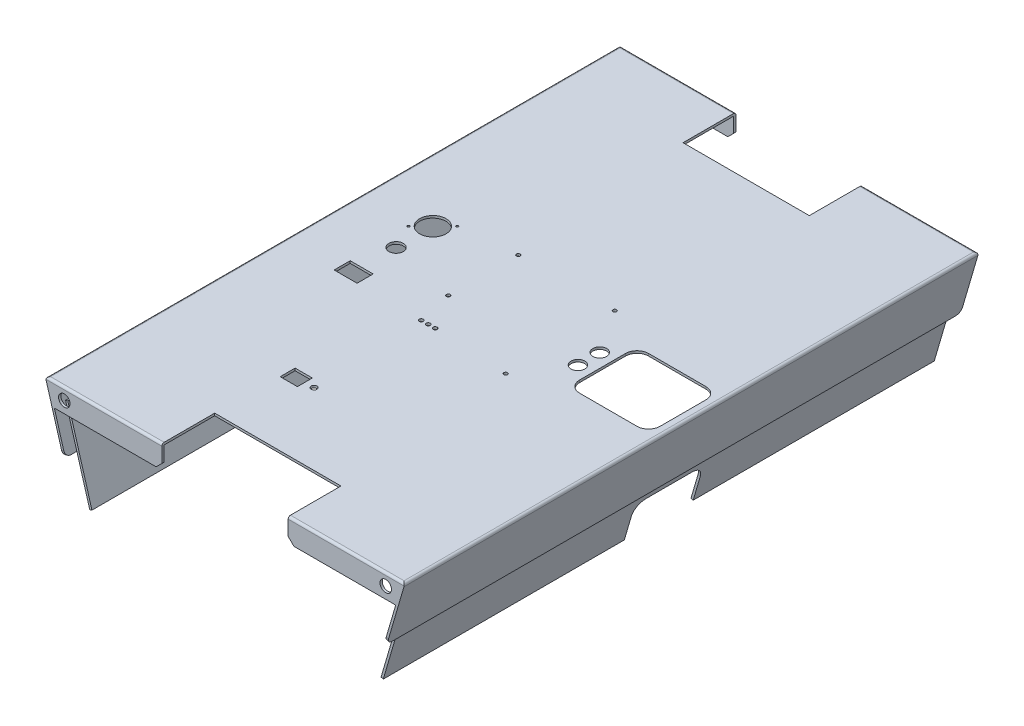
ISO-10303-21;
HEADER;
FILE_DESCRIPTION(('STEP AP214'),'2;1');
FILE_NAME('part.step','',(''),(''),'','','');
FILE_SCHEMA(('AUTOMOTIVE_DESIGN { 1 0 10303 214 1 1 1 1 }'));
ENDSEC;
DATA;
#1=APPLICATION_CONTEXT('core data for automotive mechanical design processes');
#2=APPLICATION_PROTOCOL_DEFINITION('international standard','automotive_design',2000,#1);
#3=PRODUCT_CONTEXT('',#1,'mechanical');
#4=PRODUCT('Part','Part','',(#3));
#5=PRODUCT_RELATED_PRODUCT_CATEGORY('part','',(#4));
#6=PRODUCT_DEFINITION_FORMATION('','',#4);
#7=PRODUCT_DEFINITION_CONTEXT('part definition',#1,'design');
#8=PRODUCT_DEFINITION('design','',#6,#7);
#9=PRODUCT_DEFINITION_SHAPE('','',#8);
#10=(LENGTH_UNIT() NAMED_UNIT(*) SI_UNIT(.MILLI.,.METRE.));
#11=(NAMED_UNIT(*) PLANE_ANGLE_UNIT() SI_UNIT($,.RADIAN.));
#12=(NAMED_UNIT(*) SI_UNIT($,.STERADIAN.) SOLID_ANGLE_UNIT());
#13=UNCERTAINTY_MEASURE_WITH_UNIT(LENGTH_MEASURE(1.E-05),#10,'distance_accuracy_value','');
#14=(GEOMETRIC_REPRESENTATION_CONTEXT(3) GLOBAL_UNCERTAINTY_ASSIGNED_CONTEXT((#13)) GLOBAL_UNIT_ASSIGNED_CONTEXT((#10,
#11,#12)) REPRESENTATION_CONTEXT('',''));
#15=CARTESIAN_POINT('',(0.,0.,0.));
#16=DIRECTION('',(0.,0.,1.));
#17=DIRECTION('',(1.,0.,0.));
#18=AXIS2_PLACEMENT_3D('',#15,#16,#17);
#19=CARTESIAN_POINT('',(153.951793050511,-1.99999999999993,500.));
#20=DIRECTION('',(0.,1.,0.));
#21=DIRECTION('',(0.,0.,1.));
#22=AXIS2_PLACEMENT_3D('',#19,#20,#21);
#23=PLANE('',#22);
#24=CARTESIAN_POINT('',(-35.,-2.,294.));
#25=DIRECTION('',(0.,1.,0.));
#26=DIRECTION('',(0.,0.,1.));
#27=AXIS2_PLACEMENT_3D('',#24,#25,#26);
#28=CIRCLE('',#27,1.75);
#29=CARTESIAN_POINT('',(-35.,-2.,295.75));
#30=VERTEX_POINT('',#29);
#31=EDGE_CURVE('E2264',#30,#30,#28,.T.);
#32=ORIENTED_EDGE('',*,*,#31,.T.);
#33=EDGE_LOOP('',(#32));
#34=FACE_BOUND('',#33,.T.);
#35=CARTESIAN_POINT('',(-29.,-2.,294.));
#36=DIRECTION('',(0.,1.,0.));
#37=DIRECTION('',(0.,0.,1.));
#38=AXIS2_PLACEMENT_3D('',#35,#36,#37);
#39=CIRCLE('',#38,1.75);
#40=CARTESIAN_POINT('',(-29.,-2.,295.75));
#41=VERTEX_POINT('',#40);
#42=EDGE_CURVE('E2274',#41,#41,#39,.T.);
#43=ORIENTED_EDGE('',*,*,#42,.T.);
#44=EDGE_LOOP('',(#43));
#45=FACE_BOUND('',#44,.T.);
#46=CARTESIAN_POINT('',(-23.,-2.,294.));
#47=DIRECTION('',(0.,1.,0.));
#48=DIRECTION('',(0.,0.,1.));
#49=AXIS2_PLACEMENT_3D('',#46,#47,#48);
#50=CIRCLE('',#49,1.75);
#51=CARTESIAN_POINT('',(-23.,-2.,295.75));
#52=VERTEX_POINT('',#51);
#53=EDGE_CURVE('E2280',#52,#52,#50,.T.);
#54=ORIENTED_EDGE('',*,*,#53,.T.);
#55=EDGE_LOOP('',(#54));
#56=FACE_BOUND('',#55,.T.);
#57=CARTESIAN_POINT('',(-42.,-2.,263.5));
#58=DIRECTION('',(0.,1.,0.));
#59=DIRECTION('',(0.,0.,1.));
#60=AXIS2_PLACEMENT_3D('',#57,#58,#59);
#61=CIRCLE('',#60,1.6);
#62=CARTESIAN_POINT('',(-42.,-2.,265.1));
#63=VERTEX_POINT('',#62);
#64=EDGE_CURVE('E2286',#63,#63,#61,.T.);
#65=ORIENTED_EDGE('',*,*,#64,.T.);
#66=EDGE_LOOP('',(#65));
#67=FACE_BOUND('',#66,.T.);
#68=CARTESIAN_POINT('',(-42.,-2.,202.5));
#69=DIRECTION('',(0.,1.,0.));
#70=DIRECTION('',(0.,0.,1.));
#71=AXIS2_PLACEMENT_3D('',#68,#69,#70);
#72=CIRCLE('',#71,1.6);
#73=CARTESIAN_POINT('',(-42.,-2.,204.1));
#74=VERTEX_POINT('',#73);
#75=EDGE_CURVE('E2292',#74,#74,#72,.T.);
#76=ORIENTED_EDGE('',*,*,#75,.T.);
#77=EDGE_LOOP('',(#76));
#78=FACE_BOUND('',#77,.T.);
#79=CARTESIAN_POINT('',(42.,-2.,297.5));
#80=DIRECTION('',(0.,1.,0.));
#81=DIRECTION('',(0.,0.,1.));
#82=AXIS2_PLACEMENT_3D('',#79,#80,#81);
#83=CIRCLE('',#82,1.6);
#84=CARTESIAN_POINT('',(42.,-2.,299.1));
#85=VERTEX_POINT('',#84);
#86=EDGE_CURVE('E2298',#85,#85,#83,.T.);
#87=ORIENTED_EDGE('',*,*,#86,.T.);
#88=EDGE_LOOP('',(#87));
#89=FACE_BOUND('',#88,.T.);
#90=CARTESIAN_POINT('',(42.,-2.,202.5));
#91=DIRECTION('',(0.,1.,0.));
#92=DIRECTION('',(0.,0.,1.));
#93=AXIS2_PLACEMENT_3D('',#90,#91,#92);
#94=CIRCLE('',#93,1.6);
#95=CARTESIAN_POINT('',(42.,-2.,204.1));
#96=VERTEX_POINT('',#95);
#97=EDGE_CURVE('E2304',#96,#96,#94,.T.);
#98=ORIENTED_EDGE('',*,*,#97,.T.);
#99=EDGE_LOOP('',(#98));
#100=FACE_BOUND('',#99,.T.);
#101=CARTESIAN_POINT('',(-30.9517930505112,-2.,391.5));
#102=DIRECTION('',(0.,1.,0.));
#103=DIRECTION('',(0.,0.,1.));
#104=AXIS2_PLACEMENT_3D('',#101,#102,#103);
#105=CIRCLE('',#104,2.5);
#106=CARTESIAN_POINT('',(-30.9517930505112,-2.,394.));
#107=VERTEX_POINT('',#106);
#108=EDGE_CURVE('E2310',#107,#107,#105,.T.);
#109=ORIENTED_EDGE('',*,*,#108,.T.);
#110=EDGE_LOOP('',(#109));
#111=FACE_BOUND('',#110,.T.);
#112=DIRECTION('',(1.,0.,0.));
#113=VECTOR('',#112,1.);
#114=CARTESIAN_POINT('',(-38.9517930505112,-2.,398.));
#115=LINE('',#114,#113);
#116=CARTESIAN_POINT('',(-53.9517930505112,-2.,398.));
#117=VERTEX_POINT('',#116);
#118=CARTESIAN_POINT('',(-38.9517930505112,-2.,398.));
#119=VERTEX_POINT('',#118);
#120=EDGE_CURVE('E538',#117,#119,#115,.T.);
#121=ORIENTED_EDGE('',*,*,#120,.T.);
#122=DIRECTION('',(0.,0.,-1.));
#123=VECTOR('',#122,1.);
#124=CARTESIAN_POINT('',(-38.9517930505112,-2.,385.));
#125=LINE('',#124,#123);
#126=CARTESIAN_POINT('',(-38.9517930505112,-2.,385.));
#127=VERTEX_POINT('',#126);
#128=EDGE_CURVE('E529',#119,#127,#125,.T.);
#129=ORIENTED_EDGE('',*,*,#128,.T.);
#130=DIRECTION('',(-1.,0.,0.));
#131=VECTOR('',#130,1.);
#132=CARTESIAN_POINT('',(-38.9517930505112,-2.,385.));
#133=LINE('',#132,#131);
#134=CARTESIAN_POINT('',(-53.9517930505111,-1.99999999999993,385.));
#135=VERTEX_POINT('',#134);
#136=EDGE_CURVE('E535',#127,#135,#133,.T.);
#137=ORIENTED_EDGE('',*,*,#136,.T.);
#138=DIRECTION('',(0.,0.,1.));
#139=VECTOR('',#138,1.);
#140=CARTESIAN_POINT('',(-53.9517930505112,-2.,385.));
#141=LINE('',#140,#139);
#142=EDGE_CURVE('E52',#135,#117,#141,.T.);
#143=ORIENTED_EDGE('',*,*,#142,.T.);
#144=EDGE_LOOP('',(#121,#129,#137,#143));
#145=FACE_BOUND('',#144,.T.);
#146=CARTESIAN_POINT('',(66.9517930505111,-2.,259.5));
#147=DIRECTION('',(0.,1.,0.));
#148=DIRECTION('',(0.,0.,1.));
#149=AXIS2_PLACEMENT_3D('',#146,#147,#148);
#150=CIRCLE('',#149,6.00000000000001);
#151=CARTESIAN_POINT('',(66.9517930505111,-2.,265.5));
#152=VERTEX_POINT('',#151);
#153=EDGE_CURVE('E548',#152,#152,#150,.T.);
#154=ORIENTED_EDGE('',*,*,#153,.T.);
#155=EDGE_LOOP('',(#154));
#156=FACE_BOUND('',#155,.T.);
#157=CARTESIAN_POINT('',(66.9517930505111,-2.,240.5));
#158=DIRECTION('',(0.,1.,0.));
#159=DIRECTION('',(0.,0.,1.));
#160=AXIS2_PLACEMENT_3D('',#157,#158,#159);
#161=CIRCLE('',#160,6.00000000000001);
#162=CARTESIAN_POINT('',(66.9517930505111,-2.,246.5));
#163=VERTEX_POINT('',#162);
#164=EDGE_CURVE('E554',#163,#163,#161,.T.);
#165=ORIENTED_EDGE('',*,*,#164,.T.);
#166=EDGE_LOOP('',(#165));
#167=FACE_BOUND('',#166,.T.);
#168=CARTESIAN_POINT('',(-90.345191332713,-2.,207.393398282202));
#169=DIRECTION('',(0.,1.,0.));
#170=DIRECTION('',(0.,0.,1.));
#171=AXIS2_PLACEMENT_3D('',#168,#169,#170);
#172=CIRCLE('',#171,1.00000000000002);
#173=CARTESIAN_POINT('',(-90.345191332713,-2.,208.393398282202));
#174=VERTEX_POINT('',#173);
#175=EDGE_CURVE('E560',#174,#174,#172,.T.);
#176=ORIENTED_EDGE('',*,*,#175,.T.);
#177=EDGE_LOOP('',(#176));
#178=FACE_BOUND('',#177,.T.);
#179=CARTESIAN_POINT('',(-111.558394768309,-2.,228.606601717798));
#180=DIRECTION('',(0.,1.,0.));
#181=DIRECTION('',(0.,0.,1.));
#182=AXIS2_PLACEMENT_3D('',#179,#180,#181);
#183=CIRCLE('',#182,1.00000000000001);
#184=CARTESIAN_POINT('',(-111.558394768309,-2.,229.606601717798));
#185=VERTEX_POINT('',#184);
#186=EDGE_CURVE('E566',#185,#185,#183,.T.);
#187=ORIENTED_EDGE('',*,*,#186,.T.);
#188=EDGE_LOOP('',(#187));
#189=FACE_BOUND('',#188,.T.);
#190=CARTESIAN_POINT('',(-100.951793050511,-2.,218.));
#191=DIRECTION('',(0.,1.,0.));
#192=DIRECTION('',(0.,0.,1.));
#193=AXIS2_PLACEMENT_3D('',#190,#191,#192);
#194=CIRCLE('',#193,11.5);
#195=CARTESIAN_POINT('',(-100.951793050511,-2.,229.5));
#196=VERTEX_POINT('',#195);
#197=EDGE_CURVE('E572',#196,#196,#194,.T.);
#198=ORIENTED_EDGE('',*,*,#197,.T.);
#199=EDGE_LOOP('',(#198));
#200=FACE_BOUND('',#199,.T.);
#201=DIRECTION('',(1.,0.,0.));
#202=VECTOR('',#201,1.);
#203=CARTESIAN_POINT('',(-90.9517930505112,-2.,294.));
#204=LINE('',#203,#202);
#205=CARTESIAN_POINT('',(-110.951793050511,-2.,294.));
#206=VERTEX_POINT('',#205);
#207=CARTESIAN_POINT('',(-90.9517930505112,-2.,294.));
#208=VERTEX_POINT('',#207);
#209=EDGE_CURVE('E595',#206,#208,#204,.T.);
#210=ORIENTED_EDGE('',*,*,#209,.T.);
#211=DIRECTION('',(0.,0.,-1.));
#212=VECTOR('',#211,1.);
#213=CARTESIAN_POINT('',(-90.9517930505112,-2.,280.));
#214=LINE('',#213,#212);
#215=CARTESIAN_POINT('',(-90.9517930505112,-2.,280.));
#216=VERTEX_POINT('',#215);
#217=EDGE_CURVE('E586',#208,#216,#214,.T.);
#218=ORIENTED_EDGE('',*,*,#217,.T.);
#219=DIRECTION('',(-1.,0.,0.));
#220=VECTOR('',#219,1.);
#221=CARTESIAN_POINT('',(-90.9517930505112,-2.,280.));
#222=LINE('',#221,#220);
#223=CARTESIAN_POINT('',(-110.951793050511,-1.99999999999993,280.));
#224=VERTEX_POINT('',#223);
#225=EDGE_CURVE('E589',#216,#224,#222,.T.);
#226=ORIENTED_EDGE('',*,*,#225,.T.);
#227=DIRECTION('',(0.,0.,1.));
#228=VECTOR('',#227,1.);
#229=CARTESIAN_POINT('',(-110.951793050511,-2.,280.));
#230=LINE('',#229,#228);
#231=EDGE_CURVE('E592',#224,#206,#230,.T.);
#232=ORIENTED_EDGE('',*,*,#231,.T.);
#233=EDGE_LOOP('',(#210,#218,#226,#232));
#234=FACE_BOUND('',#233,.T.);
#235=CARTESIAN_POINT('',(-100.951793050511,-2.,250.));
#236=DIRECTION('',(0.,1.,0.));
#237=DIRECTION('',(0.,0.,1.));
#238=AXIS2_PLACEMENT_3D('',#235,#236,#237);
#239=CIRCLE('',#238,6.25);
#240=CARTESIAN_POINT('',(-100.951793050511,-2.,256.25));
#241=VERTEX_POINT('',#240);
#242=EDGE_CURVE('E610',#241,#241,#239,.T.);
#243=ORIENTED_EDGE('',*,*,#242,.T.);
#244=EDGE_LOOP('',(#243));
#245=FACE_BOUND('',#244,.T.);
#246=DIRECTION('',(0.,0.,-1.));
#247=VECTOR('',#246,1.);
#248=CARTESIAN_POINT('',(148.951793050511,-2.,230.));
#249=LINE('',#248,#247);
#250=CARTESIAN_POINT('',(148.951793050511,-2.,270.));
#251=VERTEX_POINT('',#250);
#252=CARTESIAN_POINT('',(148.951793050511,-2.,230.));
#253=VERTEX_POINT('',#252);
#254=EDGE_CURVE('E773',#251,#253,#249,.T.);
#255=ORIENTED_EDGE('',*,*,#254,.T.);
#256=CARTESIAN_POINT('',(138.951793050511,-2.,230.));
#257=DIRECTION('',(0.,1.,0.));
#258=DIRECTION('',(0.,0.,-1.));
#259=AXIS2_PLACEMENT_3D('',#256,#257,#258);
#260=CIRCLE('',#259,10.);
#261=CARTESIAN_POINT('',(138.951793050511,-2.,220.));
#262=VERTEX_POINT('',#261);
#263=EDGE_CURVE('E752',#253,#262,#260,.T.);
#264=ORIENTED_EDGE('',*,*,#263,.T.);
#265=DIRECTION('',(-1.,0.,0.));
#266=VECTOR('',#265,1.);
#267=CARTESIAN_POINT('',(138.951793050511,-2.,220.));
#268=LINE('',#267,#266);
#269=CARTESIAN_POINT('',(88.9517930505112,-1.99999999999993,220.));
#270=VERTEX_POINT('',#269);
#271=EDGE_CURVE('E755',#262,#270,#268,.T.);
#272=ORIENTED_EDGE('',*,*,#271,.T.);
#273=CARTESIAN_POINT('',(88.9517930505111,-2.,230.));
#274=DIRECTION('',(0.,1.,0.));
#275=DIRECTION('',(0.,0.,1.));
#276=AXIS2_PLACEMENT_3D('',#273,#274,#275);
#277=CIRCLE('',#276,10.);
#278=CARTESIAN_POINT('',(78.9517930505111,-2.,230.));
#279=VERTEX_POINT('',#278);
#280=EDGE_CURVE('E758',#270,#279,#277,.T.);
#281=ORIENTED_EDGE('',*,*,#280,.T.);
#282=DIRECTION('',(0.,0.,1.));
#283=VECTOR('',#282,1.);
#284=CARTESIAN_POINT('',(78.9517930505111,-2.,230.));
#285=LINE('',#284,#283);
#286=CARTESIAN_POINT('',(78.9517930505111,-2.,270.));
#287=VERTEX_POINT('',#286);
#288=EDGE_CURVE('E761',#279,#287,#285,.T.);
#289=ORIENTED_EDGE('',*,*,#288,.T.);
#290=CARTESIAN_POINT('',(88.9517930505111,-2.,270.));
#291=DIRECTION('',(0.,1.,0.));
#292=DIRECTION('',(0.,0.,-1.));
#293=AXIS2_PLACEMENT_3D('',#290,#291,#292);
#294=CIRCLE('',#293,10.);
#295=CARTESIAN_POINT('',(88.9517930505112,-2.,280.));
#296=VERTEX_POINT('',#295);
#297=EDGE_CURVE('E764',#287,#296,#294,.T.);
#298=ORIENTED_EDGE('',*,*,#297,.T.);
#299=DIRECTION('',(1.,0.,0.));
#300=VECTOR('',#299,1.);
#301=CARTESIAN_POINT('',(138.951793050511,-2.,280.));
#302=LINE('',#301,#300);
#303=CARTESIAN_POINT('',(138.951793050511,-2.,280.));
#304=VERTEX_POINT('',#303);
#305=EDGE_CURVE('E767',#296,#304,#302,.T.);
#306=ORIENTED_EDGE('',*,*,#305,.T.);
#307=CARTESIAN_POINT('',(138.951793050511,-2.,270.));
#308=DIRECTION('',(0.,1.,0.));
#309=DIRECTION('',(0.,0.,-1.));
#310=AXIS2_PLACEMENT_3D('',#307,#308,#309);
#311=CIRCLE('',#310,10.);
#312=EDGE_CURVE('E770',#304,#251,#311,.T.);
#313=ORIENTED_EDGE('',*,*,#312,.T.);
#314=EDGE_LOOP('',(#255,#264,#272,#281,#289,#298,#306,#313));
#315=FACE_BOUND('',#314,.T.);
#316=DIRECTION('',(0.,0.,1.));
#317=VECTOR('',#316,1.);
#318=CARTESIAN_POINT('',(55.,-1.99999999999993,500.));
#319=LINE('',#318,#317);
#320=CARTESIAN_POINT('',(55.,-1.99999999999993,454.));
#321=VERTEX_POINT('',#320);
#322=CARTESIAN_POINT('',(55.,-1.99999999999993,498.));
#323=VERTEX_POINT('',#322);
#324=EDGE_CURVE('E653',#321,#323,#319,.T.);
#325=ORIENTED_EDGE('',*,*,#324,.F.);
#326=DIRECTION('',(1.,0.,0.));
#327=VECTOR('',#326,1.);
#328=CARTESIAN_POINT('',(153.951793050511,-1.99999999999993,454.));
#329=LINE('',#328,#327);
#330=CARTESIAN_POINT('',(-55.,-1.99999999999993,454.));
#331=VERTEX_POINT('',#330);
#332=EDGE_CURVE('E655',#331,#321,#329,.T.);
#333=ORIENTED_EDGE('',*,*,#332,.F.);
#334=DIRECTION('',(0.,0.,-1.));
#335=VECTOR('',#334,1.);
#336=CARTESIAN_POINT('',(-55.,-1.99999999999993,500.));
#337=LINE('',#336,#335);
#338=CARTESIAN_POINT('',(-55.,-1.99999999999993,498.));
#339=VERTEX_POINT('',#338);
#340=EDGE_CURVE('E644',#339,#331,#337,.T.);
#341=ORIENTED_EDGE('',*,*,#340,.F.);
#342=DIRECTION('',(1.,0.,0.));
#343=VECTOR('',#342,1.);
#344=CARTESIAN_POINT('',(-153.951793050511,-1.99999999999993,498.));
#345=LINE('',#344,#343);
#346=CARTESIAN_POINT('',(-153.951793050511,-1.99999999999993,498.));
#347=VERTEX_POINT('',#346);
#348=EDGE_CURVE('E670',#347,#339,#345,.T.);
#349=ORIENTED_EDGE('',*,*,#348,.F.);
#350=DIRECTION('',(0.,0.,-1.));
#351=VECTOR('',#350,1.);
#352=CARTESIAN_POINT('',(-153.951793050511,-1.99999999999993,500.));
#353=LINE('',#352,#351);
#354=CARTESIAN_POINT('',(-153.951793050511,-1.99999999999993,2.));
#355=VERTEX_POINT('',#354);
#356=EDGE_CURVE('E993',#347,#355,#353,.T.);
#357=ORIENTED_EDGE('',*,*,#356,.T.);
#358=DIRECTION('',(1.,0.,0.));
#359=VECTOR('',#358,1.);
#360=CARTESIAN_POINT('',(-153.951793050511,-1.99999999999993,2.));
#361=LINE('',#360,#359);
#362=CARTESIAN_POINT('',(-55.,-1.99999999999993,2.));
#363=VERTEX_POINT('',#362);
#364=EDGE_CURVE('E715',#355,#363,#361,.T.);
#365=ORIENTED_EDGE('',*,*,#364,.T.);
#366=DIRECTION('',(0.,0.,1.));
#367=VECTOR('',#366,1.);
#368=CARTESIAN_POINT('',(-55.0000000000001,-1.99999999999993,500.));
#369=LINE('',#368,#367);
#370=CARTESIAN_POINT('',(-55.,-1.99999999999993,46.));
#371=VERTEX_POINT('',#370);
#372=EDGE_CURVE('E690',#363,#371,#369,.T.);
#373=ORIENTED_EDGE('',*,*,#372,.T.);
#374=DIRECTION('',(1.,0.,0.));
#375=VECTOR('',#374,1.);
#376=CARTESIAN_POINT('',(153.951793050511,-1.99999999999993,46.));
#377=LINE('',#376,#375);
#378=CARTESIAN_POINT('',(55.,-1.99999999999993,46.));
#379=VERTEX_POINT('',#378);
#380=EDGE_CURVE('E704',#371,#379,#377,.T.);
#381=ORIENTED_EDGE('',*,*,#380,.T.);
#382=DIRECTION('',(0.,0.,-1.));
#383=VECTOR('',#382,1.);
#384=CARTESIAN_POINT('',(55.,-1.99999999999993,500.));
#385=LINE('',#384,#383);
#386=CARTESIAN_POINT('',(55.,-1.99999999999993,2.));
#387=VERTEX_POINT('',#386);
#388=EDGE_CURVE('E701',#379,#387,#385,.T.);
#389=ORIENTED_EDGE('',*,*,#388,.T.);
#390=CARTESIAN_POINT('',(153.951793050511,-1.99999999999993,1.99999999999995));
#391=VERTEX_POINT('',#390);
#392=EDGE_CURVE('E714',#387,#391,#361,.T.);
#393=ORIENTED_EDGE('',*,*,#392,.T.);
#394=DIRECTION('',(0.,0.,-1.));
#395=VECTOR('',#394,1.);
#396=CARTESIAN_POINT('',(153.951793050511,-1.99999999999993,500.));
#397=LINE('',#396,#395);
#398=CARTESIAN_POINT('',(153.951793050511,-1.99999999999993,498.));
#399=VERTEX_POINT('',#398);
#400=EDGE_CURVE('E990',#399,#391,#397,.T.);
#401=ORIENTED_EDGE('',*,*,#400,.F.);
#402=EDGE_CURVE('E669',#323,#399,#345,.T.);
#403=ORIENTED_EDGE('',*,*,#402,.F.);
#404=EDGE_LOOP('',(#325,#333,#341,#349,#357,#365,#373,#381,#389,#393,#401,#403));
#405=FACE_BOUND('',#404,.T.);
#406=ADVANCED_FACE('F35',(#34,#45,#56,#67,#78,#89,#100,#111,#145,#156,#167,#178,#189,#200,#234,
#245,#315,#405),#23,.F.);
#407=CARTESIAN_POINT('',(-153.951793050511,0.,500.));
#408=DIRECTION('',(0.,-1.,0.));
#409=DIRECTION('',(0.,0.,-1.));
#410=AXIS2_PLACEMENT_3D('',#407,#408,#409);
#411=PLANE('',#410);
#412=CARTESIAN_POINT('',(-35.,0.,294.));
#413=DIRECTION('',(0.,1.,0.));
#414=DIRECTION('',(0.,0.,1.));
#415=AXIS2_PLACEMENT_3D('',#412,#413,#414);
#416=CIRCLE('',#415,1.75);
#417=CARTESIAN_POINT('',(-35.,0.,295.75));
#418=VERTEX_POINT('',#417);
#419=EDGE_CURVE('E2267',#418,#418,#416,.T.);
#420=ORIENTED_EDGE('',*,*,#419,.F.);
#421=EDGE_LOOP('',(#420));
#422=FACE_BOUND('',#421,.T.);
#423=CARTESIAN_POINT('',(-29.,0.,294.));
#424=DIRECTION('',(0.,1.,0.));
#425=DIRECTION('',(0.,0.,1.));
#426=AXIS2_PLACEMENT_3D('',#423,#424,#425);
#427=CIRCLE('',#426,1.75);
#428=CARTESIAN_POINT('',(-29.,0.,295.75));
#429=VERTEX_POINT('',#428);
#430=EDGE_CURVE('E2269',#429,#429,#427,.T.);
#431=ORIENTED_EDGE('',*,*,#430,.F.);
#432=EDGE_LOOP('',(#431));
#433=FACE_BOUND('',#432,.T.);
#434=CARTESIAN_POINT('',(-23.,0.,294.));
#435=DIRECTION('',(0.,1.,0.));
#436=DIRECTION('',(0.,0.,1.));
#437=AXIS2_PLACEMENT_3D('',#434,#435,#436);
#438=CIRCLE('',#437,1.75);
#439=CARTESIAN_POINT('',(-23.,0.,295.75));
#440=VERTEX_POINT('',#439);
#441=EDGE_CURVE('E2277',#440,#440,#438,.T.);
#442=ORIENTED_EDGE('',*,*,#441,.F.);
#443=EDGE_LOOP('',(#442));
#444=FACE_BOUND('',#443,.T.);
#445=CARTESIAN_POINT('',(-42.,0.,263.5));
#446=DIRECTION('',(0.,1.,0.));
#447=DIRECTION('',(0.,0.,1.));
#448=AXIS2_PLACEMENT_3D('',#445,#446,#447);
#449=CIRCLE('',#448,1.6);
#450=CARTESIAN_POINT('',(-42.,0.,265.1));
#451=VERTEX_POINT('',#450);
#452=EDGE_CURVE('E2283',#451,#451,#449,.T.);
#453=ORIENTED_EDGE('',*,*,#452,.F.);
#454=EDGE_LOOP('',(#453));
#455=FACE_BOUND('',#454,.T.);
#456=CARTESIAN_POINT('',(-42.,0.,202.5));
#457=DIRECTION('',(0.,1.,0.));
#458=DIRECTION('',(0.,0.,1.));
#459=AXIS2_PLACEMENT_3D('',#456,#457,#458);
#460=CIRCLE('',#459,1.6);
#461=CARTESIAN_POINT('',(-42.,0.,204.1));
#462=VERTEX_POINT('',#461);
#463=EDGE_CURVE('E2289',#462,#462,#460,.T.);
#464=ORIENTED_EDGE('',*,*,#463,.F.);
#465=EDGE_LOOP('',(#464));
#466=FACE_BOUND('',#465,.T.);
#467=CARTESIAN_POINT('',(42.,0.,297.5));
#468=DIRECTION('',(0.,1.,0.));
#469=DIRECTION('',(0.,0.,1.));
#470=AXIS2_PLACEMENT_3D('',#467,#468,#469);
#471=CIRCLE('',#470,1.6);
#472=CARTESIAN_POINT('',(42.,0.,299.1));
#473=VERTEX_POINT('',#472);
#474=EDGE_CURVE('E2295',#473,#473,#471,.T.);
#475=ORIENTED_EDGE('',*,*,#474,.F.);
#476=EDGE_LOOP('',(#475));
#477=FACE_BOUND('',#476,.T.);
#478=CARTESIAN_POINT('',(42.,0.,202.5));
#479=DIRECTION('',(0.,1.,0.));
#480=DIRECTION('',(0.,0.,1.));
#481=AXIS2_PLACEMENT_3D('',#478,#479,#480);
#482=CIRCLE('',#481,1.6);
#483=CARTESIAN_POINT('',(42.,0.,204.1));
#484=VERTEX_POINT('',#483);
#485=EDGE_CURVE('E2301',#484,#484,#482,.T.);
#486=ORIENTED_EDGE('',*,*,#485,.F.);
#487=EDGE_LOOP('',(#486));
#488=FACE_BOUND('',#487,.T.);
#489=CARTESIAN_POINT('',(-30.9517930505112,0.,391.5));
#490=DIRECTION('',(0.,1.,0.));
#491=DIRECTION('',(0.,0.,1.));
#492=AXIS2_PLACEMENT_3D('',#489,#490,#491);
#493=CIRCLE('',#492,2.5);
#494=CARTESIAN_POINT('',(-30.9517930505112,0.,394.));
#495=VERTEX_POINT('',#494);
#496=EDGE_CURVE('E2307',#495,#495,#493,.T.);
#497=ORIENTED_EDGE('',*,*,#496,.F.);
#498=EDGE_LOOP('',(#497));
#499=FACE_BOUND('',#498,.T.);
#500=DIRECTION('',(-1.,0.,0.));
#501=VECTOR('',#500,1.);
#502=CARTESIAN_POINT('',(-38.9517930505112,0.,385.));
#503=LINE('',#502,#501);
#504=CARTESIAN_POINT('',(-38.9517930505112,0.,385.));
#505=VERTEX_POINT('',#504);
#506=CARTESIAN_POINT('',(-53.9517930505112,0.,385.));
#507=VERTEX_POINT('',#506);
#508=EDGE_CURVE('E520',#505,#507,#503,.T.);
#509=ORIENTED_EDGE('',*,*,#508,.F.);
#510=DIRECTION('',(0.,0.,-1.));
#511=VECTOR('',#510,1.);
#512=CARTESIAN_POINT('',(-38.9517930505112,0.,385.));
#513=LINE('',#512,#511);
#514=CARTESIAN_POINT('',(-38.9517930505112,0.,398.));
#515=VERTEX_POINT('',#514);
#516=EDGE_CURVE('E60',#515,#505,#513,.T.);
#517=ORIENTED_EDGE('',*,*,#516,.F.);
#518=DIRECTION('',(1.,0.,0.));
#519=VECTOR('',#518,1.);
#520=CARTESIAN_POINT('',(-38.9517930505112,0.,398.));
#521=LINE('',#520,#519);
#522=CARTESIAN_POINT('',(-53.9517930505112,0.,398.));
#523=VERTEX_POINT('',#522);
#524=EDGE_CURVE('E527',#523,#515,#521,.T.);
#525=ORIENTED_EDGE('',*,*,#524,.F.);
#526=DIRECTION('',(0.,0.,1.));
#527=VECTOR('',#526,1.);
#528=CARTESIAN_POINT('',(-53.9517930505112,0.,385.));
#529=LINE('',#528,#527);
#530=EDGE_CURVE('E511',#507,#523,#529,.T.);
#531=ORIENTED_EDGE('',*,*,#530,.F.);
#532=EDGE_LOOP('',(#509,#517,#525,#531));
#533=FACE_BOUND('',#532,.T.);
#534=CARTESIAN_POINT('',(66.9517930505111,0.,259.5));
#535=DIRECTION('',(0.,1.,0.));
#536=DIRECTION('',(0.,0.,1.));
#537=AXIS2_PLACEMENT_3D('',#534,#535,#536);
#538=CIRCLE('',#537,6.00000000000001);
#539=CARTESIAN_POINT('',(66.9517930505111,0.,265.5));
#540=VERTEX_POINT('',#539);
#541=EDGE_CURVE('E543',#540,#540,#538,.T.);
#542=ORIENTED_EDGE('',*,*,#541,.F.);
#543=EDGE_LOOP('',(#542));
#544=FACE_BOUND('',#543,.T.);
#545=CARTESIAN_POINT('',(66.9517930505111,0.,240.5));
#546=DIRECTION('',(0.,1.,0.));
#547=DIRECTION('',(0.,0.,1.));
#548=AXIS2_PLACEMENT_3D('',#545,#546,#547);
#549=CIRCLE('',#548,6.00000000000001);
#550=CARTESIAN_POINT('',(66.9517930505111,0.,246.5));
#551=VERTEX_POINT('',#550);
#552=EDGE_CURVE('E551',#551,#551,#549,.T.);
#553=ORIENTED_EDGE('',*,*,#552,.F.);
#554=EDGE_LOOP('',(#553));
#555=FACE_BOUND('',#554,.T.);
#556=CARTESIAN_POINT('',(-90.345191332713,0.,207.393398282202));
#557=DIRECTION('',(0.,1.,0.));
#558=DIRECTION('',(0.,0.,1.));
#559=AXIS2_PLACEMENT_3D('',#556,#557,#558);
#560=CIRCLE('',#559,1.00000000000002);
#561=CARTESIAN_POINT('',(-90.345191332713,0.,208.393398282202));
#562=VERTEX_POINT('',#561);
#563=EDGE_CURVE('E557',#562,#562,#560,.T.);
#564=ORIENTED_EDGE('',*,*,#563,.F.);
#565=EDGE_LOOP('',(#564));
#566=FACE_BOUND('',#565,.T.);
#567=CARTESIAN_POINT('',(-111.558394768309,0.,228.606601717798));
#568=DIRECTION('',(0.,1.,0.));
#569=DIRECTION('',(0.,0.,1.));
#570=AXIS2_PLACEMENT_3D('',#567,#568,#569);
#571=CIRCLE('',#570,1.00000000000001);
#572=CARTESIAN_POINT('',(-111.558394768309,0.,229.606601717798));
#573=VERTEX_POINT('',#572);
#574=EDGE_CURVE('E563',#573,#573,#571,.T.);
#575=ORIENTED_EDGE('',*,*,#574,.F.);
#576=EDGE_LOOP('',(#575));
#577=FACE_BOUND('',#576,.T.);
#578=CARTESIAN_POINT('',(-100.951793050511,0.,218.));
#579=DIRECTION('',(0.,1.,0.));
#580=DIRECTION('',(0.,0.,1.));
#581=AXIS2_PLACEMENT_3D('',#578,#579,#580);
#582=CIRCLE('',#581,11.5);
#583=CARTESIAN_POINT('',(-100.951793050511,0.,229.5));
#584=VERTEX_POINT('',#583);
#585=EDGE_CURVE('E569',#584,#584,#582,.T.);
#586=ORIENTED_EDGE('',*,*,#585,.F.);
#587=EDGE_LOOP('',(#586));
#588=FACE_BOUND('',#587,.T.);
#589=DIRECTION('',(-1.,0.,0.));
#590=VECTOR('',#589,1.);
#591=CARTESIAN_POINT('',(-90.9517930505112,0.,280.));
#592=LINE('',#591,#590);
#593=CARTESIAN_POINT('',(-90.9517930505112,0.,280.));
#594=VERTEX_POINT('',#593);
#595=CARTESIAN_POINT('',(-110.951793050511,0.,280.));
#596=VERTEX_POINT('',#595);
#597=EDGE_CURVE('E577',#594,#596,#592,.T.);
#598=ORIENTED_EDGE('',*,*,#597,.F.);
#599=DIRECTION('',(0.,0.,-1.));
#600=VECTOR('',#599,1.);
#601=CARTESIAN_POINT('',(-90.9517930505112,0.,280.));
#602=LINE('',#601,#600);
#603=CARTESIAN_POINT('',(-90.9517930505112,0.,294.));
#604=VERTEX_POINT('',#603);
#605=EDGE_CURVE('E575',#604,#594,#602,.T.);
#606=ORIENTED_EDGE('',*,*,#605,.F.);
#607=DIRECTION('',(1.,0.,0.));
#608=VECTOR('',#607,1.);
#609=CARTESIAN_POINT('',(-90.9517930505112,0.,294.));
#610=LINE('',#609,#608);
#611=CARTESIAN_POINT('',(-110.951793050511,0.,294.));
#612=VERTEX_POINT('',#611);
#613=EDGE_CURVE('E583',#612,#604,#610,.T.);
#614=ORIENTED_EDGE('',*,*,#613,.F.);
#615=DIRECTION('',(0.,0.,1.));
#616=VECTOR('',#615,1.);
#617=CARTESIAN_POINT('',(-110.951793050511,0.,280.));
#618=LINE('',#617,#616);
#619=EDGE_CURVE('E580',#596,#612,#618,.T.);
#620=ORIENTED_EDGE('',*,*,#619,.F.);
#621=EDGE_LOOP('',(#598,#606,#614,#620));
#622=FACE_BOUND('',#621,.T.);
#623=CARTESIAN_POINT('',(-100.951793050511,0.,250.));
#624=DIRECTION('',(0.,1.,0.));
#625=DIRECTION('',(0.,0.,1.));
#626=AXIS2_PLACEMENT_3D('',#623,#624,#625);
#627=CIRCLE('',#626,6.25);
#628=CARTESIAN_POINT('',(-100.951793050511,0.,256.25));
#629=VERTEX_POINT('',#628);
#630=EDGE_CURVE('E601',#629,#629,#627,.T.);
#631=ORIENTED_EDGE('',*,*,#630,.F.);
#632=EDGE_LOOP('',(#631));
#633=FACE_BOUND('',#632,.T.);
#634=DIRECTION('',(-1.,0.,0.));
#635=VECTOR('',#634,1.);
#636=CARTESIAN_POINT('',(138.951793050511,0.,220.));
#637=LINE('',#636,#635);
#638=CARTESIAN_POINT('',(138.951793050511,0.,220.));
#639=VERTEX_POINT('',#638);
#640=CARTESIAN_POINT('',(88.9517930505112,0.,220.));
#641=VERTEX_POINT('',#640);
#642=EDGE_CURVE('E731',#639,#641,#637,.T.);
#643=ORIENTED_EDGE('',*,*,#642,.F.);
#644=CARTESIAN_POINT('',(138.951793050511,0.,230.));
#645=DIRECTION('',(0.,1.,0.));
#646=DIRECTION('',(0.,0.,-1.));
#647=AXIS2_PLACEMENT_3D('',#644,#645,#646);
#648=CIRCLE('',#647,10.);
#649=CARTESIAN_POINT('',(148.951793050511,0.,230.));
#650=VERTEX_POINT('',#649);
#651=EDGE_CURVE('E728',#650,#639,#648,.T.);
#652=ORIENTED_EDGE('',*,*,#651,.F.);
#653=DIRECTION('',(0.,0.,-1.));
#654=VECTOR('',#653,1.);
#655=CARTESIAN_POINT('',(148.951793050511,0.,230.));
#656=LINE('',#655,#654);
#657=CARTESIAN_POINT('',(148.951793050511,0.,270.));
#658=VERTEX_POINT('',#657);
#659=EDGE_CURVE('E749',#658,#650,#656,.T.);
#660=ORIENTED_EDGE('',*,*,#659,.F.);
#661=CARTESIAN_POINT('',(138.951793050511,0.,270.));
#662=DIRECTION('',(0.,1.,0.));
#663=DIRECTION('',(0.,0.,-1.));
#664=AXIS2_PLACEMENT_3D('',#661,#662,#663);
#665=CIRCLE('',#664,10.);
#666=CARTESIAN_POINT('',(138.951793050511,0.,280.));
#667=VERTEX_POINT('',#666);
#668=EDGE_CURVE('E746',#667,#658,#665,.T.);
#669=ORIENTED_EDGE('',*,*,#668,.F.);
#670=DIRECTION('',(1.,0.,0.));
#671=VECTOR('',#670,1.);
#672=CARTESIAN_POINT('',(138.951793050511,0.,280.));
#673=LINE('',#672,#671);
#674=CARTESIAN_POINT('',(88.9517930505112,0.,280.));
#675=VERTEX_POINT('',#674);
#676=EDGE_CURVE('E743',#675,#667,#673,.T.);
#677=ORIENTED_EDGE('',*,*,#676,.F.);
#678=CARTESIAN_POINT('',(88.9517930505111,0.,270.));
#679=DIRECTION('',(0.,1.,0.));
#680=DIRECTION('',(0.,0.,-1.));
#681=AXIS2_PLACEMENT_3D('',#678,#679,#680);
#682=CIRCLE('',#681,10.);
#683=CARTESIAN_POINT('',(78.9517930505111,0.,270.));
#684=VERTEX_POINT('',#683);
#685=EDGE_CURVE('E740',#684,#675,#682,.T.);
#686=ORIENTED_EDGE('',*,*,#685,.F.);
#687=DIRECTION('',(0.,0.,1.));
#688=VECTOR('',#687,1.);
#689=CARTESIAN_POINT('',(78.9517930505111,0.,230.));
#690=LINE('',#689,#688);
#691=CARTESIAN_POINT('',(78.9517930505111,0.,230.));
#692=VERTEX_POINT('',#691);
#693=EDGE_CURVE('E737',#692,#684,#690,.T.);
#694=ORIENTED_EDGE('',*,*,#693,.F.);
#695=CARTESIAN_POINT('',(88.9517930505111,0.,230.));
#696=DIRECTION('',(0.,1.,0.));
#697=DIRECTION('',(0.,0.,1.));
#698=AXIS2_PLACEMENT_3D('',#695,#696,#697);
#699=CIRCLE('',#698,10.);
#700=EDGE_CURVE('E734',#641,#692,#699,.T.);
#701=ORIENTED_EDGE('',*,*,#700,.F.);
#702=EDGE_LOOP('',(#643,#652,#660,#669,#677,#686,#694,#701));
#703=FACE_BOUND('',#702,.T.);
#704=DIRECTION('',(0.,0.,-1.));
#705=VECTOR('',#704,1.);
#706=CARTESIAN_POINT('',(-153.951793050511,0.,500.));
#707=LINE('',#706,#705);
#708=CARTESIAN_POINT('',(-153.951793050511,0.,498.));
#709=VERTEX_POINT('',#708);
#710=CARTESIAN_POINT('',(-153.951793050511,0.,2.));
#711=VERTEX_POINT('',#710);
#712=EDGE_CURVE('E1006',#709,#711,#707,.T.);
#713=ORIENTED_EDGE('',*,*,#712,.F.);
#714=DIRECTION('',(-1.,0.,0.));
#715=VECTOR('',#714,1.);
#716=CARTESIAN_POINT('',(-153.951793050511,0.,498.));
#717=LINE('',#716,#715);
#718=CARTESIAN_POINT('',(-55.,0.,498.));
#719=VERTEX_POINT('',#718);
#720=EDGE_CURVE('E1116',#709,#719,#717,.F.);
#721=ORIENTED_EDGE('',*,*,#720,.T.);
#722=DIRECTION('',(0.,0.,-1.));
#723=VECTOR('',#722,1.);
#724=CARTESIAN_POINT('',(-55.,0.,500.));
#725=LINE('',#724,#723);
#726=CARTESIAN_POINT('',(-55.,0.,454.));
#727=VERTEX_POINT('',#726);
#728=EDGE_CURVE('E638',#719,#727,#725,.T.);
#729=ORIENTED_EDGE('',*,*,#728,.T.);
#730=DIRECTION('',(1.,0.,0.));
#731=VECTOR('',#730,1.);
#732=CARTESIAN_POINT('',(55.,0.,454.));
#733=LINE('',#732,#731);
#734=CARTESIAN_POINT('',(55.,0.,454.));
#735=VERTEX_POINT('',#734);
#736=EDGE_CURVE('E635',#727,#735,#733,.T.);
#737=ORIENTED_EDGE('',*,*,#736,.T.);
#738=DIRECTION('',(0.,0.,1.));
#739=VECTOR('',#738,1.);
#740=CARTESIAN_POINT('',(55.,0.,500.));
#741=LINE('',#740,#739);
#742=CARTESIAN_POINT('',(55.,0.,498.));
#743=VERTEX_POINT('',#742);
#744=EDGE_CURVE('E632',#735,#743,#741,.T.);
#745=ORIENTED_EDGE('',*,*,#744,.T.);
#746=DIRECTION('',(-1.,0.,0.));
#747=VECTOR('',#746,1.);
#748=CARTESIAN_POINT('',(-153.951793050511,0.,498.));
#749=LINE('',#748,#747);
#750=CARTESIAN_POINT('',(153.951793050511,0.,498.));
#751=VERTEX_POINT('',#750);
#752=EDGE_CURVE('E1114',#743,#751,#749,.F.);
#753=ORIENTED_EDGE('',*,*,#752,.T.);
#754=DIRECTION('',(0.,0.,-1.));
#755=VECTOR('',#754,1.);
#756=CARTESIAN_POINT('',(153.951793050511,0.,500.));
#757=LINE('',#756,#755);
#758=CARTESIAN_POINT('',(153.951793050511,0.,2.));
#759=VERTEX_POINT('',#758);
#760=EDGE_CURVE('E1009',#751,#759,#757,.T.);
#761=ORIENTED_EDGE('',*,*,#760,.T.);
#762=DIRECTION('',(-1.,0.,0.));
#763=VECTOR('',#762,1.);
#764=CARTESIAN_POINT('',(55.,0.,2.));
#765=LINE('',#764,#763);
#766=CARTESIAN_POINT('',(55.,0.,2.));
#767=VERTEX_POINT('',#766);
#768=EDGE_CURVE('E1108',#759,#767,#765,.T.);
#769=ORIENTED_EDGE('',*,*,#768,.T.);
#770=DIRECTION('',(0.,0.,-1.));
#771=VECTOR('',#770,1.);
#772=CARTESIAN_POINT('',(55.,0.,0.));
#773=LINE('',#772,#771);
#774=CARTESIAN_POINT('',(55.,0.,46.));
#775=VERTEX_POINT('',#774);
#776=EDGE_CURVE('E677',#775,#767,#773,.T.);
#777=ORIENTED_EDGE('',*,*,#776,.F.);
#778=DIRECTION('',(1.,0.,0.));
#779=VECTOR('',#778,1.);
#780=CARTESIAN_POINT('',(55.,0.,46.));
#781=LINE('',#780,#779);
#782=CARTESIAN_POINT('',(-55.,0.,46.));
#783=VERTEX_POINT('',#782);
#784=EDGE_CURVE('E684',#783,#775,#781,.T.);
#785=ORIENTED_EDGE('',*,*,#784,.F.);
#786=DIRECTION('',(0.,0.,1.));
#787=VECTOR('',#786,1.);
#788=CARTESIAN_POINT('',(-55.,0.,0.));
#789=LINE('',#788,#787);
#790=CARTESIAN_POINT('',(-55.,0.,2.));
#791=VERTEX_POINT('',#790);
#792=EDGE_CURVE('E682',#791,#783,#789,.T.);
#793=ORIENTED_EDGE('',*,*,#792,.F.);
#794=DIRECTION('',(-1.,0.,0.));
#795=VECTOR('',#794,1.);
#796=CARTESIAN_POINT('',(-153.951793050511,0.,2.));
#797=LINE('',#796,#795);
#798=EDGE_CURVE('E1111',#791,#711,#797,.T.);
#799=ORIENTED_EDGE('',*,*,#798,.T.);
#800=EDGE_LOOP('',(#713,#721,#729,#737,#745,#753,#761,#769,#777,#785,#793,#799));
#801=FACE_BOUND('',#800,.T.);
#802=ADVANCED_FACE('F524',(#422,#433,#444,#455,#466,#477,#488,#499,#533,#544,#555,#566,#577,
#588,#622,#633,#703,#801),#411,.F.);
#803=CARTESIAN_POINT('',(153.951793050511,-1.99999999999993,500.));
#804=DIRECTION('',(0.,0.,-1.));
#805=DIRECTION('',(-1.,0.,0.));
#806=AXIS2_PLACEMENT_3D('',#803,#804,#805);
#807=PLANE('',#806);
#808=CARTESIAN_POINT('',(140.,-10.,500.));
#809=DIRECTION('',(0.,0.,1.));
#810=DIRECTION('',(1.,0.,0.));
#811=AXIS2_PLACEMENT_3D('',#808,#809,#810);
#812=CIRCLE('',#811,4.99999999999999);
#813=CARTESIAN_POINT('',(145.,-10.,500.));
#814=VERTEX_POINT('',#813);
#815=EDGE_CURVE('E613',#814,#814,#812,.T.);
#816=ORIENTED_EDGE('',*,*,#815,.F.);
#817=EDGE_LOOP('',(#816));
#818=FACE_BOUND('',#817,.T.);
#819=CARTESIAN_POINT('',(153.951793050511,-1.99999999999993,500.));
#820=DIRECTION('',(0.,0.,1.));
#821=DIRECTION('',(-1.,0.,0.));
#822=AXIS2_PLACEMENT_3D('',#819,#820,#821);
#823=CIRCLE('',#822,1.99999999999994);
#824=CARTESIAN_POINT('',(155.871446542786,-2.56118666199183,500.));
#825=VERTEX_POINT('',#824);
#826=CARTESIAN_POINT('',(155.951793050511,-2.,500.));
#827=VERTEX_POINT('',#826);
#828=EDGE_CURVE('E965',#825,#827,#823,.T.);
#829=ORIENTED_EDGE('',*,*,#828,.T.);
#830=DIRECTION('',(-1.,0.,0.));
#831=VECTOR('',#830,1.);
#832=CARTESIAN_POINT('',(153.951793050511,-2.,500.));
#833=LINE('',#832,#831);
#834=CARTESIAN_POINT('',(55.,-2.,500.));
#835=VERTEX_POINT('',#834);
#836=EDGE_CURVE('E1120',#827,#835,#833,.T.);
#837=ORIENTED_EDGE('',*,*,#836,.T.);
#838=DIRECTION('',(0.,1.,0.));
#839=VECTOR('',#838,1.);
#840=CARTESIAN_POINT('',(55.,-91.2638873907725,500.));
#841=LINE('',#840,#839);
#842=CARTESIAN_POINT('',(55.,-15.,500.));
#843=VERTEX_POINT('',#842);
#844=EDGE_CURVE('E641',#843,#835,#841,.T.);
#845=ORIENTED_EDGE('',*,*,#844,.F.);
#846=DIRECTION('',(0.707106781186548,-0.707106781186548,0.));
#847=VECTOR('',#846,1.);
#848=CARTESIAN_POINT('',(55.,-15.,500.));
#849=LINE('',#848,#847);
#850=CARTESIAN_POINT('',(59.9999999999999,-20.,500.));
#851=VERTEX_POINT('',#850);
#852=EDGE_CURVE('E1095',#843,#851,#849,.T.);
#853=ORIENTED_EDGE('',*,*,#852,.T.);
#854=DIRECTION('',(-1.,0.,0.));
#855=VECTOR('',#854,1.);
#856=CARTESIAN_POINT('',(148.689718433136,-20.,500.));
#857=LINE('',#856,#855);
#858=CARTESIAN_POINT('',(148.689718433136,-20.,500.));
#859=VERTEX_POINT('',#858);
#860=EDGE_CURVE('E658',#859,#851,#857,.T.);
#861=ORIENTED_EDGE('',*,*,#860,.F.);
#862=DIRECTION('',(-0.280593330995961,-0.959826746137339,0.));
#863=VECTOR('',#862,1.);
#864=CARTESIAN_POINT('',(139.080346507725,-52.8708175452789,500.));
#865=LINE('',#864,#863);
#866=CARTESIAN_POINT('',(140.483313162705,-48.0716838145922,500.));
#867=VERTEX_POINT('',#866);
#868=EDGE_CURVE('E976',#859,#867,#865,.T.);
#869=ORIENTED_EDGE('',*,*,#868,.T.);
#870=DIRECTION('',(0.959826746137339,-0.280593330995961,0.));
#871=VECTOR('',#870,1.);
#872=CARTESIAN_POINT('',(140.483313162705,-48.0716838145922,500.));
#873=LINE('',#872,#871);
#874=CARTESIAN_POINT('',(142.40296665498,-48.6328704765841,500.));
#875=VERTEX_POINT('',#874);
#876=EDGE_CURVE('E1033',#867,#875,#873,.T.);
#877=ORIENTED_EDGE('',*,*,#876,.T.);
#878=DIRECTION('',(0.280593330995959,0.959826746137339,0.));
#879=VECTOR('',#878,1.);
#880=CARTESIAN_POINT('',(155.871446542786,-2.56118666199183,500.));
#881=LINE('',#880,#879);
#882=EDGE_CURVE('E978',#875,#825,#881,.T.);
#883=ORIENTED_EDGE('',*,*,#882,.T.);
#884=EDGE_LOOP('',(#829,#837,#845,#853,#861,#869,#877,#883));
#885=FACE_BOUND('',#884,.T.);
#886=ADVANCED_FACE('F1162',(#818,#885),#807,.F.);
#887=CARTESIAN_POINT('',(-140.,-10.,500.));
#888=DIRECTION('',(0.,0.,1.));
#889=DIRECTION('',(1.,0.,0.));
#890=AXIS2_PLACEMENT_3D('',#887,#888,#889);
#891=CIRCLE('',#890,4.99999999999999);
#892=CARTESIAN_POINT('',(-135.,-10.,500.));
#893=VERTEX_POINT('',#892);
#894=EDGE_CURVE('E622',#893,#893,#891,.T.);
#895=ORIENTED_EDGE('',*,*,#894,.F.);
#896=EDGE_LOOP('',(#895));
#897=FACE_BOUND('',#896,.T.);
#898=DIRECTION('',(0.,1.,0.));
#899=VECTOR('',#898,1.);
#900=CARTESIAN_POINT('',(-55.,-91.2638873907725,500.));
#901=LINE('',#900,#899);
#902=CARTESIAN_POINT('',(-55.,-15.,500.));
#903=VERTEX_POINT('',#902);
#904=CARTESIAN_POINT('',(-55.,-2.,500.));
#905=VERTEX_POINT('',#904);
#906=EDGE_CURVE('E645',#903,#905,#901,.T.);
#907=ORIENTED_EDGE('',*,*,#906,.T.);
#908=DIRECTION('',(-1.,0.,0.));
#909=VECTOR('',#908,1.);
#910=CARTESIAN_POINT('',(153.951793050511,-2.,500.));
#911=LINE('',#910,#909);
#912=CARTESIAN_POINT('',(-155.951793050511,-2.,500.));
#913=VERTEX_POINT('',#912);
#914=EDGE_CURVE('E1101',#905,#913,#911,.T.);
#915=ORIENTED_EDGE('',*,*,#914,.T.);
#916=CARTESIAN_POINT('',(-153.951793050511,-1.99999999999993,500.));
#917=DIRECTION('',(0.,0.,1.));
#918=DIRECTION('',(1.,0.,0.));
#919=AXIS2_PLACEMENT_3D('',#916,#917,#918);
#920=CIRCLE('',#919,1.99999999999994);
#921=CARTESIAN_POINT('',(-155.871446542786,-2.56118666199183,500.));
#922=VERTEX_POINT('',#921);
#923=EDGE_CURVE('E968',#913,#922,#920,.T.);
#924=ORIENTED_EDGE('',*,*,#923,.T.);
#925=DIRECTION('',(0.28059333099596,-0.959826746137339,0.));
#926=VECTOR('',#925,1.);
#927=CARTESIAN_POINT('',(-155.871446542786,-2.56118666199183,500.));
#928=LINE('',#927,#926);
#929=CARTESIAN_POINT('',(-142.40296665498,-48.6328704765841,500.));
#930=VERTEX_POINT('',#929);
#931=EDGE_CURVE('E970',#922,#930,#928,.T.);
#932=ORIENTED_EDGE('',*,*,#931,.T.);
#933=DIRECTION('',(0.959826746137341,0.280593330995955,0.));
#934=VECTOR('',#933,1.);
#935=CARTESIAN_POINT('',(143.17821769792,34.8532129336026,500.));
#936=LINE('',#935,#934);
#937=CARTESIAN_POINT('',(-140.483313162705,-48.0716838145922,500.));
#938=VERTEX_POINT('',#937);
#939=EDGE_CURVE('E1036',#930,#938,#936,.T.);
#940=ORIENTED_EDGE('',*,*,#939,.T.);
#941=DIRECTION('',(-0.280593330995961,0.959826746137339,0.));
#942=VECTOR('',#941,1.);
#943=CARTESIAN_POINT('',(-139.080346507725,-52.8708175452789,500.));
#944=LINE('',#943,#942);
#945=CARTESIAN_POINT('',(-148.689718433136,-20.,500.));
#946=VERTEX_POINT('',#945);
#947=EDGE_CURVE('E973',#938,#946,#944,.T.);
#948=ORIENTED_EDGE('',*,*,#947,.T.);
#949=CARTESIAN_POINT('',(-59.9999999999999,-20.,500.));
#950=VERTEX_POINT('',#949);
#951=EDGE_CURVE('E657',#950,#946,#857,.T.);
#952=ORIENTED_EDGE('',*,*,#951,.F.);
#953=DIRECTION('',(0.707106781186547,0.707106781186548,0.));
#954=VECTOR('',#953,1.);
#955=CARTESIAN_POINT('',(-55.,-15.,500.));
#956=LINE('',#955,#954);
#957=EDGE_CURVE('E1090',#950,#903,#956,.T.);
#958=ORIENTED_EDGE('',*,*,#957,.T.);
#959=EDGE_LOOP('',(#907,#915,#924,#932,#940,#948,#952,#958));
#960=FACE_BOUND('',#959,.T.);
#961=ADVANCED_FACE('F1197',(#897,#960),#807,.F.);
#962=CARTESIAN_POINT('',(148.689718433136,-20.,498.));
#963=DIRECTION('',(0.,1.,0.));
#964=DIRECTION('',(0.,0.,1.));
#965=AXIS2_PLACEMENT_3D('',#962,#963,#964);
#966=PLANE('',#965);
#967=ORIENTED_EDGE('',*,*,#860,.T.);
#968=DIRECTION('',(0.,0.,-1.));
#969=VECTOR('',#968,1.);
#970=CARTESIAN_POINT('',(59.9999999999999,-20.,498.));
#971=LINE('',#970,#969);
#972=CARTESIAN_POINT('',(59.9999999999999,-20.,498.));
#973=VERTEX_POINT('',#972);
#974=EDGE_CURVE('E1097',#851,#973,#971,.T.);
#975=ORIENTED_EDGE('',*,*,#974,.T.);
#976=DIRECTION('',(-1.,0.,0.));
#977=VECTOR('',#976,1.);
#978=CARTESIAN_POINT('',(148.689718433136,-20.,498.));
#979=LINE('',#978,#977);
#980=CARTESIAN_POINT('',(148.689718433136,-20.,498.));
#981=VERTEX_POINT('',#980);
#982=EDGE_CURVE('E664',#981,#973,#979,.T.);
#983=ORIENTED_EDGE('',*,*,#982,.F.);
#984=DIRECTION('',(0.,0.,1.));
#985=VECTOR('',#984,1.);
#986=CARTESIAN_POINT('',(148.689718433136,-20.,498.));
#987=LINE('',#986,#985);
#988=EDGE_CURVE('E674',#981,#859,#987,.T.);
#989=ORIENTED_EDGE('',*,*,#988,.T.);
#990=EDGE_LOOP('',(#967,#975,#983,#989));
#991=FACE_BOUND('',#990,.T.);
#992=ADVANCED_FACE('F1355',(#991),#966,.F.);
#993=CARTESIAN_POINT('',(-59.9999999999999,-20.,498.));
#994=VERTEX_POINT('',#993);
#995=CARTESIAN_POINT('',(-148.689718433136,-20.,498.));
#996=VERTEX_POINT('',#995);
#997=EDGE_CURVE('E663',#994,#996,#979,.T.);
#998=ORIENTED_EDGE('',*,*,#997,.F.);
#999=DIRECTION('',(0.,0.,1.));
#1000=VECTOR('',#999,1.);
#1001=CARTESIAN_POINT('',(-59.9999999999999,-20.,500.));
#1002=LINE('',#1001,#1000);
#1003=EDGE_CURVE('E1088',#994,#950,#1002,.T.);
#1004=ORIENTED_EDGE('',*,*,#1003,.T.);
#1005=ORIENTED_EDGE('',*,*,#951,.T.);
#1006=DIRECTION('',(0.,0.,1.));
#1007=VECTOR('',#1006,1.);
#1008=CARTESIAN_POINT('',(-148.689718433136,-20.,498.));
#1009=LINE('',#1008,#1007);
#1010=EDGE_CURVE('E673',#996,#946,#1009,.T.);
#1011=ORIENTED_EDGE('',*,*,#1010,.F.);
#1012=EDGE_LOOP('',(#998,#1004,#1005,#1011));
#1013=FACE_BOUND('',#1012,.T.);
#1014=ADVANCED_FACE('F1282',(#1013),#966,.F.);
#1015=CARTESIAN_POINT('',(-153.951793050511,-1.99999999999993,498.));
#1016=DIRECTION('',(0.,0.,1.));
#1017=DIRECTION('',(-1.,0.,0.));
#1018=AXIS2_PLACEMENT_3D('',#1015,#1016,#1017);
#1019=PLANE('',#1018);
#1020=CARTESIAN_POINT('',(140.,-10.,498.));
#1021=DIRECTION('',(0.,0.,1.));
#1022=DIRECTION('',(1.,0.,0.));
#1023=AXIS2_PLACEMENT_3D('',#1020,#1021,#1022);
#1024=CIRCLE('',#1023,4.99999999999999);
#1025=CARTESIAN_POINT('',(145.,-10.,498.));
#1026=VERTEX_POINT('',#1025);
#1027=EDGE_CURVE('E619',#1026,#1026,#1024,.T.);
#1028=ORIENTED_EDGE('',*,*,#1027,.T.);
#1029=EDGE_LOOP('',(#1028));
#1030=FACE_BOUND('',#1029,.T.);
#1031=ORIENTED_EDGE('',*,*,#982,.T.);
#1032=DIRECTION('',(-0.707106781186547,0.707106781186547,0.));
#1033=VECTOR('',#1032,1.);
#1034=CARTESIAN_POINT('',(55.,-15.,498.));
#1035=LINE('',#1034,#1033);
#1036=CARTESIAN_POINT('',(55.,-15.,498.));
#1037=VERTEX_POINT('',#1036);
#1038=EDGE_CURVE('E1099',#973,#1037,#1035,.T.);
#1039=ORIENTED_EDGE('',*,*,#1038,.T.);
#1040=DIRECTION('',(0.,-1.,0.));
#1041=VECTOR('',#1040,1.);
#1042=CARTESIAN_POINT('',(55.,-1.99999999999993,498.));
#1043=LINE('',#1042,#1041);
#1044=EDGE_CURVE('E1080',#323,#1037,#1043,.T.);
#1045=ORIENTED_EDGE('',*,*,#1044,.F.);
#1046=ORIENTED_EDGE('',*,*,#402,.T.);
#1047=DIRECTION('',(-0.28059333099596,-0.959826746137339,0.));
#1048=VECTOR('',#1047,1.);
#1049=CARTESIAN_POINT('',(153.951793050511,-1.99999999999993,498.));
#1050=LINE('',#1049,#1048);
#1051=EDGE_CURVE('E667',#399,#981,#1050,.T.);
#1052=ORIENTED_EDGE('',*,*,#1051,.T.);
#1053=EDGE_LOOP('',(#1031,#1039,#1045,#1046,#1052));
#1054=FACE_BOUND('',#1053,.T.);
#1055=ADVANCED_FACE('F1351',(#1030,#1054),#1019,.F.);
#1056=CARTESIAN_POINT('',(-140.,-10.,498.));
#1057=DIRECTION('',(0.,0.,1.));
#1058=DIRECTION('',(1.,0.,0.));
#1059=AXIS2_PLACEMENT_3D('',#1056,#1057,#1058);
#1060=CIRCLE('',#1059,4.99999999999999);
#1061=CARTESIAN_POINT('',(-135.,-10.,498.));
#1062=VERTEX_POINT('',#1061);
#1063=EDGE_CURVE('E629',#1062,#1062,#1060,.T.);
#1064=ORIENTED_EDGE('',*,*,#1063,.T.);
#1065=EDGE_LOOP('',(#1064));
#1066=FACE_BOUND('',#1065,.T.);
#1067=DIRECTION('',(0.,1.,0.));
#1068=VECTOR('',#1067,1.);
#1069=CARTESIAN_POINT('',(-55.,-1.99999999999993,498.));
#1070=LINE('',#1069,#1068);
#1071=CARTESIAN_POINT('',(-55.,-15.,498.));
#1072=VERTEX_POINT('',#1071);
#1073=EDGE_CURVE('E1078',#1072,#339,#1070,.T.);
#1074=ORIENTED_EDGE('',*,*,#1073,.F.);
#1075=DIRECTION('',(-0.707106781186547,-0.707106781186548,0.));
#1076=VECTOR('',#1075,1.);
#1077=CARTESIAN_POINT('',(-55.,-15.,498.));
#1078=LINE('',#1077,#1076);
#1079=EDGE_CURVE('E1086',#1072,#994,#1078,.T.);
#1080=ORIENTED_EDGE('',*,*,#1079,.T.);
#1081=ORIENTED_EDGE('',*,*,#997,.T.);
#1082=DIRECTION('',(-0.28059333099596,0.959826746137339,0.));
#1083=VECTOR('',#1082,1.);
#1084=CARTESIAN_POINT('',(-148.689718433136,-20.,498.));
#1085=LINE('',#1084,#1083);
#1086=EDGE_CURVE('E661',#996,#347,#1085,.T.);
#1087=ORIENTED_EDGE('',*,*,#1086,.T.);
#1088=ORIENTED_EDGE('',*,*,#348,.T.);
#1089=EDGE_LOOP('',(#1074,#1080,#1081,#1087,#1088));
#1090=FACE_BOUND('',#1089,.T.);
#1091=ADVANCED_FACE('F1173',(#1066,#1090),#1019,.F.);
#1092=CARTESIAN_POINT('',(-139.080346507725,-52.8708175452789,500.));
#1093=DIRECTION('',(-0.959826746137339,-0.280593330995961,0.));
#1094=DIRECTION('',(0.280593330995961,-0.959826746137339,0.));
#1095=AXIS2_PLACEMENT_3D('',#1092,#1093,#1094);
#1096=PLANE('',#1095);
#1097=ORIENTED_EDGE('',*,*,#1010,.T.);
#1098=ORIENTED_EDGE('',*,*,#947,.F.);
#1099=CARTESIAN_POINT('',(-140.483313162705,-48.0716838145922,495.));
#1100=DIRECTION('',(-0.959826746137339,-0.280593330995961,0.));
#1101=DIRECTION('',(0.280593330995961,-0.959826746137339,0.));
#1102=AXIS2_PLACEMENT_3D('',#1099,#1100,#1101);
#1103=CIRCLE('',#1102,5.);
#1104=CARTESIAN_POINT('',(-139.080346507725,-52.8708175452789,495.));
#1105=VERTEX_POINT('',#1104);
#1106=EDGE_CURVE('E1041',#938,#1105,#1103,.F.);
#1107=ORIENTED_EDGE('',*,*,#1106,.T.);
#1108=DIRECTION('',(0.,0.,-1.));
#1109=VECTOR('',#1108,1.);
#1110=CARTESIAN_POINT('',(-139.080346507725,-52.8708175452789,500.));
#1111=LINE('',#1110,#1109);
#1112=CARTESIAN_POINT('',(-139.080346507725,-52.8708175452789,490.));
#1113=VERTEX_POINT('',#1112);
#1114=EDGE_CURVE('E996',#1105,#1113,#1111,.T.);
#1115=ORIENTED_EDGE('',*,*,#1114,.T.);
#1116=DIRECTION('',(0.280593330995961,-0.959826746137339,0.));
#1117=VECTOR('',#1116,1.);
#1118=CARTESIAN_POINT('',(-148.901113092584,-19.276881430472,490.));
#1119=LINE('',#1118,#1117);
#1120=CARTESIAN_POINT('',(-148.901113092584,-19.276881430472,490.));
#1121=VERTEX_POINT('',#1120);
#1122=EDGE_CURVE('E876',#1121,#1113,#1119,.T.);
#1123=ORIENTED_EDGE('',*,*,#1122,.F.);
#1124=DIRECTION('',(0.,0.,1.));
#1125=VECTOR('',#1124,1.);
#1126=CARTESIAN_POINT('',(-148.901113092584,-19.276881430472,490.));
#1127=LINE('',#1126,#1125);
#1128=CARTESIAN_POINT('',(-148.901113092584,-19.276881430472,10.));
#1129=VERTEX_POINT('',#1128);
#1130=EDGE_CURVE('E896',#1129,#1121,#1127,.T.);
#1131=ORIENTED_EDGE('',*,*,#1130,.F.);
#1132=DIRECTION('',(-0.280593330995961,0.959826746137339,0.));
#1133=VECTOR('',#1132,1.);
#1134=CARTESIAN_POINT('',(-139.080346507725,-52.8708175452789,10.));
#1135=LINE('',#1134,#1133);
#1136=CARTESIAN_POINT('',(-139.080346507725,-52.8708175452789,10.));
#1137=VERTEX_POINT('',#1136);
#1138=EDGE_CURVE('E1052',#1137,#1129,#1135,.T.);
#1139=ORIENTED_EDGE('',*,*,#1138,.F.);
#1140=CARTESIAN_POINT('',(-139.080346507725,-52.8708175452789,5.));
#1141=VERTEX_POINT('',#1140);
#1142=EDGE_CURVE('E995',#1137,#1141,#1111,.T.);
#1143=ORIENTED_EDGE('',*,*,#1142,.T.);
#1144=CARTESIAN_POINT('',(-140.483313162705,-48.0716838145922,5.));
#1145=DIRECTION('',(-0.959826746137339,-0.280593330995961,0.));
#1146=DIRECTION('',(0.280593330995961,-0.959826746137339,0.));
#1147=AXIS2_PLACEMENT_3D('',#1144,#1145,#1146);
#1148=CIRCLE('',#1147,5.);
#1149=CARTESIAN_POINT('',(-140.483313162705,-48.0716838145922,0.));
#1150=VERTEX_POINT('',#1149);
#1151=EDGE_CURVE('E1039',#1141,#1150,#1148,.F.);
#1152=ORIENTED_EDGE('',*,*,#1151,.T.);
#1153=DIRECTION('',(-0.280593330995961,0.959826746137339,0.));
#1154=VECTOR('',#1153,1.);
#1155=CARTESIAN_POINT('',(-139.080346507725,-52.8708175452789,0.));
#1156=LINE('',#1155,#1154);
#1157=CARTESIAN_POINT('',(-148.689718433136,-20.,0.));
#1158=VERTEX_POINT('',#1157);
#1159=EDGE_CURVE('E958',#1150,#1158,#1156,.T.);
#1160=ORIENTED_EDGE('',*,*,#1159,.T.);
#1161=DIRECTION('',(0.,0.,-1.));
#1162=VECTOR('',#1161,1.);
#1163=CARTESIAN_POINT('',(-148.689718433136,-20.,2.));
#1164=LINE('',#1163,#1162);
#1165=CARTESIAN_POINT('',(-148.689718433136,-20.,1.99999999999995));
#1166=VERTEX_POINT('',#1165);
#1167=EDGE_CURVE('E725',#1166,#1158,#1164,.T.);
#1168=ORIENTED_EDGE('',*,*,#1167,.F.);
#1169=DIRECTION('',(-0.28059333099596,0.959826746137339,0.));
#1170=VECTOR('',#1169,1.);
#1171=CARTESIAN_POINT('',(-148.689718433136,-20.,2.));
#1172=LINE('',#1171,#1170);
#1173=EDGE_CURVE('E711',#1166,#355,#1172,.T.);
#1174=ORIENTED_EDGE('',*,*,#1173,.T.);
#1175=ORIENTED_EDGE('',*,*,#356,.F.);
#1176=ORIENTED_EDGE('',*,*,#1086,.F.);
#1177=EDGE_LOOP('',(#1097,#1098,#1107,#1115,#1123,#1131,#1139,#1143,#1152,#1160,#1168,#1174,
#1175,#1176));
#1178=FACE_BOUND('',#1177,.T.);
#1179=ADVANCED_FACE('F1170',(#1178),#1096,.F.);
#1180=CARTESIAN_POINT('',(139.080346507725,-52.8708175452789,500.));
#1181=DIRECTION('',(0.959826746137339,-0.280593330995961,0.));
#1182=DIRECTION('',(0.280593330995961,0.959826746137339,0.));
#1183=AXIS2_PLACEMENT_3D('',#1180,#1181,#1182);
#1184=PLANE('',#1183);
#1185=ORIENTED_EDGE('',*,*,#988,.F.);
#1186=ORIENTED_EDGE('',*,*,#1051,.F.);
#1187=ORIENTED_EDGE('',*,*,#400,.T.);
#1188=DIRECTION('',(-0.28059333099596,-0.959826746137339,0.));
#1189=VECTOR('',#1188,1.);
#1190=CARTESIAN_POINT('',(153.951793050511,-1.99999999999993,2.));
#1191=LINE('',#1190,#1189);
#1192=CARTESIAN_POINT('',(148.689718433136,-20.,1.99999999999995));
#1193=VERTEX_POINT('',#1192);
#1194=EDGE_CURVE('E718',#391,#1193,#1191,.T.);
#1195=ORIENTED_EDGE('',*,*,#1194,.T.);
#1196=DIRECTION('',(0.,0.,-1.));
#1197=VECTOR('',#1196,1.);
#1198=CARTESIAN_POINT('',(148.689718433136,-20.,2.));
#1199=LINE('',#1198,#1197);
#1200=CARTESIAN_POINT('',(148.689718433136,-20.,0.));
#1201=VERTEX_POINT('',#1200);
#1202=EDGE_CURVE('E724',#1193,#1201,#1199,.T.);
#1203=ORIENTED_EDGE('',*,*,#1202,.T.);
#1204=DIRECTION('',(-0.280593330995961,-0.959826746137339,0.));
#1205=VECTOR('',#1204,1.);
#1206=CARTESIAN_POINT('',(139.080346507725,-52.8708175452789,0.));
#1207=LINE('',#1206,#1205);
#1208=CARTESIAN_POINT('',(140.483313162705,-48.0716838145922,0.));
#1209=VERTEX_POINT('',#1208);
#1210=EDGE_CURVE('E961',#1201,#1209,#1207,.T.);
#1211=ORIENTED_EDGE('',*,*,#1210,.T.);
#1212=CARTESIAN_POINT('',(140.483313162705,-48.0716838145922,5.));
#1213=DIRECTION('',(0.959826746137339,-0.280593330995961,0.));
#1214=DIRECTION('',(0.280593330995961,0.959826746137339,0.));
#1215=AXIS2_PLACEMENT_3D('',#1212,#1213,#1214);
#1216=CIRCLE('',#1215,5.);
#1217=CARTESIAN_POINT('',(139.080346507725,-52.8708175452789,5.));
#1218=VERTEX_POINT('',#1217);
#1219=EDGE_CURVE('E1030',#1209,#1218,#1216,.F.);
#1220=ORIENTED_EDGE('',*,*,#1219,.T.);
#1221=DIRECTION('',(0.,0.,-1.));
#1222=VECTOR('',#1221,1.);
#1223=CARTESIAN_POINT('',(139.080346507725,-52.8708175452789,500.));
#1224=LINE('',#1223,#1222);
#1225=CARTESIAN_POINT('',(139.080346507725,-52.8708175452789,10.));
#1226=VERTEX_POINT('',#1225);
#1227=EDGE_CURVE('E986',#1226,#1218,#1224,.T.);
#1228=ORIENTED_EDGE('',*,*,#1227,.F.);
#1229=DIRECTION('',(0.28059333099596,0.959826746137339,0.));
#1230=VECTOR('',#1229,1.);
#1231=CARTESIAN_POINT('',(148.901113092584,-19.276881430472,10.));
#1232=LINE('',#1231,#1230);
#1233=CARTESIAN_POINT('',(148.901113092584,-19.276881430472,10.));
#1234=VERTEX_POINT('',#1233);
#1235=EDGE_CURVE('E800',#1226,#1234,#1232,.T.);
#1236=ORIENTED_EDGE('',*,*,#1235,.T.);
#1237=DIRECTION('',(0.,0.,1.));
#1238=VECTOR('',#1237,1.);
#1239=CARTESIAN_POINT('',(148.901113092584,-19.276881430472,490.));
#1240=LINE('',#1239,#1238);
#1241=CARTESIAN_POINT('',(148.901113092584,-19.276881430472,490.));
#1242=VERTEX_POINT('',#1241);
#1243=EDGE_CURVE('E797',#1234,#1242,#1240,.T.);
#1244=ORIENTED_EDGE('',*,*,#1243,.T.);
#1245=DIRECTION('',(-0.280593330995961,-0.959826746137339,0.));
#1246=VECTOR('',#1245,1.);
#1247=CARTESIAN_POINT('',(148.901113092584,-19.276881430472,490.));
#1248=LINE('',#1247,#1246);
#1249=CARTESIAN_POINT('',(139.080346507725,-52.8708175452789,490.));
#1250=VERTEX_POINT('',#1249);
#1251=EDGE_CURVE('E794',#1242,#1250,#1248,.T.);
#1252=ORIENTED_EDGE('',*,*,#1251,.T.);
#1253=CARTESIAN_POINT('',(139.080346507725,-52.8708175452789,495.));
#1254=VERTEX_POINT('',#1253);
#1255=EDGE_CURVE('E987',#1254,#1250,#1224,.T.);
#1256=ORIENTED_EDGE('',*,*,#1255,.F.);
#1257=CARTESIAN_POINT('',(140.483313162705,-48.0716838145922,495.));
#1258=DIRECTION('',(0.959826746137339,-0.280593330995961,0.));
#1259=DIRECTION('',(0.280593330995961,0.959826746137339,0.));
#1260=AXIS2_PLACEMENT_3D('',#1257,#1258,#1259);
#1261=CIRCLE('',#1260,5.);
#1262=EDGE_CURVE('E1027',#1254,#867,#1261,.F.);
#1263=ORIENTED_EDGE('',*,*,#1262,.T.);
#1264=ORIENTED_EDGE('',*,*,#868,.F.);
#1265=EDGE_LOOP('',(#1185,#1186,#1187,#1195,#1203,#1211,#1220,#1228,#1236,#1244,#1252,#1256,
#1263,#1264));
#1266=FACE_BOUND('',#1265,.T.);
#1267=ADVANCED_FACE('F1168',(#1266),#1184,.F.);
#1268=CARTESIAN_POINT('',(153.951793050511,-1.99999999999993,0.));
#1269=DIRECTION('',(0.,0.,-1.));
#1270=DIRECTION('',(-1.,0.,0.));
#1271=AXIS2_PLACEMENT_3D('',#1268,#1269,#1270);
#1272=PLANE('',#1271);
#1273=CARTESIAN_POINT('',(140.,-10.,0.));
#1274=DIRECTION('',(0.,0.,1.));
#1275=DIRECTION('',(1.,0.,0.));
#1276=AXIS2_PLACEMENT_3D('',#1273,#1274,#1275);
#1277=CIRCLE('',#1276,4.99999999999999);
#1278=CARTESIAN_POINT('',(145.,-10.,0.));
#1279=VERTEX_POINT('',#1278);
#1280=EDGE_CURVE('E616',#1279,#1279,#1277,.T.);
#1281=ORIENTED_EDGE('',*,*,#1280,.T.);
#1282=EDGE_LOOP('',(#1281));
#1283=FACE_BOUND('',#1282,.T.);
#1284=DIRECTION('',(0.,1.,0.));
#1285=VECTOR('',#1284,1.);
#1286=CARTESIAN_POINT('',(55.,-91.2638873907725,0.));
#1287=LINE('',#1286,#1285);
#1288=CARTESIAN_POINT('',(55.,-15.,0.));
#1289=VERTEX_POINT('',#1288);
#1290=CARTESIAN_POINT('',(55.,-2.,0.));
#1291=VERTEX_POINT('',#1290);
#1292=EDGE_CURVE('E687',#1289,#1291,#1287,.T.);
#1293=ORIENTED_EDGE('',*,*,#1292,.T.);
#1294=DIRECTION('',(-1.,0.,0.));
#1295=VECTOR('',#1294,1.);
#1296=CARTESIAN_POINT('',(153.951793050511,-2.,0.));
#1297=LINE('',#1296,#1295);
#1298=CARTESIAN_POINT('',(155.951793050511,-2.,0.));
#1299=VERTEX_POINT('',#1298);
#1300=EDGE_CURVE('E11',#1291,#1299,#1297,.F.);
#1301=ORIENTED_EDGE('',*,*,#1300,.T.);
#1302=CARTESIAN_POINT('',(153.951793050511,-1.99999999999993,0.));
#1303=DIRECTION('',(0.,0.,1.));
#1304=DIRECTION('',(-1.,0.,0.));
#1305=AXIS2_PLACEMENT_3D('',#1302,#1303,#1304);
#1306=CIRCLE('',#1305,1.99999999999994);
#1307=CARTESIAN_POINT('',(155.871446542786,-2.56118666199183,0.));
#1308=VERTEX_POINT('',#1307);
#1309=EDGE_CURVE('E950',#1308,#1299,#1306,.T.);
#1310=ORIENTED_EDGE('',*,*,#1309,.F.);
#1311=DIRECTION('',(0.280593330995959,0.959826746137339,0.));
#1312=VECTOR('',#1311,1.);
#1313=CARTESIAN_POINT('',(155.871446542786,-2.56118666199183,0.));
#1314=LINE('',#1313,#1312);
#1315=CARTESIAN_POINT('',(142.40296665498,-48.6328704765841,0.));
#1316=VERTEX_POINT('',#1315);
#1317=EDGE_CURVE('E963',#1316,#1308,#1314,.T.);
#1318=ORIENTED_EDGE('',*,*,#1317,.F.);
#1319=DIRECTION('',(0.959826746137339,-0.280593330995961,0.));
#1320=VECTOR('',#1319,1.);
#1321=CARTESIAN_POINT('',(140.483313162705,-48.0716838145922,0.));
#1322=LINE('',#1321,#1320);
#1323=EDGE_CURVE('E1024',#1316,#1209,#1322,.F.);
#1324=ORIENTED_EDGE('',*,*,#1323,.T.);
#1325=ORIENTED_EDGE('',*,*,#1210,.F.);
#1326=DIRECTION('',(-1.,0.,0.));
#1327=VECTOR('',#1326,1.);
#1328=CARTESIAN_POINT('',(148.689718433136,-20.,0.));
#1329=LINE('',#1328,#1327);
#1330=CARTESIAN_POINT('',(60.,-20.,0.));
#1331=VERTEX_POINT('',#1330);
#1332=EDGE_CURVE('E708',#1201,#1331,#1329,.T.);
#1333=ORIENTED_EDGE('',*,*,#1332,.T.);
#1334=DIRECTION('',(-0.707106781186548,0.707106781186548,0.));
#1335=VECTOR('',#1334,1.);
#1336=CARTESIAN_POINT('',(97.9758965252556,-57.9758965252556,0.));
#1337=LINE('',#1336,#1335);
#1338=EDGE_CURVE('E1076',#1331,#1289,#1337,.T.);
#1339=ORIENTED_EDGE('',*,*,#1338,.T.);
#1340=EDGE_LOOP('',(#1293,#1301,#1310,#1318,#1324,#1325,#1333,#1339));
#1341=FACE_BOUND('',#1340,.T.);
#1342=ADVANCED_FACE('F1236',(#1283,#1341),#1272,.T.);
#1343=CARTESIAN_POINT('',(148.689718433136,-20.,2.));
#1344=DIRECTION('',(0.,-1.,0.));
#1345=DIRECTION('',(0.,0.,-1.));
#1346=AXIS2_PLACEMENT_3D('',#1343,#1344,#1345);
#1347=PLANE('',#1346);
#1348=DIRECTION('',(-1.,0.,0.));
#1349=VECTOR('',#1348,1.);
#1350=CARTESIAN_POINT('',(148.689718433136,-20.,2.));
#1351=LINE('',#1350,#1349);
#1352=CARTESIAN_POINT('',(59.9999999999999,-20.,2.));
#1353=VERTEX_POINT('',#1352);
#1354=EDGE_CURVE('E721',#1193,#1353,#1351,.T.);
#1355=ORIENTED_EDGE('',*,*,#1354,.T.);
#1356=DIRECTION('',(0.,0.,-1.));
#1357=VECTOR('',#1356,1.);
#1358=CARTESIAN_POINT('',(59.9999999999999,-20.,0.));
#1359=LINE('',#1358,#1357);
#1360=EDGE_CURVE('E1074',#1353,#1331,#1359,.T.);
#1361=ORIENTED_EDGE('',*,*,#1360,.T.);
#1362=ORIENTED_EDGE('',*,*,#1332,.F.);
#1363=ORIENTED_EDGE('',*,*,#1202,.F.);
#1364=EDGE_LOOP('',(#1355,#1361,#1362,#1363));
#1365=FACE_BOUND('',#1364,.T.);
#1366=ADVANCED_FACE('F1311',(#1365),#1347,.T.);
#1367=CARTESIAN_POINT('',(-153.951793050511,-1.99999999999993,2.));
#1368=DIRECTION('',(0.,0.,-1.));
#1369=DIRECTION('',(-1.,0.,0.));
#1370=AXIS2_PLACEMENT_3D('',#1367,#1368,#1369);
#1371=PLANE('',#1370);
#1372=CARTESIAN_POINT('',(140.,-10.,2.));
#1373=DIRECTION('',(0.,0.,-1.));
#1374=DIRECTION('',(-1.,0.,0.));
#1375=AXIS2_PLACEMENT_3D('',#1372,#1373,#1374);
#1376=CIRCLE('',#1375,4.99999999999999);
#1377=CARTESIAN_POINT('',(135.,-10.,2.));
#1378=VERTEX_POINT('',#1377);
#1379=EDGE_CURVE('E39',#1378,#1378,#1376,.T.);
#1380=ORIENTED_EDGE('',*,*,#1379,.T.);
#1381=EDGE_LOOP('',(#1380));
#1382=FACE_BOUND('',#1381,.T.);
#1383=DIRECTION('',(0.,-1.,0.));
#1384=VECTOR('',#1383,1.);
#1385=CARTESIAN_POINT('',(55.,-1.99999999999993,2.));
#1386=LINE('',#1385,#1384);
#1387=CARTESIAN_POINT('',(55.,-15.,2.));
#1388=VERTEX_POINT('',#1387);
#1389=EDGE_CURVE('E1057',#387,#1388,#1386,.T.);
#1390=ORIENTED_EDGE('',*,*,#1389,.T.);
#1391=DIRECTION('',(0.707106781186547,-0.707106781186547,0.));
#1392=VECTOR('',#1391,1.);
#1393=CARTESIAN_POINT('',(55.,-15.,2.));
#1394=LINE('',#1393,#1392);
#1395=EDGE_CURVE('E1072',#1388,#1353,#1394,.T.);
#1396=ORIENTED_EDGE('',*,*,#1395,.T.);
#1397=ORIENTED_EDGE('',*,*,#1354,.F.);
#1398=ORIENTED_EDGE('',*,*,#1194,.F.);
#1399=ORIENTED_EDGE('',*,*,#392,.F.);
#1400=EDGE_LOOP('',(#1390,#1396,#1397,#1398,#1399));
#1401=FACE_BOUND('',#1400,.T.);
#1402=ADVANCED_FACE('F1190',(#1382,#1401),#1371,.F.);
#1403=CARTESIAN_POINT('',(153.951793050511,-1.99999999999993,500.));
#1404=DIRECTION('',(0.,0.,-1.));
#1405=DIRECTION('',(-1.,0.,0.));
#1406=AXIS2_PLACEMENT_3D('',#1403,#1404,#1405);
#1407=CYLINDRICAL_SURFACE('',#1406,1.99999999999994);
#1408=ORIENTED_EDGE('',*,*,#760,.F.);
#1409=CARTESIAN_POINT('',(153.951793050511,-1.99999999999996,498.));
#1410=DIRECTION('',(-0.707106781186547,0.,0.707106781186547));
#1411=DIRECTION('',(-0.707106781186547,0.,-0.707106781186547));
#1412=AXIS2_PLACEMENT_3D('',#1409,#1410,#1411);
#1413=ELLIPSE('',#1412,2.82842712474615,1.99999999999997);
#1414=EDGE_CURVE('E1127',#751,#827,#1413,.F.);
#1415=ORIENTED_EDGE('',*,*,#1414,.T.);
#1416=ORIENTED_EDGE('',*,*,#828,.F.);
#1417=DIRECTION('',(0.,0.,-1.));
#1418=VECTOR('',#1417,1.);
#1419=CARTESIAN_POINT('',(155.871446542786,-2.56118666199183,500.));
#1420=LINE('',#1419,#1418);
#1421=EDGE_CURVE('E980',#825,#1308,#1420,.T.);
#1422=ORIENTED_EDGE('',*,*,#1421,.T.);
#1423=ORIENTED_EDGE('',*,*,#1309,.T.);
#1424=CARTESIAN_POINT('',(153.951793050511,-1.99999999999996,2.));
#1425=DIRECTION('',(0.707106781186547,0.,0.707106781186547));
#1426=DIRECTION('',(0.707106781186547,0.,-0.707106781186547));
#1427=AXIS2_PLACEMENT_3D('',#1424,#1425,#1426);
#1428=ELLIPSE('',#1427,2.82842712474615,1.99999999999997);
#1429=EDGE_CURVE('E1125',#1299,#759,#1428,.T.);
#1430=ORIENTED_EDGE('',*,*,#1429,.T.);
#1431=EDGE_LOOP('',(#1408,#1415,#1416,#1422,#1423,#1430));
#1432=FACE_BOUND('',#1431,.T.);
#1433=ADVANCED_FACE('F37',(#1432),#1407,.T.);
#1434=CARTESIAN_POINT('',(-153.951793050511,-1.99999999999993,500.));
#1435=DIRECTION('',(0.,0.,-1.));
#1436=DIRECTION('',(-1.,0.,0.));
#1437=AXIS2_PLACEMENT_3D('',#1434,#1435,#1436);
#1438=CYLINDRICAL_SURFACE('',#1437,1.99999999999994);
#1439=ORIENTED_EDGE('',*,*,#923,.F.);
#1440=CARTESIAN_POINT('',(-153.951793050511,-1.99999999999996,498.));
#1441=DIRECTION('',(-0.707106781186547,0.,-0.707106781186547));
#1442=DIRECTION('',(-0.707106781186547,0.,0.707106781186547));
#1443=AXIS2_PLACEMENT_3D('',#1440,#1441,#1442);
#1444=ELLIPSE('',#1443,2.82842712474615,1.99999999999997);
#1445=EDGE_CURVE('E1106',#913,#709,#1444,.T.);
#1446=ORIENTED_EDGE('',*,*,#1445,.T.);
#1447=ORIENTED_EDGE('',*,*,#712,.T.);
#1448=CARTESIAN_POINT('',(-153.951793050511,-1.99999999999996,2.));
#1449=DIRECTION('',(0.707106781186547,0.,-0.707106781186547));
#1450=DIRECTION('',(0.707106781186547,0.,0.707106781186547));
#1451=AXIS2_PLACEMENT_3D('',#1448,#1449,#1450);
#1452=ELLIPSE('',#1451,2.82842712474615,1.99999999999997);
#1453=CARTESIAN_POINT('',(-155.951793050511,-2.,0.));
#1454=VERTEX_POINT('',#1453);
#1455=EDGE_CURVE('E1104',#711,#1454,#1452,.F.);
#1456=ORIENTED_EDGE('',*,*,#1455,.T.);
#1457=CARTESIAN_POINT('',(-153.951793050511,-1.99999999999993,0.));
#1458=DIRECTION('',(0.,0.,1.));
#1459=DIRECTION('',(1.,0.,0.));
#1460=AXIS2_PLACEMENT_3D('',#1457,#1458,#1459);
#1461=CIRCLE('',#1460,1.99999999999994);
#1462=CARTESIAN_POINT('',(-155.871446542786,-2.56118666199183,0.));
#1463=VERTEX_POINT('',#1462);
#1464=EDGE_CURVE('E953',#1454,#1463,#1461,.T.);
#1465=ORIENTED_EDGE('',*,*,#1464,.T.);
#1466=DIRECTION('',(0.,0.,-1.));
#1467=VECTOR('',#1466,1.);
#1468=CARTESIAN_POINT('',(-155.871446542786,-2.56118666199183,500.));
#1469=LINE('',#1468,#1467);
#1470=EDGE_CURVE('E1003',#922,#1463,#1469,.T.);
#1471=ORIENTED_EDGE('',*,*,#1470,.F.);
#1472=EDGE_LOOP('',(#1439,#1446,#1447,#1456,#1465,#1471));
#1473=FACE_BOUND('',#1472,.T.);
#1474=ADVANCED_FACE('F1183',(#1473),#1438,.T.);
#1475=CARTESIAN_POINT('',(-155.871446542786,-2.56118666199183,500.));
#1476=DIRECTION('',(0.959826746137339,0.28059333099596,0.));
#1477=DIRECTION('',(-0.28059333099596,0.959826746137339,0.));
#1478=AXIS2_PLACEMENT_3D('',#1475,#1476,#1477);
#1479=PLANE('',#1478);
#1480=DIRECTION('',(0.,0.,-1.));
#1481=VECTOR('',#1480,1.);
#1482=CARTESIAN_POINT('',(-141.,-53.4320042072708,500.));
#1483=LINE('',#1482,#1481);
#1484=CARTESIAN_POINT('',(-141.,-53.4320042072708,495.));
#1485=VERTEX_POINT('',#1484);
#1486=CARTESIAN_POINT('',(-141.,-53.4320042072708,5.));
#1487=VERTEX_POINT('',#1486);
#1488=EDGE_CURVE('E999',#1485,#1487,#1483,.T.);
#1489=ORIENTED_EDGE('',*,*,#1488,.F.);
#1490=CARTESIAN_POINT('',(-142.40296665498,-48.6328704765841,495.));
#1491=DIRECTION('',(0.959826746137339,0.28059333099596,0.));
#1492=DIRECTION('',(-0.28059333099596,0.959826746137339,0.));
#1493=AXIS2_PLACEMENT_3D('',#1490,#1491,#1492);
#1494=CIRCLE('',#1493,5.);
#1495=EDGE_CURVE('E1050',#1485,#930,#1494,.F.);
#1496=ORIENTED_EDGE('',*,*,#1495,.T.);
#1497=ORIENTED_EDGE('',*,*,#931,.F.);
#1498=ORIENTED_EDGE('',*,*,#1470,.T.);
#1499=DIRECTION('',(0.28059333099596,-0.959826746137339,0.));
#1500=VECTOR('',#1499,1.);
#1501=CARTESIAN_POINT('',(-155.871446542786,-2.56118666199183,0.));
#1502=LINE('',#1501,#1500);
#1503=CARTESIAN_POINT('',(-142.40296665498,-48.6328704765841,0.));
#1504=VERTEX_POINT('',#1503);
#1505=EDGE_CURVE('E955',#1463,#1504,#1502,.T.);
#1506=ORIENTED_EDGE('',*,*,#1505,.T.);
#1507=CARTESIAN_POINT('',(-142.40296665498,-48.6328704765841,5.));
#1508=DIRECTION('',(0.959826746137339,0.28059333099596,0.));
#1509=DIRECTION('',(-0.28059333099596,0.959826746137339,0.));
#1510=AXIS2_PLACEMENT_3D('',#1507,#1508,#1509);
#1511=CIRCLE('',#1510,5.);
#1512=EDGE_CURVE('E1048',#1504,#1487,#1511,.F.);
#1513=ORIENTED_EDGE('',*,*,#1512,.T.);
#1514=EDGE_LOOP('',(#1489,#1496,#1497,#1498,#1506,#1513));
#1515=FACE_BOUND('',#1514,.T.);
#1516=ADVANCED_FACE('F1179',(#1515),#1479,.F.);
#1517=CARTESIAN_POINT('',(-141.,-53.4320042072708,500.));
#1518=DIRECTION('',(-0.280593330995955,0.959826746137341,0.));
#1519=DIRECTION('',(-0.959826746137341,-0.280593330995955,0.));
#1520=AXIS2_PLACEMENT_3D('',#1517,#1518,#1519);
#1521=PLANE('',#1520);
#1522=ORIENTED_EDGE('',*,*,#1114,.F.);
#1523=DIRECTION('',(0.959826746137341,0.280593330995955,0.));
#1524=VECTOR('',#1523,1.);
#1525=CARTESIAN_POINT('',(-141.,-53.4320042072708,495.));
#1526=LINE('',#1525,#1524);
#1527=EDGE_CURVE('E1046',#1105,#1485,#1526,.F.);
#1528=ORIENTED_EDGE('',*,*,#1527,.T.);
#1529=ORIENTED_EDGE('',*,*,#1488,.T.);
#1530=DIRECTION('',(0.959826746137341,0.280593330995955,0.));
#1531=VECTOR('',#1530,1.);
#1532=CARTESIAN_POINT('',(-139.080346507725,-52.8708175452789,5.));
#1533=LINE('',#1532,#1531);
#1534=EDGE_CURVE('E1043',#1487,#1141,#1533,.T.);
#1535=ORIENTED_EDGE('',*,*,#1534,.T.);
#1536=ORIENTED_EDGE('',*,*,#1142,.F.);
#1537=EDGE_CURVE('E1000',#1113,#1137,#1111,.T.);
#1538=ORIENTED_EDGE('',*,*,#1537,.F.);
#1539=EDGE_LOOP('',(#1522,#1528,#1529,#1535,#1536,#1538));
#1540=FACE_BOUND('',#1539,.T.);
#1541=ADVANCED_FACE('F1175',(#1540),#1521,.F.);
#1542=CARTESIAN_POINT('',(141.,-53.4320042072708,500.));
#1543=DIRECTION('',(0.280593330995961,0.959826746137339,0.));
#1544=DIRECTION('',(-0.959826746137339,0.280593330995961,0.));
#1545=AXIS2_PLACEMENT_3D('',#1542,#1543,#1544);
#1546=PLANE('',#1545);
#1547=ORIENTED_EDGE('',*,*,#1255,.T.);
#1548=EDGE_CURVE('E991',#1250,#1226,#1224,.T.);
#1549=ORIENTED_EDGE('',*,*,#1548,.T.);
#1550=ORIENTED_EDGE('',*,*,#1227,.T.);
#1551=DIRECTION('',(0.959826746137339,-0.280593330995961,0.));
#1552=VECTOR('',#1551,1.);
#1553=CARTESIAN_POINT('',(141.,-53.4320042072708,5.));
#1554=LINE('',#1553,#1552);
#1555=CARTESIAN_POINT('',(141.,-53.4320042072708,5.));
#1556=VERTEX_POINT('',#1555);
#1557=EDGE_CURVE('E1015',#1218,#1556,#1554,.T.);
#1558=ORIENTED_EDGE('',*,*,#1557,.T.);
#1559=DIRECTION('',(0.,0.,-1.));
#1560=VECTOR('',#1559,1.);
#1561=CARTESIAN_POINT('',(141.,-53.4320042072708,500.));
#1562=LINE('',#1561,#1560);
#1563=CARTESIAN_POINT('',(141.,-53.4320042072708,495.));
#1564=VERTEX_POINT('',#1563);
#1565=EDGE_CURVE('E983',#1564,#1556,#1562,.T.);
#1566=ORIENTED_EDGE('',*,*,#1565,.F.);
#1567=DIRECTION('',(0.959826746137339,-0.280593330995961,0.));
#1568=VECTOR('',#1567,1.);
#1569=CARTESIAN_POINT('',(141.,-53.4320042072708,495.));
#1570=LINE('',#1569,#1568);
#1571=EDGE_CURVE('E1013',#1564,#1254,#1570,.F.);
#1572=ORIENTED_EDGE('',*,*,#1571,.T.);
#1573=EDGE_LOOP('',(#1547,#1549,#1550,#1558,#1566,#1572));
#1574=FACE_BOUND('',#1573,.T.);
#1575=ADVANCED_FACE('F1178',(#1574),#1546,.F.);
#1576=CARTESIAN_POINT('',(155.871446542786,-2.56118666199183,500.));
#1577=DIRECTION('',(-0.959826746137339,0.28059333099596,0.));
#1578=DIRECTION('',(-0.28059333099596,-0.959826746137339,0.));
#1579=AXIS2_PLACEMENT_3D('',#1576,#1577,#1578);
#1580=PLANE('',#1579);
#1581=ORIENTED_EDGE('',*,*,#1565,.T.);
#1582=CARTESIAN_POINT('',(142.40296665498,-48.6328704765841,5.));
#1583=DIRECTION('',(-0.959826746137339,0.28059333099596,0.));
#1584=DIRECTION('',(-0.28059333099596,-0.959826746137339,0.));
#1585=AXIS2_PLACEMENT_3D('',#1582,#1583,#1584);
#1586=CIRCLE('',#1585,5.);
#1587=EDGE_CURVE('E1020',#1556,#1316,#1586,.F.);
#1588=ORIENTED_EDGE('',*,*,#1587,.T.);
#1589=ORIENTED_EDGE('',*,*,#1317,.T.);
#1590=ORIENTED_EDGE('',*,*,#1421,.F.);
#1591=ORIENTED_EDGE('',*,*,#882,.F.);
#1592=CARTESIAN_POINT('',(142.40296665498,-48.6328704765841,495.));
#1593=DIRECTION('',(-0.959826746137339,0.28059333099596,0.));
#1594=DIRECTION('',(-0.28059333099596,-0.959826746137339,0.));
#1595=AXIS2_PLACEMENT_3D('',#1592,#1593,#1594);
#1596=CIRCLE('',#1595,5.);
#1597=EDGE_CURVE('E1018',#875,#1564,#1596,.F.);
#1598=ORIENTED_EDGE('',*,*,#1597,.T.);
#1599=EDGE_LOOP('',(#1581,#1588,#1589,#1590,#1591,#1598));
#1600=FACE_BOUND('',#1599,.T.);
#1601=ADVANCED_FACE('F1231',(#1600),#1580,.F.);
#1602=CARTESIAN_POINT('',(-140.,-10.,0.));
#1603=DIRECTION('',(0.,0.,1.));
#1604=DIRECTION('',(1.,0.,0.));
#1605=AXIS2_PLACEMENT_3D('',#1602,#1603,#1604);
#1606=CIRCLE('',#1605,4.99999999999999);
#1607=CARTESIAN_POINT('',(-135.,-10.,0.));
#1608=VERTEX_POINT('',#1607);
#1609=EDGE_CURVE('E625',#1608,#1608,#1606,.T.);
#1610=ORIENTED_EDGE('',*,*,#1609,.T.);
#1611=EDGE_LOOP('',(#1610));
#1612=FACE_BOUND('',#1611,.T.);
#1613=ORIENTED_EDGE('',*,*,#1464,.F.);
#1614=DIRECTION('',(-1.,0.,0.));
#1615=VECTOR('',#1614,1.);
#1616=CARTESIAN_POINT('',(-55.,-2.,0.));
#1617=LINE('',#1616,#1615);
#1618=CARTESIAN_POINT('',(-55.,-2.,0.));
#1619=VERTEX_POINT('',#1618);
#1620=EDGE_CURVE('E1129',#1454,#1619,#1617,.F.);
#1621=ORIENTED_EDGE('',*,*,#1620,.T.);
#1622=DIRECTION('',(0.,1.,0.));
#1623=VECTOR('',#1622,1.);
#1624=CARTESIAN_POINT('',(-55.,-91.2638873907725,0.));
#1625=LINE('',#1624,#1623);
#1626=CARTESIAN_POINT('',(-55.,-15.,0.));
#1627=VERTEX_POINT('',#1626);
#1628=EDGE_CURVE('E694',#1627,#1619,#1625,.T.);
#1629=ORIENTED_EDGE('',*,*,#1628,.F.);
#1630=DIRECTION('',(-0.707106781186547,-0.707106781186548,0.));
#1631=VECTOR('',#1630,1.);
#1632=CARTESIAN_POINT('',(55.9758965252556,95.9758965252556,0.));
#1633=LINE('',#1632,#1631);
#1634=CARTESIAN_POINT('',(-59.9999999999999,-20.,0.));
#1635=VERTEX_POINT('',#1634);
#1636=EDGE_CURVE('E1063',#1627,#1635,#1633,.T.);
#1637=ORIENTED_EDGE('',*,*,#1636,.T.);
#1638=EDGE_CURVE('E707',#1635,#1158,#1329,.T.);
#1639=ORIENTED_EDGE('',*,*,#1638,.T.);
#1640=ORIENTED_EDGE('',*,*,#1159,.F.);
#1641=DIRECTION('',(0.959826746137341,0.280593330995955,0.));
#1642=VECTOR('',#1641,1.);
#1643=CARTESIAN_POINT('',(-142.40296665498,-48.6328704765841,0.));
#1644=LINE('',#1643,#1642);
#1645=EDGE_CURVE('E1022',#1150,#1504,#1644,.F.);
#1646=ORIENTED_EDGE('',*,*,#1645,.T.);
#1647=ORIENTED_EDGE('',*,*,#1505,.F.);
#1648=EDGE_LOOP('',(#1613,#1621,#1629,#1637,#1639,#1640,#1646,#1647));
#1649=FACE_BOUND('',#1648,.T.);
#1650=ADVANCED_FACE('F1258',(#1612,#1649),#1272,.T.);
#1651=CARTESIAN_POINT('',(142.40296665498,-48.6328704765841,5.));
#1652=DIRECTION('',(-0.959826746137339,0.280593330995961,0.));
#1653=DIRECTION('',(-0.280593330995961,-0.959826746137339,0.));
#1654=AXIS2_PLACEMENT_3D('',#1651,#1652,#1653);
#1655=CYLINDRICAL_SURFACE('',#1654,5.);
#1656=ORIENTED_EDGE('',*,*,#1219,.F.);
#1657=ORIENTED_EDGE('',*,*,#1323,.F.);
#1658=ORIENTED_EDGE('',*,*,#1587,.F.);
#1659=ORIENTED_EDGE('',*,*,#1557,.F.);
#1660=EDGE_LOOP('',(#1656,#1657,#1658,#1659));
#1661=FACE_BOUND('',#1660,.T.);
#1662=ADVANCED_FACE('F1373',(#1661),#1655,.T.);
#1663=CARTESIAN_POINT('',(143.17821769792,34.8532129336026,495.));
#1664=DIRECTION('',(0.959826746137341,0.280593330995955,0.));
#1665=DIRECTION('',(-0.280593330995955,0.959826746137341,0.));
#1666=AXIS2_PLACEMENT_3D('',#1663,#1664,#1665);
#1667=CYLINDRICAL_SURFACE('',#1666,5.);
#1668=ORIENTED_EDGE('',*,*,#1495,.F.);
#1669=ORIENTED_EDGE('',*,*,#1527,.F.);
#1670=ORIENTED_EDGE('',*,*,#1106,.F.);
#1671=ORIENTED_EDGE('',*,*,#939,.F.);
#1672=EDGE_LOOP('',(#1668,#1669,#1670,#1671));
#1673=FACE_BOUND('',#1672,.T.);
#1674=ADVANCED_FACE('F1274',(#1673),#1667,.T.);
#1675=CARTESIAN_POINT('',(140.483313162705,-48.0716838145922,495.));
#1676=DIRECTION('',(0.959826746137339,-0.280593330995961,0.));
#1677=DIRECTION('',(0.280593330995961,0.959826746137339,0.));
#1678=AXIS2_PLACEMENT_3D('',#1675,#1676,#1677);
#1679=CYLINDRICAL_SURFACE('',#1678,5.);
#1680=ORIENTED_EDGE('',*,*,#1262,.F.);
#1681=ORIENTED_EDGE('',*,*,#1571,.F.);
#1682=ORIENTED_EDGE('',*,*,#1597,.F.);
#1683=ORIENTED_EDGE('',*,*,#876,.F.);
#1684=EDGE_LOOP('',(#1680,#1681,#1682,#1683));
#1685=FACE_BOUND('',#1684,.T.);
#1686=ADVANCED_FACE('F1365',(#1685),#1679,.T.);
#1687=CARTESIAN_POINT('',(-142.40296665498,-48.6328704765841,5.));
#1688=DIRECTION('',(-0.959826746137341,-0.280593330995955,0.));
#1689=DIRECTION('',(0.280593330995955,-0.959826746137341,0.));
#1690=AXIS2_PLACEMENT_3D('',#1687,#1688,#1689);
#1691=CYLINDRICAL_SURFACE('',#1690,5.);
#1692=ORIENTED_EDGE('',*,*,#1512,.F.);
#1693=ORIENTED_EDGE('',*,*,#1645,.F.);
#1694=ORIENTED_EDGE('',*,*,#1151,.F.);
#1695=ORIENTED_EDGE('',*,*,#1534,.F.);
#1696=EDGE_LOOP('',(#1692,#1693,#1694,#1695));
#1697=FACE_BOUND('',#1696,.T.);
#1698=ADVANCED_FACE('F1266',(#1697),#1691,.T.);
#1699=CARTESIAN_POINT('',(-134.029666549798,-70.147698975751,270.));
#1700=DIRECTION('',(-0.959826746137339,-0.280593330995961,0.));
#1701=DIRECTION('',(0.280593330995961,-0.959826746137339,0.));
#1702=AXIS2_PLACEMENT_3D('',#1699,#1700,#1701);
#1703=PLANE('',#1702);
#1704=ORIENTED_EDGE('',*,*,#1537,.T.);
#1705=DIRECTION('',(-0.28059333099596,0.959826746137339,0.));
#1706=VECTOR('',#1705,1.);
#1707=CARTESIAN_POINT('',(-148.901113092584,-19.276881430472,10.));
#1708=LINE('',#1707,#1706);
#1709=CARTESIAN_POINT('',(-127.856613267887,-91.2638873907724,10.));
#1710=VERTEX_POINT('',#1709);
#1711=EDGE_CURVE('E893',#1710,#1137,#1708,.T.);
#1712=ORIENTED_EDGE('',*,*,#1711,.F.);
#1713=DIRECTION('',(0.,0.,-1.));
#1714=VECTOR('',#1713,1.);
#1715=CARTESIAN_POINT('',(-127.856613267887,-91.2638873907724,220.));
#1716=LINE('',#1715,#1714);
#1717=CARTESIAN_POINT('',(-127.856613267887,-91.2638873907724,220.));
#1718=VERTEX_POINT('',#1717);
#1719=EDGE_CURVE('E891',#1718,#1710,#1716,.T.);
#1720=ORIENTED_EDGE('',*,*,#1719,.F.);
#1721=DIRECTION('',(0.280593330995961,-0.959826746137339,0.));
#1722=VECTOR('',#1721,1.);
#1723=CARTESIAN_POINT('',(-134.029666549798,-70.147698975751,220.));
#1724=LINE('',#1723,#1722);
#1725=CARTESIAN_POINT('',(-134.029666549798,-70.147698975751,220.));
#1726=VERTEX_POINT('',#1725);
#1727=EDGE_CURVE('E889',#1726,#1718,#1724,.T.);
#1728=ORIENTED_EDGE('',*,*,#1727,.F.);
#1729=CARTESIAN_POINT('',(-134.029666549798,-70.147698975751,230.));
#1730=DIRECTION('',(-0.959826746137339,-0.280593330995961,0.));
#1731=DIRECTION('',(0.280593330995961,-0.959826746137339,0.));
#1732=AXIS2_PLACEMENT_3D('',#1729,#1730,#1731);
#1733=CIRCLE('',#1732,10.);
#1734=CARTESIAN_POINT('',(-136.835599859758,-60.5494315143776,230.));
#1735=VERTEX_POINT('',#1734);
#1736=EDGE_CURVE('E887',#1735,#1726,#1733,.T.);
#1737=ORIENTED_EDGE('',*,*,#1736,.F.);
#1738=DIRECTION('',(0.,0.,-1.));
#1739=VECTOR('',#1738,1.);
#1740=CARTESIAN_POINT('',(-136.835599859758,-60.5494315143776,270.));
#1741=LINE('',#1740,#1739);
#1742=CARTESIAN_POINT('',(-136.835599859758,-60.5494315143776,270.));
#1743=VERTEX_POINT('',#1742);
#1744=EDGE_CURVE('E885',#1743,#1735,#1741,.T.);
#1745=ORIENTED_EDGE('',*,*,#1744,.F.);
#1746=CARTESIAN_POINT('',(-134.029666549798,-70.147698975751,270.));
#1747=DIRECTION('',(-0.959826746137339,-0.280593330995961,0.));
#1748=DIRECTION('',(0.280593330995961,-0.959826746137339,0.));
#1749=AXIS2_PLACEMENT_3D('',#1746,#1747,#1748);
#1750=CIRCLE('',#1749,10.);
#1751=CARTESIAN_POINT('',(-134.029666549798,-70.147698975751,280.));
#1752=VERTEX_POINT('',#1751);
#1753=EDGE_CURVE('E883',#1752,#1743,#1750,.T.);
#1754=ORIENTED_EDGE('',*,*,#1753,.F.);
#1755=DIRECTION('',(-0.280593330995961,0.959826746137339,0.));
#1756=VECTOR('',#1755,1.);
#1757=CARTESIAN_POINT('',(-127.856613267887,-91.2638873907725,280.));
#1758=LINE('',#1757,#1756);
#1759=CARTESIAN_POINT('',(-127.856613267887,-91.2638873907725,280.));
#1760=VERTEX_POINT('',#1759);
#1761=EDGE_CURVE('E881',#1760,#1752,#1758,.T.);
#1762=ORIENTED_EDGE('',*,*,#1761,.F.);
#1763=DIRECTION('',(0.,0.,-1.));
#1764=VECTOR('',#1763,1.);
#1765=CARTESIAN_POINT('',(-127.856613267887,-91.2638873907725,490.));
#1766=LINE('',#1765,#1764);
#1767=CARTESIAN_POINT('',(-127.856613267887,-91.2638873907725,490.));
#1768=VERTEX_POINT('',#1767);
#1769=EDGE_CURVE('E879',#1768,#1760,#1766,.T.);
#1770=ORIENTED_EDGE('',*,*,#1769,.F.);
#1771=EDGE_CURVE('E875',#1113,#1768,#1119,.T.);
#1772=ORIENTED_EDGE('',*,*,#1771,.F.);
#1773=EDGE_LOOP('',(#1704,#1712,#1720,#1728,#1737,#1745,#1754,#1762,#1770,#1772));
#1774=FACE_BOUND('',#1773,.T.);
#1775=ADVANCED_FACE('F1433',(#1774),#1703,.T.);
#1776=CARTESIAN_POINT('',(-146.981459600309,-18.7156947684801,490.));
#1777=DIRECTION('',(0.,0.,-1.));
#1778=DIRECTION('',(-1.,0.,0.));
#1779=AXIS2_PLACEMENT_3D('',#1776,#1777,#1778);
#1780=PLANE('',#1779);
#1781=ORIENTED_EDGE('',*,*,#1122,.T.);
#1782=ORIENTED_EDGE('',*,*,#1771,.T.);
#1783=DIRECTION('',(-0.959826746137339,-0.280593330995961,0.));
#1784=VECTOR('',#1783,1.);
#1785=CARTESIAN_POINT('',(-125.936959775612,-90.7027007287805,490.));
#1786=LINE('',#1785,#1784);
#1787=CARTESIAN_POINT('',(-125.936959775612,-90.7027007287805,490.));
#1788=VERTEX_POINT('',#1787);
#1789=EDGE_CURVE('E947',#1788,#1768,#1786,.T.);
#1790=ORIENTED_EDGE('',*,*,#1789,.F.);
#1791=DIRECTION('',(0.280593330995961,-0.959826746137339,0.));
#1792=VECTOR('',#1791,1.);
#1793=CARTESIAN_POINT('',(-146.981459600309,-18.7156947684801,490.));
#1794=LINE('',#1793,#1792);
#1795=CARTESIAN_POINT('',(-146.981459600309,-18.7156947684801,490.));
#1796=VERTEX_POINT('',#1795);
#1797=EDGE_CURVE('E899',#1796,#1788,#1794,.T.);
#1798=ORIENTED_EDGE('',*,*,#1797,.F.);
#1799=DIRECTION('',(-0.959826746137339,-0.280593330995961,0.));
#1800=VECTOR('',#1799,1.);
#1801=CARTESIAN_POINT('',(-146.981459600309,-18.7156947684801,490.));
#1802=LINE('',#1801,#1800);
#1803=EDGE_CURVE('E920',#1796,#1121,#1802,.T.);
#1804=ORIENTED_EDGE('',*,*,#1803,.T.);
#1805=EDGE_LOOP('',(#1781,#1782,#1790,#1798,#1804));
#1806=FACE_BOUND('',#1805,.T.);
#1807=ADVANCED_FACE('F1436',(#1806),#1780,.F.);
#1808=CARTESIAN_POINT('',(-125.936959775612,-90.7027007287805,490.));
#1809=DIRECTION('',(-0.280593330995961,0.959826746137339,0.));
#1810=DIRECTION('',(-0.959826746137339,-0.280593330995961,0.));
#1811=AXIS2_PLACEMENT_3D('',#1808,#1809,#1810);
#1812=PLANE('',#1811);
#1813=ORIENTED_EDGE('',*,*,#1769,.T.);
#1814=DIRECTION('',(-0.959826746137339,-0.280593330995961,0.));
#1815=VECTOR('',#1814,1.);
#1816=CARTESIAN_POINT('',(-125.936959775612,-90.7027007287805,280.));
#1817=LINE('',#1816,#1815);
#1818=CARTESIAN_POINT('',(-125.936959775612,-90.7027007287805,280.));
#1819=VERTEX_POINT('',#1818);
#1820=EDGE_CURVE('E944',#1819,#1760,#1817,.T.);
#1821=ORIENTED_EDGE('',*,*,#1820,.F.);
#1822=DIRECTION('',(0.,0.,-1.));
#1823=VECTOR('',#1822,1.);
#1824=CARTESIAN_POINT('',(-125.936959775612,-90.7027007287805,490.));
#1825=LINE('',#1824,#1823);
#1826=EDGE_CURVE('E902',#1788,#1819,#1825,.T.);
#1827=ORIENTED_EDGE('',*,*,#1826,.F.);
#1828=ORIENTED_EDGE('',*,*,#1789,.T.);
#1829=EDGE_LOOP('',(#1813,#1821,#1827,#1828));
#1830=FACE_BOUND('',#1829,.T.);
#1831=ADVANCED_FACE('F1473',(#1830),#1812,.F.);
#1832=CARTESIAN_POINT('',(-125.936959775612,-90.7027007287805,280.));
#1833=DIRECTION('',(0.,0.,1.));
#1834=DIRECTION('',(1.,0.,0.));
#1835=AXIS2_PLACEMENT_3D('',#1832,#1833,#1834);
#1836=PLANE('',#1835);
#1837=ORIENTED_EDGE('',*,*,#1761,.T.);
#1838=DIRECTION('',(-0.959826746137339,-0.280593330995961,0.));
#1839=VECTOR('',#1838,1.);
#1840=CARTESIAN_POINT('',(-132.110013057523,-69.5865123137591,280.));
#1841=LINE('',#1840,#1839);
#1842=CARTESIAN_POINT('',(-132.110013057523,-69.5865123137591,280.));
#1843=VERTEX_POINT('',#1842);
#1844=EDGE_CURVE('E941',#1843,#1752,#1841,.T.);
#1845=ORIENTED_EDGE('',*,*,#1844,.F.);
#1846=DIRECTION('',(-0.280593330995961,0.959826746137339,0.));
#1847=VECTOR('',#1846,1.);
#1848=CARTESIAN_POINT('',(-125.936959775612,-90.7027007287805,280.));
#1849=LINE('',#1848,#1847);
#1850=EDGE_CURVE('E904',#1819,#1843,#1849,.T.);
#1851=ORIENTED_EDGE('',*,*,#1850,.F.);
#1852=ORIENTED_EDGE('',*,*,#1820,.T.);
#1853=EDGE_LOOP('',(#1837,#1845,#1851,#1852));
#1854=FACE_BOUND('',#1853,.T.);
#1855=ADVANCED_FACE('F1469',(#1854),#1836,.F.);
#1856=CARTESIAN_POINT('',(-132.110013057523,-69.5865123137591,270.));
#1857=DIRECTION('',(-0.959826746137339,-0.280593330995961,0.));
#1858=DIRECTION('',(0.280593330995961,-0.959826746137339,0.));
#1859=AXIS2_PLACEMENT_3D('',#1856,#1857,#1858);
#1860=CYLINDRICAL_SURFACE('',#1859,10.);
#1861=ORIENTED_EDGE('',*,*,#1753,.T.);
#1862=DIRECTION('',(-0.959826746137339,-0.280593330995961,0.));
#1863=VECTOR('',#1862,1.);
#1864=CARTESIAN_POINT('',(-134.915946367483,-59.9882448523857,270.));
#1865=LINE('',#1864,#1863);
#1866=CARTESIAN_POINT('',(-134.915946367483,-59.9882448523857,270.));
#1867=VERTEX_POINT('',#1866);
#1868=EDGE_CURVE('E938',#1867,#1743,#1865,.T.);
#1869=ORIENTED_EDGE('',*,*,#1868,.F.);
#1870=CARTESIAN_POINT('',(-132.110013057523,-69.5865123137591,270.));
#1871=DIRECTION('',(-0.959826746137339,-0.280593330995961,0.));
#1872=DIRECTION('',(0.280593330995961,-0.959826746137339,0.));
#1873=AXIS2_PLACEMENT_3D('',#1870,#1871,#1872);
#1874=CIRCLE('',#1873,10.);
#1875=EDGE_CURVE('E906',#1843,#1867,#1874,.T.);
#1876=ORIENTED_EDGE('',*,*,#1875,.F.);
#1877=ORIENTED_EDGE('',*,*,#1844,.T.);
#1878=EDGE_LOOP('',(#1861,#1869,#1876,#1877));
#1879=FACE_BOUND('',#1878,.T.);
#1880=ADVANCED_FACE('F1465',(#1879),#1860,.F.);
#1881=CARTESIAN_POINT('',(-134.915946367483,-59.9882448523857,270.));
#1882=DIRECTION('',(-0.280593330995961,0.959826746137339,0.));
#1883=DIRECTION('',(-0.959826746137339,-0.280593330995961,0.));
#1884=AXIS2_PLACEMENT_3D('',#1881,#1882,#1883);
#1885=PLANE('',#1884);
#1886=ORIENTED_EDGE('',*,*,#1744,.T.);
#1887=DIRECTION('',(-0.959826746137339,-0.280593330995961,0.));
#1888=VECTOR('',#1887,1.);
#1889=CARTESIAN_POINT('',(-134.915946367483,-59.9882448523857,230.));
#1890=LINE('',#1889,#1888);
#1891=CARTESIAN_POINT('',(-134.915946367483,-59.9882448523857,230.));
#1892=VERTEX_POINT('',#1891);
#1893=EDGE_CURVE('E935',#1892,#1735,#1890,.T.);
#1894=ORIENTED_EDGE('',*,*,#1893,.F.);
#1895=DIRECTION('',(0.,0.,-1.));
#1896=VECTOR('',#1895,1.);
#1897=CARTESIAN_POINT('',(-134.915946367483,-59.9882448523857,270.));
#1898=LINE('',#1897,#1896);
#1899=EDGE_CURVE('E908',#1867,#1892,#1898,.T.);
#1900=ORIENTED_EDGE('',*,*,#1899,.F.);
#1901=ORIENTED_EDGE('',*,*,#1868,.T.);
#1902=EDGE_LOOP('',(#1886,#1894,#1900,#1901));
#1903=FACE_BOUND('',#1902,.T.);
#1904=ADVANCED_FACE('F1461',(#1903),#1885,.F.);
#1905=CARTESIAN_POINT('',(-132.110013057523,-69.5865123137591,230.));
#1906=DIRECTION('',(-0.959826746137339,-0.280593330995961,0.));
#1907=DIRECTION('',(0.280593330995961,-0.959826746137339,0.));
#1908=AXIS2_PLACEMENT_3D('',#1905,#1906,#1907);
#1909=CYLINDRICAL_SURFACE('',#1908,10.);
#1910=ORIENTED_EDGE('',*,*,#1736,.T.);
#1911=DIRECTION('',(-0.959826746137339,-0.280593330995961,0.));
#1912=VECTOR('',#1911,1.);
#1913=CARTESIAN_POINT('',(-132.110013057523,-69.5865123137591,220.));
#1914=LINE('',#1913,#1912);
#1915=CARTESIAN_POINT('',(-132.110013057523,-69.5865123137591,220.));
#1916=VERTEX_POINT('',#1915);
#1917=EDGE_CURVE('E932',#1916,#1726,#1914,.T.);
#1918=ORIENTED_EDGE('',*,*,#1917,.F.);
#1919=CARTESIAN_POINT('',(-132.110013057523,-69.5865123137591,230.));
#1920=DIRECTION('',(-0.959826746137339,-0.280593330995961,0.));
#1921=DIRECTION('',(0.280593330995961,-0.959826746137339,0.));
#1922=AXIS2_PLACEMENT_3D('',#1919,#1920,#1921);
#1923=CIRCLE('',#1922,10.);
#1924=EDGE_CURVE('E910',#1892,#1916,#1923,.T.);
#1925=ORIENTED_EDGE('',*,*,#1924,.F.);
#1926=ORIENTED_EDGE('',*,*,#1893,.T.);
#1927=EDGE_LOOP('',(#1910,#1918,#1925,#1926));
#1928=FACE_BOUND('',#1927,.T.);
#1929=ADVANCED_FACE('F1457',(#1928),#1909,.F.);
#1930=CARTESIAN_POINT('',(-132.110013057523,-69.5865123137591,220.));
#1931=DIRECTION('',(0.,0.,-1.));
#1932=DIRECTION('',(-1.,0.,0.));
#1933=AXIS2_PLACEMENT_3D('',#1930,#1931,#1932);
#1934=PLANE('',#1933);
#1935=ORIENTED_EDGE('',*,*,#1727,.T.);
#1936=DIRECTION('',(-0.959826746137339,-0.280593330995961,0.));
#1937=VECTOR('',#1936,1.);
#1938=CARTESIAN_POINT('',(-125.936959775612,-90.7027007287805,220.));
#1939=LINE('',#1938,#1937);
#1940=CARTESIAN_POINT('',(-125.936959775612,-90.7027007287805,220.));
#1941=VERTEX_POINT('',#1940);
#1942=EDGE_CURVE('E929',#1941,#1718,#1939,.T.);
#1943=ORIENTED_EDGE('',*,*,#1942,.F.);
#1944=DIRECTION('',(0.280593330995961,-0.959826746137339,0.));
#1945=VECTOR('',#1944,1.);
#1946=CARTESIAN_POINT('',(-132.110013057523,-69.5865123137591,220.));
#1947=LINE('',#1946,#1945);
#1948=EDGE_CURVE('E912',#1916,#1941,#1947,.T.);
#1949=ORIENTED_EDGE('',*,*,#1948,.F.);
#1950=ORIENTED_EDGE('',*,*,#1917,.T.);
#1951=EDGE_LOOP('',(#1935,#1943,#1949,#1950));
#1952=FACE_BOUND('',#1951,.T.);
#1953=ADVANCED_FACE('F1453',(#1952),#1934,.F.);
#1954=CARTESIAN_POINT('',(-125.936959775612,-90.7027007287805,220.));
#1955=DIRECTION('',(-0.280593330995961,0.959826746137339,0.));
#1956=DIRECTION('',(-0.959826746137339,-0.280593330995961,0.));
#1957=AXIS2_PLACEMENT_3D('',#1954,#1955,#1956);
#1958=PLANE('',#1957);
#1959=ORIENTED_EDGE('',*,*,#1719,.T.);
#1960=DIRECTION('',(-0.959826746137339,-0.280593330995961,0.));
#1961=VECTOR('',#1960,1.);
#1962=CARTESIAN_POINT('',(-125.936959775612,-90.7027007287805,10.));
#1963=LINE('',#1962,#1961);
#1964=CARTESIAN_POINT('',(-125.936959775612,-90.7027007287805,10.));
#1965=VERTEX_POINT('',#1964);
#1966=EDGE_CURVE('E926',#1965,#1710,#1963,.T.);
#1967=ORIENTED_EDGE('',*,*,#1966,.F.);
#1968=DIRECTION('',(0.,0.,-1.));
#1969=VECTOR('',#1968,1.);
#1970=CARTESIAN_POINT('',(-125.936959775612,-90.7027007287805,220.));
#1971=LINE('',#1970,#1969);
#1972=EDGE_CURVE('E914',#1941,#1965,#1971,.T.);
#1973=ORIENTED_EDGE('',*,*,#1972,.F.);
#1974=ORIENTED_EDGE('',*,*,#1942,.T.);
#1975=EDGE_LOOP('',(#1959,#1967,#1973,#1974));
#1976=FACE_BOUND('',#1975,.T.);
#1977=ADVANCED_FACE('F1449',(#1976),#1958,.F.);
#1978=CARTESIAN_POINT('',(-146.981459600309,-18.7156947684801,10.));
#1979=DIRECTION('',(0.,0.,1.));
#1980=DIRECTION('',(1.,0.,0.));
#1981=AXIS2_PLACEMENT_3D('',#1978,#1979,#1980);
#1982=PLANE('',#1981);
#1983=ORIENTED_EDGE('',*,*,#1711,.T.);
#1984=ORIENTED_EDGE('',*,*,#1138,.T.);
#1985=DIRECTION('',(-0.959826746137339,-0.280593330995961,0.));
#1986=VECTOR('',#1985,1.);
#1987=CARTESIAN_POINT('',(-146.981459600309,-18.7156947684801,10.));
#1988=LINE('',#1987,#1986);
#1989=CARTESIAN_POINT('',(-146.981459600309,-18.7156947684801,10.));
#1990=VERTEX_POINT('',#1989);
#1991=EDGE_CURVE('E923',#1990,#1129,#1988,.T.);
#1992=ORIENTED_EDGE('',*,*,#1991,.F.);
#1993=DIRECTION('',(-0.28059333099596,0.959826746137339,0.));
#1994=VECTOR('',#1993,1.);
#1995=CARTESIAN_POINT('',(-146.981459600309,-18.7156947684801,10.));
#1996=LINE('',#1995,#1994);
#1997=EDGE_CURVE('E916',#1965,#1990,#1996,.T.);
#1998=ORIENTED_EDGE('',*,*,#1997,.F.);
#1999=ORIENTED_EDGE('',*,*,#1966,.T.);
#2000=EDGE_LOOP('',(#1983,#1984,#1992,#1998,#1999));
#2001=FACE_BOUND('',#2000,.T.);
#2002=ADVANCED_FACE('F1445',(#2001),#1982,.F.);
#2003=CARTESIAN_POINT('',(-146.981459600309,-18.7156947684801,490.));
#2004=DIRECTION('',(0.280593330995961,-0.959826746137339,0.));
#2005=DIRECTION('',(0.959826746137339,0.280593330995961,0.));
#2006=AXIS2_PLACEMENT_3D('',#2003,#2004,#2005);
#2007=PLANE('',#2006);
#2008=ORIENTED_EDGE('',*,*,#1130,.T.);
#2009=ORIENTED_EDGE('',*,*,#1803,.F.);
#2010=DIRECTION('',(0.,0.,1.));
#2011=VECTOR('',#2010,1.);
#2012=CARTESIAN_POINT('',(-146.981459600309,-18.7156947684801,490.));
#2013=LINE('',#2012,#2011);
#2014=EDGE_CURVE('E918',#1990,#1796,#2013,.T.);
#2015=ORIENTED_EDGE('',*,*,#2014,.F.);
#2016=ORIENTED_EDGE('',*,*,#1991,.T.);
#2017=EDGE_LOOP('',(#2008,#2009,#2015,#2016));
#2018=FACE_BOUND('',#2017,.T.);
#2019=ADVANCED_FACE('F1441',(#2018),#2007,.F.);
#2020=CARTESIAN_POINT('',(-132.110013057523,-69.5865123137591,270.));
#2021=DIRECTION('',(-0.959826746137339,-0.280593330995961,0.));
#2022=DIRECTION('',(0.280593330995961,-0.959826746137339,0.));
#2023=AXIS2_PLACEMENT_3D('',#2020,#2021,#2022);
#2024=PLANE('',#2023);
#2025=ORIENTED_EDGE('',*,*,#1797,.T.);
#2026=ORIENTED_EDGE('',*,*,#1826,.T.);
#2027=ORIENTED_EDGE('',*,*,#1850,.T.);
#2028=ORIENTED_EDGE('',*,*,#1875,.T.);
#2029=ORIENTED_EDGE('',*,*,#1899,.T.);
#2030=ORIENTED_EDGE('',*,*,#1924,.T.);
#2031=ORIENTED_EDGE('',*,*,#1948,.T.);
#2032=ORIENTED_EDGE('',*,*,#1972,.T.);
#2033=ORIENTED_EDGE('',*,*,#1997,.T.);
#2034=ORIENTED_EDGE('',*,*,#2014,.T.);
#2035=EDGE_LOOP('',(#2025,#2026,#2027,#2028,#2029,#2030,#2031,#2032,#2033,#2034));
#2036=FACE_BOUND('',#2035,.T.);
#2037=ADVANCED_FACE('F1438',(#2036),#2024,.F.);
#2038=CARTESIAN_POINT('',(134.029666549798,-70.147698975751,270.));
#2039=DIRECTION('',(0.959826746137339,-0.280593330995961,0.));
#2040=DIRECTION('',(-0.280593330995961,-0.959826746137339,0.));
#2041=AXIS2_PLACEMENT_3D('',#2038,#2039,#2040);
#2042=PLANE('',#2041);
#2043=ORIENTED_EDGE('',*,*,#1548,.F.);
#2044=CARTESIAN_POINT('',(127.856613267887,-91.2638873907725,490.));
#2045=VERTEX_POINT('',#2044);
#2046=EDGE_CURVE('E779',#1250,#2045,#1248,.T.);
#2047=ORIENTED_EDGE('',*,*,#2046,.T.);
#2048=DIRECTION('',(0.,0.,-1.));
#2049=VECTOR('',#2048,1.);
#2050=CARTESIAN_POINT('',(127.856613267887,-91.2638873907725,490.));
#2051=LINE('',#2050,#2049);
#2052=CARTESIAN_POINT('',(127.856613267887,-91.2638873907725,280.));
#2053=VERTEX_POINT('',#2052);
#2054=EDGE_CURVE('E821',#2045,#2053,#2051,.T.);
#2055=ORIENTED_EDGE('',*,*,#2054,.T.);
#2056=DIRECTION('',(0.280593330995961,0.959826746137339,0.));
#2057=VECTOR('',#2056,1.);
#2058=CARTESIAN_POINT('',(127.856613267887,-91.2638873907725,280.));
#2059=LINE('',#2058,#2057);
#2060=CARTESIAN_POINT('',(134.029666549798,-70.147698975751,280.));
#2061=VERTEX_POINT('',#2060);
#2062=EDGE_CURVE('E818',#2053,#2061,#2059,.T.);
#2063=ORIENTED_EDGE('',*,*,#2062,.T.);
#2064=CARTESIAN_POINT('',(134.029666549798,-70.147698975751,270.));
#2065=DIRECTION('',(-0.959826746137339,0.280593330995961,0.));
#2066=DIRECTION('',(-0.280593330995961,-0.959826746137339,0.));
#2067=AXIS2_PLACEMENT_3D('',#2064,#2065,#2066);
#2068=CIRCLE('',#2067,10.);
#2069=CARTESIAN_POINT('',(136.835599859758,-60.5494315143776,270.));
#2070=VERTEX_POINT('',#2069);
#2071=EDGE_CURVE('E815',#2061,#2070,#2068,.T.);
#2072=ORIENTED_EDGE('',*,*,#2071,.T.);
#2073=DIRECTION('',(0.,0.,-1.));
#2074=VECTOR('',#2073,1.);
#2075=CARTESIAN_POINT('',(136.835599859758,-60.5494315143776,270.));
#2076=LINE('',#2075,#2074);
#2077=CARTESIAN_POINT('',(136.835599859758,-60.5494315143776,230.));
#2078=VERTEX_POINT('',#2077);
#2079=EDGE_CURVE('E812',#2070,#2078,#2076,.T.);
#2080=ORIENTED_EDGE('',*,*,#2079,.T.);
#2081=CARTESIAN_POINT('',(134.029666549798,-70.147698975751,230.));
#2082=DIRECTION('',(-0.959826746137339,0.280593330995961,0.));
#2083=DIRECTION('',(-0.280593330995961,-0.959826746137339,0.));
#2084=AXIS2_PLACEMENT_3D('',#2081,#2082,#2083);
#2085=CIRCLE('',#2084,10.);
#2086=CARTESIAN_POINT('',(134.029666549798,-70.147698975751,220.));
#2087=VERTEX_POINT('',#2086);
#2088=EDGE_CURVE('E809',#2078,#2087,#2085,.T.);
#2089=ORIENTED_EDGE('',*,*,#2088,.T.);
#2090=DIRECTION('',(-0.280593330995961,-0.959826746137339,0.));
#2091=VECTOR('',#2090,1.);
#2092=CARTESIAN_POINT('',(134.029666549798,-70.147698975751,220.));
#2093=LINE('',#2092,#2091);
#2094=CARTESIAN_POINT('',(127.856613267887,-91.2638873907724,220.));
#2095=VERTEX_POINT('',#2094);
#2096=EDGE_CURVE('E806',#2087,#2095,#2093,.T.);
#2097=ORIENTED_EDGE('',*,*,#2096,.T.);
#2098=DIRECTION('',(0.,0.,-1.));
#2099=VECTOR('',#2098,1.);
#2100=CARTESIAN_POINT('',(127.856613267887,-91.2638873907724,220.));
#2101=LINE('',#2100,#2099);
#2102=CARTESIAN_POINT('',(127.856613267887,-91.2638873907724,10.));
#2103=VERTEX_POINT('',#2102);
#2104=EDGE_CURVE('E803',#2095,#2103,#2101,.T.);
#2105=ORIENTED_EDGE('',*,*,#2104,.T.);
#2106=EDGE_CURVE('E801',#2103,#1226,#1232,.T.);
#2107=ORIENTED_EDGE('',*,*,#2106,.T.);
#2108=EDGE_LOOP('',(#2043,#2047,#2055,#2063,#2072,#2080,#2089,#2097,#2105,#2107));
#2109=FACE_BOUND('',#2108,.T.);
#2110=ADVANCED_FACE('F1378',(#2109),#2042,.T.);
#2111=CARTESIAN_POINT('',(146.981459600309,-18.7156947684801,490.));
#2112=DIRECTION('',(0.,0.,1.));
#2113=DIRECTION('',(1.,0.,0.));
#2114=AXIS2_PLACEMENT_3D('',#2111,#2112,#2113);
#2115=PLANE('',#2114);
#2116=ORIENTED_EDGE('',*,*,#1251,.F.);
#2117=DIRECTION('',(0.959826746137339,-0.280593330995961,0.));
#2118=VECTOR('',#2117,1.);
#2119=CARTESIAN_POINT('',(146.981459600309,-18.7156947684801,490.));
#2120=LINE('',#2119,#2118);
#2121=CARTESIAN_POINT('',(146.981459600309,-18.7156947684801,490.));
#2122=VERTEX_POINT('',#2121);
#2123=EDGE_CURVE('E873',#2122,#1242,#2120,.T.);
#2124=ORIENTED_EDGE('',*,*,#2123,.F.);
#2125=DIRECTION('',(-0.280593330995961,-0.959826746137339,0.));
#2126=VECTOR('',#2125,1.);
#2127=CARTESIAN_POINT('',(146.981459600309,-18.7156947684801,490.));
#2128=LINE('',#2127,#2126);
#2129=CARTESIAN_POINT('',(125.936959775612,-90.7027007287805,490.));
#2130=VERTEX_POINT('',#2129);
#2131=EDGE_CURVE('E824',#2122,#2130,#2128,.T.);
#2132=ORIENTED_EDGE('',*,*,#2131,.T.);
#2133=DIRECTION('',(0.959826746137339,-0.280593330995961,0.));
#2134=VECTOR('',#2133,1.);
#2135=CARTESIAN_POINT('',(125.936959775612,-90.7027007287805,490.));
#2136=LINE('',#2135,#2134);
#2137=EDGE_CURVE('E854',#2130,#2045,#2136,.T.);
#2138=ORIENTED_EDGE('',*,*,#2137,.T.);
#2139=ORIENTED_EDGE('',*,*,#2046,.F.);
#2140=EDGE_LOOP('',(#2116,#2124,#2132,#2138,#2139));
#2141=FACE_BOUND('',#2140,.T.);
#2142=ADVANCED_FACE('F1382',(#2141),#2115,.T.);
#2143=CARTESIAN_POINT('',(146.981459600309,-18.7156947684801,490.));
#2144=DIRECTION('',(0.280593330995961,0.959826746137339,0.));
#2145=DIRECTION('',(-0.959826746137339,0.280593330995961,0.));
#2146=AXIS2_PLACEMENT_3D('',#2143,#2144,#2145);
#2147=PLANE('',#2146);
#2148=ORIENTED_EDGE('',*,*,#1243,.F.);
#2149=DIRECTION('',(0.959826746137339,-0.280593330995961,0.));
#2150=VECTOR('',#2149,1.);
#2151=CARTESIAN_POINT('',(146.981459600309,-18.7156947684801,10.));
#2152=LINE('',#2151,#2150);
#2153=CARTESIAN_POINT('',(146.981459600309,-18.7156947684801,10.));
#2154=VERTEX_POINT('',#2153);
#2155=EDGE_CURVE('E871',#2154,#1234,#2152,.T.);
#2156=ORIENTED_EDGE('',*,*,#2155,.F.);
#2157=DIRECTION('',(0.,0.,1.));
#2158=VECTOR('',#2157,1.);
#2159=CARTESIAN_POINT('',(146.981459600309,-18.7156947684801,490.));
#2160=LINE('',#2159,#2158);
#2161=EDGE_CURVE('E827',#2154,#2122,#2160,.T.);
#2162=ORIENTED_EDGE('',*,*,#2161,.T.);
#2163=ORIENTED_EDGE('',*,*,#2123,.T.);
#2164=EDGE_LOOP('',(#2148,#2156,#2162,#2163));
#2165=FACE_BOUND('',#2164,.T.);
#2166=ADVANCED_FACE('F1386',(#2165),#2147,.T.);
#2167=CARTESIAN_POINT('',(146.981459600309,-18.7156947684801,10.));
#2168=DIRECTION('',(0.,0.,-1.));
#2169=DIRECTION('',(-1.,0.,0.));
#2170=AXIS2_PLACEMENT_3D('',#2167,#2168,#2169);
#2171=PLANE('',#2170);
#2172=ORIENTED_EDGE('',*,*,#2106,.F.);
#2173=DIRECTION('',(0.959826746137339,-0.280593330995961,0.));
#2174=VECTOR('',#2173,1.);
#2175=CARTESIAN_POINT('',(125.936959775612,-90.7027007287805,10.));
#2176=LINE('',#2175,#2174);
#2177=CARTESIAN_POINT('',(125.936959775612,-90.7027007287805,10.));
#2178=VERTEX_POINT('',#2177);
#2179=EDGE_CURVE('E869',#2178,#2103,#2176,.T.);
#2180=ORIENTED_EDGE('',*,*,#2179,.F.);
#2181=DIRECTION('',(0.28059333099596,0.959826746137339,0.));
#2182=VECTOR('',#2181,1.);
#2183=CARTESIAN_POINT('',(146.981459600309,-18.7156947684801,10.));
#2184=LINE('',#2183,#2182);
#2185=EDGE_CURVE('E830',#2178,#2154,#2184,.T.);
#2186=ORIENTED_EDGE('',*,*,#2185,.T.);
#2187=ORIENTED_EDGE('',*,*,#2155,.T.);
#2188=ORIENTED_EDGE('',*,*,#1235,.F.);
#2189=EDGE_LOOP('',(#2172,#2180,#2186,#2187,#2188));
#2190=FACE_BOUND('',#2189,.T.);
#2191=ADVANCED_FACE('F1420',(#2190),#2171,.T.);
#2192=CARTESIAN_POINT('',(125.936959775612,-90.7027007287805,220.));
#2193=DIRECTION('',(-0.280593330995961,-0.959826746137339,0.));
#2194=DIRECTION('',(0.959826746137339,-0.280593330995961,0.));
#2195=AXIS2_PLACEMENT_3D('',#2192,#2193,#2194);
#2196=PLANE('',#2195);
#2197=ORIENTED_EDGE('',*,*,#2104,.F.);
#2198=DIRECTION('',(0.959826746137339,-0.280593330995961,0.));
#2199=VECTOR('',#2198,1.);
#2200=CARTESIAN_POINT('',(125.936959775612,-90.7027007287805,220.));
#2201=LINE('',#2200,#2199);
#2202=CARTESIAN_POINT('',(125.936959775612,-90.7027007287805,220.));
#2203=VERTEX_POINT('',#2202);
#2204=EDGE_CURVE('E867',#2203,#2095,#2201,.T.);
#2205=ORIENTED_EDGE('',*,*,#2204,.F.);
#2206=DIRECTION('',(0.,0.,-1.));
#2207=VECTOR('',#2206,1.);
#2208=CARTESIAN_POINT('',(125.936959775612,-90.7027007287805,220.));
#2209=LINE('',#2208,#2207);
#2210=EDGE_CURVE('E833',#2203,#2178,#2209,.T.);
#2211=ORIENTED_EDGE('',*,*,#2210,.T.);
#2212=ORIENTED_EDGE('',*,*,#2179,.T.);
#2213=EDGE_LOOP('',(#2197,#2205,#2211,#2212));
#2214=FACE_BOUND('',#2213,.T.);
#2215=ADVANCED_FACE('F1418',(#2214),#2196,.T.);
#2216=CARTESIAN_POINT('',(132.110013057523,-69.5865123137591,220.));
#2217=DIRECTION('',(0.,0.,1.));
#2218=DIRECTION('',(1.,0.,0.));
#2219=AXIS2_PLACEMENT_3D('',#2216,#2217,#2218);
#2220=PLANE('',#2219);
#2221=ORIENTED_EDGE('',*,*,#2096,.F.);
#2222=DIRECTION('',(0.959826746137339,-0.280593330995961,0.));
#2223=VECTOR('',#2222,1.);
#2224=CARTESIAN_POINT('',(132.110013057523,-69.5865123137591,220.));
#2225=LINE('',#2224,#2223);
#2226=CARTESIAN_POINT('',(132.110013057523,-69.5865123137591,220.));
#2227=VERTEX_POINT('',#2226);
#2228=EDGE_CURVE('E865',#2227,#2087,#2225,.T.);
#2229=ORIENTED_EDGE('',*,*,#2228,.F.);
#2230=DIRECTION('',(-0.280593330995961,-0.959826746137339,0.));
#2231=VECTOR('',#2230,1.);
#2232=CARTESIAN_POINT('',(132.110013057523,-69.5865123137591,220.));
#2233=LINE('',#2232,#2231);
#2234=EDGE_CURVE('E836',#2227,#2203,#2233,.T.);
#2235=ORIENTED_EDGE('',*,*,#2234,.T.);
#2236=ORIENTED_EDGE('',*,*,#2204,.T.);
#2237=EDGE_LOOP('',(#2221,#2229,#2235,#2236));
#2238=FACE_BOUND('',#2237,.T.);
#2239=ADVANCED_FACE('F1414',(#2238),#2220,.T.);
#2240=CARTESIAN_POINT('',(132.110013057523,-69.5865123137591,230.));
#2241=DIRECTION('',(0.959826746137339,-0.280593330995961,0.));
#2242=DIRECTION('',(0.280593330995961,0.959826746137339,0.));
#2243=AXIS2_PLACEMENT_3D('',#2240,#2241,#2242);
#2244=CYLINDRICAL_SURFACE('',#2243,10.);
#2245=ORIENTED_EDGE('',*,*,#2088,.F.);
#2246=DIRECTION('',(0.959826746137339,-0.280593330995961,0.));
#2247=VECTOR('',#2246,1.);
#2248=CARTESIAN_POINT('',(134.915946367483,-59.9882448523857,230.));
#2249=LINE('',#2248,#2247);
#2250=CARTESIAN_POINT('',(134.915946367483,-59.9882448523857,230.));
#2251=VERTEX_POINT('',#2250);
#2252=EDGE_CURVE('E863',#2251,#2078,#2249,.T.);
#2253=ORIENTED_EDGE('',*,*,#2252,.F.);
#2254=CARTESIAN_POINT('',(132.110013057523,-69.5865123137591,230.));
#2255=DIRECTION('',(-0.959826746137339,0.280593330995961,0.));
#2256=DIRECTION('',(-0.280593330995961,-0.959826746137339,0.));
#2257=AXIS2_PLACEMENT_3D('',#2254,#2255,#2256);
#2258=CIRCLE('',#2257,10.);
#2259=EDGE_CURVE('E839',#2251,#2227,#2258,.T.);
#2260=ORIENTED_EDGE('',*,*,#2259,.T.);
#2261=ORIENTED_EDGE('',*,*,#2228,.T.);
#2262=EDGE_LOOP('',(#2245,#2253,#2260,#2261));
#2263=FACE_BOUND('',#2262,.T.);
#2264=ADVANCED_FACE('F1410',(#2263),#2244,.F.);
#2265=CARTESIAN_POINT('',(134.915946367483,-59.9882448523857,270.));
#2266=DIRECTION('',(-0.280593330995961,-0.959826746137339,0.));
#2267=DIRECTION('',(0.959826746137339,-0.280593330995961,0.));
#2268=AXIS2_PLACEMENT_3D('',#2265,#2266,#2267);
#2269=PLANE('',#2268);
#2270=ORIENTED_EDGE('',*,*,#2079,.F.);
#2271=DIRECTION('',(0.959826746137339,-0.280593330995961,0.));
#2272=VECTOR('',#2271,1.);
#2273=CARTESIAN_POINT('',(134.915946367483,-59.9882448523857,270.));
#2274=LINE('',#2273,#2272);
#2275=CARTESIAN_POINT('',(134.915946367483,-59.9882448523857,270.));
#2276=VERTEX_POINT('',#2275);
#2277=EDGE_CURVE('E861',#2276,#2070,#2274,.T.);
#2278=ORIENTED_EDGE('',*,*,#2277,.F.);
#2279=DIRECTION('',(0.,0.,-1.));
#2280=VECTOR('',#2279,1.);
#2281=CARTESIAN_POINT('',(134.915946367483,-59.9882448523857,270.));
#2282=LINE('',#2281,#2280);
#2283=EDGE_CURVE('E842',#2276,#2251,#2282,.T.);
#2284=ORIENTED_EDGE('',*,*,#2283,.T.);
#2285=ORIENTED_EDGE('',*,*,#2252,.T.);
#2286=EDGE_LOOP('',(#2270,#2278,#2284,#2285));
#2287=FACE_BOUND('',#2286,.T.);
#2288=ADVANCED_FACE('F1406',(#2287),#2269,.T.);
#2289=CARTESIAN_POINT('',(132.110013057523,-69.5865123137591,270.));
#2290=DIRECTION('',(0.959826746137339,-0.280593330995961,0.));
#2291=DIRECTION('',(0.280593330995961,0.959826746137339,0.));
#2292=AXIS2_PLACEMENT_3D('',#2289,#2290,#2291);
#2293=CYLINDRICAL_SURFACE('',#2292,10.);
#2294=ORIENTED_EDGE('',*,*,#2071,.F.);
#2295=DIRECTION('',(0.959826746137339,-0.280593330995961,0.));
#2296=VECTOR('',#2295,1.);
#2297=CARTESIAN_POINT('',(132.110013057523,-69.5865123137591,280.));
#2298=LINE('',#2297,#2296);
#2299=CARTESIAN_POINT('',(132.110013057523,-69.5865123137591,280.));
#2300=VERTEX_POINT('',#2299);
#2301=EDGE_CURVE('E859',#2300,#2061,#2298,.T.);
#2302=ORIENTED_EDGE('',*,*,#2301,.F.);
#2303=CARTESIAN_POINT('',(132.110013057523,-69.5865123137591,270.));
#2304=DIRECTION('',(-0.959826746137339,0.280593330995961,0.));
#2305=DIRECTION('',(-0.280593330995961,-0.959826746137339,0.));
#2306=AXIS2_PLACEMENT_3D('',#2303,#2304,#2305);
#2307=CIRCLE('',#2306,10.);
#2308=EDGE_CURVE('E845',#2300,#2276,#2307,.T.);
#2309=ORIENTED_EDGE('',*,*,#2308,.T.);
#2310=ORIENTED_EDGE('',*,*,#2277,.T.);
#2311=EDGE_LOOP('',(#2294,#2302,#2309,#2310));
#2312=FACE_BOUND('',#2311,.T.);
#2313=ADVANCED_FACE('F1402',(#2312),#2293,.F.);
#2314=CARTESIAN_POINT('',(125.936959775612,-90.7027007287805,280.));
#2315=DIRECTION('',(0.,0.,-1.));
#2316=DIRECTION('',(-1.,0.,0.));
#2317=AXIS2_PLACEMENT_3D('',#2314,#2315,#2316);
#2318=PLANE('',#2317);
#2319=ORIENTED_EDGE('',*,*,#2062,.F.);
#2320=DIRECTION('',(0.959826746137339,-0.280593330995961,0.));
#2321=VECTOR('',#2320,1.);
#2322=CARTESIAN_POINT('',(125.936959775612,-90.7027007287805,280.));
#2323=LINE('',#2322,#2321);
#2324=CARTESIAN_POINT('',(125.936959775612,-90.7027007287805,280.));
#2325=VERTEX_POINT('',#2324);
#2326=EDGE_CURVE('E857',#2325,#2053,#2323,.T.);
#2327=ORIENTED_EDGE('',*,*,#2326,.F.);
#2328=DIRECTION('',(0.280593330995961,0.959826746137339,0.));
#2329=VECTOR('',#2328,1.);
#2330=CARTESIAN_POINT('',(125.936959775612,-90.7027007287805,280.));
#2331=LINE('',#2330,#2329);
#2332=EDGE_CURVE('E848',#2325,#2300,#2331,.T.);
#2333=ORIENTED_EDGE('',*,*,#2332,.T.);
#2334=ORIENTED_EDGE('',*,*,#2301,.T.);
#2335=EDGE_LOOP('',(#2319,#2327,#2333,#2334));
#2336=FACE_BOUND('',#2335,.T.);
#2337=ADVANCED_FACE('F1400',(#2336),#2318,.T.);
#2338=CARTESIAN_POINT('',(125.936959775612,-90.7027007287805,490.));
#2339=DIRECTION('',(-0.280593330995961,-0.959826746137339,0.));
#2340=DIRECTION('',(0.959826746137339,-0.280593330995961,0.));
#2341=AXIS2_PLACEMENT_3D('',#2338,#2339,#2340);
#2342=PLANE('',#2341);
#2343=ORIENTED_EDGE('',*,*,#2054,.F.);
#2344=ORIENTED_EDGE('',*,*,#2137,.F.);
#2345=DIRECTION('',(0.,0.,-1.));
#2346=VECTOR('',#2345,1.);
#2347=CARTESIAN_POINT('',(125.936959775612,-90.7027007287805,490.));
#2348=LINE('',#2347,#2346);
#2349=EDGE_CURVE('E851',#2130,#2325,#2348,.T.);
#2350=ORIENTED_EDGE('',*,*,#2349,.T.);
#2351=ORIENTED_EDGE('',*,*,#2326,.T.);
#2352=EDGE_LOOP('',(#2343,#2344,#2350,#2351));
#2353=FACE_BOUND('',#2352,.T.);
#2354=ADVANCED_FACE('F1396',(#2353),#2342,.T.);
#2355=CARTESIAN_POINT('',(132.110013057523,-69.5865123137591,270.));
#2356=DIRECTION('',(0.959826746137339,-0.280593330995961,0.));
#2357=DIRECTION('',(-0.280593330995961,-0.959826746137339,0.));
#2358=AXIS2_PLACEMENT_3D('',#2355,#2356,#2357);
#2359=PLANE('',#2358);
#2360=ORIENTED_EDGE('',*,*,#2131,.F.);
#2361=ORIENTED_EDGE('',*,*,#2161,.F.);
#2362=ORIENTED_EDGE('',*,*,#2185,.F.);
#2363=ORIENTED_EDGE('',*,*,#2210,.F.);
#2364=ORIENTED_EDGE('',*,*,#2234,.F.);
#2365=ORIENTED_EDGE('',*,*,#2259,.F.);
#2366=ORIENTED_EDGE('',*,*,#2283,.F.);
#2367=ORIENTED_EDGE('',*,*,#2308,.F.);
#2368=ORIENTED_EDGE('',*,*,#2332,.F.);
#2369=ORIENTED_EDGE('',*,*,#2349,.F.);
#2370=EDGE_LOOP('',(#2360,#2361,#2362,#2363,#2364,#2365,#2366,#2367,#2368,#2369));
#2371=FACE_BOUND('',#2370,.T.);
#2372=ADVANCED_FACE('F1391',(#2371),#2359,.F.);
#2373=CARTESIAN_POINT('',(138.951793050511,-2.,230.));
#2374=DIRECTION('',(0.,1.,0.));
#2375=DIRECTION('',(0.,0.,1.));
#2376=AXIS2_PLACEMENT_3D('',#2373,#2374,#2375);
#2377=CYLINDRICAL_SURFACE('',#2376,10.);
#2378=ORIENTED_EDGE('',*,*,#651,.T.);
#2379=DIRECTION('',(0.,1.,0.));
#2380=VECTOR('',#2379,1.);
#2381=CARTESIAN_POINT('',(138.951793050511,-2.,220.));
#2382=LINE('',#2381,#2380);
#2383=EDGE_CURVE('E776',#262,#639,#2382,.T.);
#2384=ORIENTED_EDGE('',*,*,#2383,.F.);
#2385=ORIENTED_EDGE('',*,*,#263,.F.);
#2386=DIRECTION('',(0.,1.,0.));
#2387=VECTOR('',#2386,1.);
#2388=CARTESIAN_POINT('',(148.951793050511,-2.,230.));
#2389=LINE('',#2388,#2387);
#2390=EDGE_CURVE('E777',#253,#650,#2389,.T.);
#2391=ORIENTED_EDGE('',*,*,#2390,.T.);
#2392=EDGE_LOOP('',(#2378,#2384,#2385,#2391));
#2393=FACE_BOUND('',#2392,.T.);
#2394=ADVANCED_FACE('F1601',(#2393),#2377,.F.);
#2395=CARTESIAN_POINT('',(148.951793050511,-2.,230.));
#2396=DIRECTION('',(1.,0.,0.));
#2397=DIRECTION('',(0.,0.,-1.));
#2398=AXIS2_PLACEMENT_3D('',#2395,#2396,#2397);
#2399=PLANE('',#2398);
#2400=ORIENTED_EDGE('',*,*,#659,.T.);
#2401=ORIENTED_EDGE('',*,*,#2390,.F.);
#2402=ORIENTED_EDGE('',*,*,#254,.F.);
#2403=DIRECTION('',(0.,1.,0.));
#2404=VECTOR('',#2403,1.);
#2405=CARTESIAN_POINT('',(148.951793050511,-2.,270.));
#2406=LINE('',#2405,#2404);
#2407=EDGE_CURVE('E780',#251,#658,#2406,.T.);
#2408=ORIENTED_EDGE('',*,*,#2407,.T.);
#2409=EDGE_LOOP('',(#2400,#2401,#2402,#2408));
#2410=FACE_BOUND('',#2409,.T.);
#2411=ADVANCED_FACE('F1595',(#2410),#2399,.F.);
#2412=CARTESIAN_POINT('',(138.951793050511,-2.,270.));
#2413=DIRECTION('',(0.,1.,0.));
#2414=DIRECTION('',(0.,0.,1.));
#2415=AXIS2_PLACEMENT_3D('',#2412,#2413,#2414);
#2416=CYLINDRICAL_SURFACE('',#2415,10.);
#2417=ORIENTED_EDGE('',*,*,#668,.T.);
#2418=ORIENTED_EDGE('',*,*,#2407,.F.);
#2419=ORIENTED_EDGE('',*,*,#312,.F.);
#2420=DIRECTION('',(0.,1.,0.));
#2421=VECTOR('',#2420,1.);
#2422=CARTESIAN_POINT('',(138.951793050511,-2.,280.));
#2423=LINE('',#2422,#2421);
#2424=EDGE_CURVE('E782',#304,#667,#2423,.T.);
#2425=ORIENTED_EDGE('',*,*,#2424,.T.);
#2426=EDGE_LOOP('',(#2417,#2418,#2419,#2425));
#2427=FACE_BOUND('',#2426,.T.);
#2428=ADVANCED_FACE('F1600',(#2427),#2416,.F.);
#2429=CARTESIAN_POINT('',(138.951793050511,-2.,280.));
#2430=DIRECTION('',(0.,0.,1.));
#2431=DIRECTION('',(1.,0.,0.));
#2432=AXIS2_PLACEMENT_3D('',#2429,#2430,#2431);
#2433=PLANE('',#2432);
#2434=ORIENTED_EDGE('',*,*,#676,.T.);
#2435=ORIENTED_EDGE('',*,*,#2424,.F.);
#2436=ORIENTED_EDGE('',*,*,#305,.F.);
#2437=DIRECTION('',(0.,1.,0.));
#2438=VECTOR('',#2437,1.);
#2439=CARTESIAN_POINT('',(88.9517930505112,-2.,280.));
#2440=LINE('',#2439,#2438);
#2441=EDGE_CURVE('E784',#296,#675,#2440,.T.);
#2442=ORIENTED_EDGE('',*,*,#2441,.T.);
#2443=EDGE_LOOP('',(#2434,#2435,#2436,#2442));
#2444=FACE_BOUND('',#2443,.T.);
#2445=ADVANCED_FACE('F1610',(#2444),#2433,.F.);
#2446=CARTESIAN_POINT('',(88.9517930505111,-2.,270.));
#2447=DIRECTION('',(0.,1.,0.));
#2448=DIRECTION('',(0.,0.,1.));
#2449=AXIS2_PLACEMENT_3D('',#2446,#2447,#2448);
#2450=CYLINDRICAL_SURFACE('',#2449,10.);
#2451=ORIENTED_EDGE('',*,*,#685,.T.);
#2452=ORIENTED_EDGE('',*,*,#2441,.F.);
#2453=ORIENTED_EDGE('',*,*,#297,.F.);
#2454=DIRECTION('',(0.,1.,0.));
#2455=VECTOR('',#2454,1.);
#2456=CARTESIAN_POINT('',(78.9517930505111,-2.,270.));
#2457=LINE('',#2456,#2455);
#2458=EDGE_CURVE('E786',#287,#684,#2457,.T.);
#2459=ORIENTED_EDGE('',*,*,#2458,.T.);
#2460=EDGE_LOOP('',(#2451,#2452,#2453,#2459));
#2461=FACE_BOUND('',#2460,.T.);
#2462=ADVANCED_FACE('F1614',(#2461),#2450,.F.);
#2463=CARTESIAN_POINT('',(78.9517930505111,-2.,230.));
#2464=DIRECTION('',(-1.,0.,0.));
#2465=DIRECTION('',(0.,0.,1.));
#2466=AXIS2_PLACEMENT_3D('',#2463,#2464,#2465);
#2467=PLANE('',#2466);
#2468=ORIENTED_EDGE('',*,*,#693,.T.);
#2469=ORIENTED_EDGE('',*,*,#2458,.F.);
#2470=ORIENTED_EDGE('',*,*,#288,.F.);
#2471=DIRECTION('',(0.,1.,0.));
#2472=VECTOR('',#2471,1.);
#2473=CARTESIAN_POINT('',(78.9517930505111,-2.,230.));
#2474=LINE('',#2473,#2472);
#2475=EDGE_CURVE('E788',#279,#692,#2474,.T.);
#2476=ORIENTED_EDGE('',*,*,#2475,.T.);
#2477=EDGE_LOOP('',(#2468,#2469,#2470,#2476));
#2478=FACE_BOUND('',#2477,.T.);
#2479=ADVANCED_FACE('F2154',(#2478),#2467,.F.);
#2480=CARTESIAN_POINT('',(88.9517930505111,-2.,230.));
#2481=DIRECTION('',(0.,1.,0.));
#2482=DIRECTION('',(0.,0.,1.));
#2483=AXIS2_PLACEMENT_3D('',#2480,#2481,#2482);
#2484=CYLINDRICAL_SURFACE('',#2483,10.);
#2485=ORIENTED_EDGE('',*,*,#700,.T.);
#2486=ORIENTED_EDGE('',*,*,#2475,.F.);
#2487=ORIENTED_EDGE('',*,*,#280,.F.);
#2488=DIRECTION('',(0.,1.,0.));
#2489=VECTOR('',#2488,1.);
#2490=CARTESIAN_POINT('',(88.9517930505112,-2.,220.));
#2491=LINE('',#2490,#2489);
#2492=EDGE_CURVE('E790',#270,#641,#2491,.T.);
#2493=ORIENTED_EDGE('',*,*,#2492,.T.);
#2494=EDGE_LOOP('',(#2485,#2486,#2487,#2493));
#2495=FACE_BOUND('',#2494,.T.);
#2496=ADVANCED_FACE('F1317',(#2495),#2484,.F.);
#2497=CARTESIAN_POINT('',(138.951793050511,-2.,220.));
#2498=DIRECTION('',(0.,0.,-1.));
#2499=DIRECTION('',(-1.,0.,0.));
#2500=AXIS2_PLACEMENT_3D('',#2497,#2498,#2499);
#2501=PLANE('',#2500);
#2502=ORIENTED_EDGE('',*,*,#642,.T.);
#2503=ORIENTED_EDGE('',*,*,#2492,.F.);
#2504=ORIENTED_EDGE('',*,*,#271,.F.);
#2505=ORIENTED_EDGE('',*,*,#2383,.T.);
#2506=EDGE_LOOP('',(#2502,#2503,#2504,#2505));
#2507=FACE_BOUND('',#2506,.T.);
#2508=ADVANCED_FACE('F1309',(#2507),#2501,.F.);
#2509=ORIENTED_EDGE('',*,*,#1638,.F.);
#2510=DIRECTION('',(0.,0.,1.));
#2511=VECTOR('',#2510,1.);
#2512=CARTESIAN_POINT('',(-59.9999999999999,-20.,2.));
#2513=LINE('',#2512,#2511);
#2514=CARTESIAN_POINT('',(-59.9999999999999,-20.,2.));
#2515=VERTEX_POINT('',#2514);
#2516=EDGE_CURVE('E1065',#1635,#2515,#2513,.T.);
#2517=ORIENTED_EDGE('',*,*,#2516,.T.);
#2518=EDGE_CURVE('E720',#2515,#1166,#1351,.T.);
#2519=ORIENTED_EDGE('',*,*,#2518,.T.);
#2520=ORIENTED_EDGE('',*,*,#1167,.T.);
#2521=EDGE_LOOP('',(#2509,#2517,#2519,#2520));
#2522=FACE_BOUND('',#2521,.T.);
#2523=ADVANCED_FACE('F1307',(#2522),#1347,.T.);
#2524=CARTESIAN_POINT('',(-140.,-10.,2.));
#2525=DIRECTION('',(0.,0.,-1.));
#2526=DIRECTION('',(-1.,0.,0.));
#2527=AXIS2_PLACEMENT_3D('',#2524,#2525,#2526);
#2528=CIRCLE('',#2527,4.99999999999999);
#2529=CARTESIAN_POINT('',(-145.,-10.,2.));
#2530=VERTEX_POINT('',#2529);
#2531=EDGE_CURVE('E628',#2530,#2530,#2528,.T.);
#2532=ORIENTED_EDGE('',*,*,#2531,.T.);
#2533=EDGE_LOOP('',(#2532));
#2534=FACE_BOUND('',#2533,.T.);
#2535=ORIENTED_EDGE('',*,*,#2518,.F.);
#2536=DIRECTION('',(0.707106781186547,0.707106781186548,0.));
#2537=VECTOR('',#2536,1.);
#2538=CARTESIAN_POINT('',(-55.,-15.,2.));
#2539=LINE('',#2538,#2537);
#2540=CARTESIAN_POINT('',(-55.,-15.,2.));
#2541=VERTEX_POINT('',#2540);
#2542=EDGE_CURVE('E1067',#2515,#2541,#2539,.T.);
#2543=ORIENTED_EDGE('',*,*,#2542,.T.);
#2544=DIRECTION('',(0.,1.,0.));
#2545=VECTOR('',#2544,1.);
#2546=CARTESIAN_POINT('',(-55.,-1.99999999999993,2.));
#2547=LINE('',#2546,#2545);
#2548=EDGE_CURVE('E1055',#2541,#363,#2547,.T.);
#2549=ORIENTED_EDGE('',*,*,#2548,.T.);
#2550=ORIENTED_EDGE('',*,*,#364,.F.);
#2551=ORIENTED_EDGE('',*,*,#1173,.F.);
#2552=EDGE_LOOP('',(#2535,#2543,#2549,#2550,#2551));
#2553=FACE_BOUND('',#2552,.T.);
#2554=ADVANCED_FACE('F1136',(#2534,#2553),#1371,.F.);
#2555=CARTESIAN_POINT('',(55.,-91.2638873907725,46.));
#2556=DIRECTION('',(0.,0.,1.));
#2557=DIRECTION('',(1.,0.,0.));
#2558=AXIS2_PLACEMENT_3D('',#2555,#2556,#2557);
#2559=PLANE('',#2558);
#2560=DIRECTION('',(0.,1.,0.));
#2561=VECTOR('',#2560,1.);
#2562=CARTESIAN_POINT('',(-55.,-91.2638873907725,46.));
#2563=LINE('',#2562,#2561);
#2564=EDGE_CURVE('E691',#371,#783,#2563,.T.);
#2565=ORIENTED_EDGE('',*,*,#2564,.T.);
#2566=ORIENTED_EDGE('',*,*,#784,.T.);
#2567=DIRECTION('',(0.,1.,0.));
#2568=VECTOR('',#2567,1.);
#2569=CARTESIAN_POINT('',(55.,-91.2638873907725,46.));
#2570=LINE('',#2569,#2568);
#2571=EDGE_CURVE('E688',#379,#775,#2570,.T.);
#2572=ORIENTED_EDGE('',*,*,#2571,.F.);
#2573=ORIENTED_EDGE('',*,*,#380,.F.);
#2574=EDGE_LOOP('',(#2565,#2566,#2572,#2573));
#2575=FACE_BOUND('',#2574,.T.);
#2576=ADVANCED_FACE('F1247',(#2575),#2559,.F.);
#2577=CARTESIAN_POINT('',(55.,-91.2638873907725,0.));
#2578=DIRECTION('',(1.,0.,0.));
#2579=DIRECTION('',(0.,0.,-1.));
#2580=AXIS2_PLACEMENT_3D('',#2577,#2578,#2579);
#2581=PLANE('',#2580);
#2582=ORIENTED_EDGE('',*,*,#776,.T.);
#2583=CARTESIAN_POINT('',(55.,-2.,2.));
#2584=DIRECTION('',(1.,0.,0.));
#2585=DIRECTION('',(0.,0.,-1.));
#2586=AXIS2_PLACEMENT_3D('',#2583,#2584,#2585);
#2587=CIRCLE('',#2586,2.);
#2588=EDGE_CURVE('E44',#767,#1291,#2587,.F.);
#2589=ORIENTED_EDGE('',*,*,#2588,.T.);
#2590=ORIENTED_EDGE('',*,*,#1292,.F.);
#2591=DIRECTION('',(0.,0.,1.));
#2592=VECTOR('',#2591,1.);
#2593=CARTESIAN_POINT('',(55.,-15.,2.));
#2594=LINE('',#2593,#2592);
#2595=EDGE_CURVE('E1069',#1289,#1388,#2594,.T.);
#2596=ORIENTED_EDGE('',*,*,#2595,.T.);
#2597=ORIENTED_EDGE('',*,*,#1389,.F.);
#2598=ORIENTED_EDGE('',*,*,#388,.F.);
#2599=ORIENTED_EDGE('',*,*,#2571,.T.);
#2600=EDGE_LOOP('',(#2582,#2589,#2590,#2596,#2597,#2598,#2599));
#2601=FACE_BOUND('',#2600,.T.);
#2602=ADVANCED_FACE('F1244',(#2601),#2581,.F.);
#2603=CARTESIAN_POINT('',(-55.,-91.2638873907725,0.));
#2604=DIRECTION('',(-1.,0.,0.));
#2605=DIRECTION('',(0.,0.,1.));
#2606=AXIS2_PLACEMENT_3D('',#2603,#2604,#2605);
#2607=PLANE('',#2606);
#2608=ORIENTED_EDGE('',*,*,#1628,.T.);
#2609=CARTESIAN_POINT('',(-55.,-2.,2.));
#2610=DIRECTION('',(-1.,0.,0.));
#2611=DIRECTION('',(0.,0.,1.));
#2612=AXIS2_PLACEMENT_3D('',#2609,#2610,#2611);
#2613=CIRCLE('',#2612,2.);
#2614=EDGE_CURVE('E1131',#1619,#791,#2613,.F.);
#2615=ORIENTED_EDGE('',*,*,#2614,.T.);
#2616=ORIENTED_EDGE('',*,*,#792,.T.);
#2617=ORIENTED_EDGE('',*,*,#2564,.F.);
#2618=ORIENTED_EDGE('',*,*,#372,.F.);
#2619=ORIENTED_EDGE('',*,*,#2548,.F.);
#2620=DIRECTION('',(0.,0.,-1.));
#2621=VECTOR('',#2620,1.);
#2622=CARTESIAN_POINT('',(-55.,-15.,0.));
#2623=LINE('',#2622,#2621);
#2624=EDGE_CURVE('E1060',#2541,#1627,#2623,.T.);
#2625=ORIENTED_EDGE('',*,*,#2624,.T.);
#2626=EDGE_LOOP('',(#2608,#2615,#2616,#2617,#2618,#2619,#2625));
#2627=FACE_BOUND('',#2626,.T.);
#2628=ADVANCED_FACE('F1299',(#2627),#2607,.F.);
#2629=CARTESIAN_POINT('',(-55.,-15.,0.));
#2630=DIRECTION('',(0.707106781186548,-0.707106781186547,0.));
#2631=DIRECTION('',(0.707106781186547,0.707106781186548,0.));
#2632=AXIS2_PLACEMENT_3D('',#2629,#2630,#2631);
#2633=PLANE('',#2632);
#2634=ORIENTED_EDGE('',*,*,#2542,.F.);
#2635=ORIENTED_EDGE('',*,*,#2516,.F.);
#2636=ORIENTED_EDGE('',*,*,#1636,.F.);
#2637=ORIENTED_EDGE('',*,*,#2624,.F.);
#2638=EDGE_LOOP('',(#2634,#2635,#2636,#2637));
#2639=FACE_BOUND('',#2638,.T.);
#2640=ADVANCED_FACE('F1303',(#2639),#2633,.T.);
#2641=CARTESIAN_POINT('',(55.,-15.,0.));
#2642=DIRECTION('',(-0.707106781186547,-0.707106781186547,0.));
#2643=DIRECTION('',(0.707106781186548,-0.707106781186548,0.));
#2644=AXIS2_PLACEMENT_3D('',#2641,#2642,#2643);
#2645=PLANE('',#2644);
#2646=ORIENTED_EDGE('',*,*,#1338,.F.);
#2647=ORIENTED_EDGE('',*,*,#1360,.F.);
#2648=ORIENTED_EDGE('',*,*,#1395,.F.);
#2649=ORIENTED_EDGE('',*,*,#2595,.F.);
#2650=EDGE_LOOP('',(#2646,#2647,#2648,#2649));
#2651=FACE_BOUND('',#2650,.T.);
#2652=ADVANCED_FACE('F1338',(#2651),#2645,.T.);
#2653=CARTESIAN_POINT('',(55.,-91.2638873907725,454.));
#2654=DIRECTION('',(0.,0.,1.));
#2655=DIRECTION('',(1.,0.,0.));
#2656=AXIS2_PLACEMENT_3D('',#2653,#2654,#2655);
#2657=PLANE('',#2656);
#2658=ORIENTED_EDGE('',*,*,#332,.T.);
#2659=DIRECTION('',(0.,1.,0.));
#2660=VECTOR('',#2659,1.);
#2661=CARTESIAN_POINT('',(55.,-91.2638873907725,454.));
#2662=LINE('',#2661,#2660);
#2663=EDGE_CURVE('E640',#321,#735,#2662,.T.);
#2664=ORIENTED_EDGE('',*,*,#2663,.T.);
#2665=ORIENTED_EDGE('',*,*,#736,.F.);
#2666=DIRECTION('',(0.,1.,0.));
#2667=VECTOR('',#2666,1.);
#2668=CARTESIAN_POINT('',(-55.,-91.2638873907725,454.));
#2669=LINE('',#2668,#2667);
#2670=EDGE_CURVE('E648',#331,#727,#2669,.T.);
#2671=ORIENTED_EDGE('',*,*,#2670,.F.);
#2672=EDGE_LOOP('',(#2658,#2664,#2665,#2671));
#2673=FACE_BOUND('',#2672,.T.);
#2674=ADVANCED_FACE('F1214',(#2673),#2657,.T.);
#2675=CARTESIAN_POINT('',(55.,-91.2638873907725,500.));
#2676=DIRECTION('',(-1.,0.,0.));
#2677=DIRECTION('',(0.,0.,1.));
#2678=AXIS2_PLACEMENT_3D('',#2675,#2676,#2677);
#2679=PLANE('',#2678);
#2680=ORIENTED_EDGE('',*,*,#844,.T.);
#2681=CARTESIAN_POINT('',(55.,-2.,498.));
#2682=DIRECTION('',(-1.,0.,0.));
#2683=DIRECTION('',(0.,0.,1.));
#2684=AXIS2_PLACEMENT_3D('',#2681,#2682,#2683);
#2685=CIRCLE('',#2684,2.);
#2686=EDGE_CURVE('E1123',#835,#743,#2685,.T.);
#2687=ORIENTED_EDGE('',*,*,#2686,.T.);
#2688=ORIENTED_EDGE('',*,*,#744,.F.);
#2689=ORIENTED_EDGE('',*,*,#2663,.F.);
#2690=ORIENTED_EDGE('',*,*,#324,.T.);
#2691=ORIENTED_EDGE('',*,*,#1044,.T.);
#2692=DIRECTION('',(0.,0.,1.));
#2693=VECTOR('',#2692,1.);
#2694=CARTESIAN_POINT('',(55.,-15.,500.));
#2695=LINE('',#2694,#2693);
#2696=EDGE_CURVE('E1092',#1037,#843,#2695,.T.);
#2697=ORIENTED_EDGE('',*,*,#2696,.T.);
#2698=EDGE_LOOP('',(#2680,#2687,#2688,#2689,#2690,#2691,#2697));
#2699=FACE_BOUND('',#2698,.T.);
#2700=ADVANCED_FACE('F1360',(#2699),#2679,.T.);
#2701=CARTESIAN_POINT('',(-55.,-91.2638873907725,500.));
#2702=DIRECTION('',(1.,0.,0.));
#2703=DIRECTION('',(0.,0.,-1.));
#2704=AXIS2_PLACEMENT_3D('',#2701,#2702,#2703);
#2705=PLANE('',#2704);
#2706=ORIENTED_EDGE('',*,*,#728,.F.);
#2707=CARTESIAN_POINT('',(-55.,-2.,498.));
#2708=DIRECTION('',(1.,0.,0.));
#2709=DIRECTION('',(0.,0.,-1.));
#2710=AXIS2_PLACEMENT_3D('',#2707,#2708,#2709);
#2711=CIRCLE('',#2710,2.);
#2712=EDGE_CURVE('E1118',#719,#905,#2711,.T.);
#2713=ORIENTED_EDGE('',*,*,#2712,.T.);
#2714=ORIENTED_EDGE('',*,*,#906,.F.);
#2715=DIRECTION('',(0.,0.,-1.));
#2716=VECTOR('',#2715,1.);
#2717=CARTESIAN_POINT('',(-55.,-15.,498.));
#2718=LINE('',#2717,#2716);
#2719=EDGE_CURVE('E1083',#903,#1072,#2718,.T.);
#2720=ORIENTED_EDGE('',*,*,#2719,.T.);
#2721=ORIENTED_EDGE('',*,*,#1073,.T.);
#2722=ORIENTED_EDGE('',*,*,#340,.T.);
#2723=ORIENTED_EDGE('',*,*,#2670,.T.);
#2724=EDGE_LOOP('',(#2706,#2713,#2714,#2720,#2721,#2722,#2723));
#2725=FACE_BOUND('',#2724,.T.);
#2726=ADVANCED_FACE('F1208',(#2725),#2705,.T.);
#2727=CARTESIAN_POINT('',(-55.,-15.,500.));
#2728=DIRECTION('',(0.707106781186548,-0.707106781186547,0.));
#2729=DIRECTION('',(0.707106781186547,0.707106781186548,0.));
#2730=AXIS2_PLACEMENT_3D('',#2727,#2728,#2729);
#2731=PLANE('',#2730);
#2732=ORIENTED_EDGE('',*,*,#957,.F.);
#2733=ORIENTED_EDGE('',*,*,#1003,.F.);
#2734=ORIENTED_EDGE('',*,*,#1079,.F.);
#2735=ORIENTED_EDGE('',*,*,#2719,.F.);
#2736=EDGE_LOOP('',(#2732,#2733,#2734,#2735));
#2737=FACE_BOUND('',#2736,.T.);
#2738=ADVANCED_FACE('F1287',(#2737),#2731,.T.);
#2739=CARTESIAN_POINT('',(55.,-15.,500.));
#2740=DIRECTION('',(-0.707106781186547,-0.707106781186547,0.));
#2741=DIRECTION('',(0.707106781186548,-0.707106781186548,0.));
#2742=AXIS2_PLACEMENT_3D('',#2739,#2740,#2741);
#2743=PLANE('',#2742);
#2744=ORIENTED_EDGE('',*,*,#1038,.F.);
#2745=ORIENTED_EDGE('',*,*,#974,.F.);
#2746=ORIENTED_EDGE('',*,*,#852,.F.);
#2747=ORIENTED_EDGE('',*,*,#2696,.F.);
#2748=EDGE_LOOP('',(#2744,#2745,#2746,#2747));
#2749=FACE_BOUND('',#2748,.T.);
#2750=ADVANCED_FACE('F1358',(#2749),#2743,.T.);
#2751=CARTESIAN_POINT('',(153.951793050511,-2.,498.));
#2752=DIRECTION('',(-1.,0.,0.));
#2753=DIRECTION('',(0.,0.,1.));
#2754=AXIS2_PLACEMENT_3D('',#2751,#2752,#2753);
#2755=CYLINDRICAL_SURFACE('',#2754,2.);
#2756=ORIENTED_EDGE('',*,*,#2712,.F.);
#2757=ORIENTED_EDGE('',*,*,#720,.F.);
#2758=ORIENTED_EDGE('',*,*,#1445,.F.);
#2759=ORIENTED_EDGE('',*,*,#914,.F.);
#2760=EDGE_LOOP('',(#2756,#2757,#2758,#2759));
#2761=FACE_BOUND('',#2760,.T.);
#2762=ADVANCED_FACE('F1203',(#2761),#2755,.T.);
#2763=CARTESIAN_POINT('',(153.951793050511,-2.,498.));
#2764=DIRECTION('',(-1.,0.,0.));
#2765=DIRECTION('',(0.,0.,1.));
#2766=AXIS2_PLACEMENT_3D('',#2763,#2764,#2765);
#2767=CYLINDRICAL_SURFACE('',#2766,2.);
#2768=ORIENTED_EDGE('',*,*,#1414,.F.);
#2769=ORIENTED_EDGE('',*,*,#752,.F.);
#2770=ORIENTED_EDGE('',*,*,#2686,.F.);
#2771=ORIENTED_EDGE('',*,*,#836,.F.);
#2772=EDGE_LOOP('',(#2768,#2769,#2770,#2771));
#2773=FACE_BOUND('',#2772,.T.);
#2774=ADVANCED_FACE('F1222',(#2773),#2767,.T.);
#2775=CARTESIAN_POINT('',(-153.951793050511,-2.,2.));
#2776=DIRECTION('',(1.,0.,0.));
#2777=DIRECTION('',(0.,0.,-1.));
#2778=AXIS2_PLACEMENT_3D('',#2775,#2776,#2777);
#2779=CYLINDRICAL_SURFACE('',#2778,2.);
#2780=ORIENTED_EDGE('',*,*,#2614,.F.);
#2781=ORIENTED_EDGE('',*,*,#1620,.F.);
#2782=ORIENTED_EDGE('',*,*,#1455,.F.);
#2783=ORIENTED_EDGE('',*,*,#798,.F.);
#2784=EDGE_LOOP('',(#2780,#2781,#2782,#2783));
#2785=FACE_BOUND('',#2784,.T.);
#2786=ADVANCED_FACE('F1151',(#2785),#2779,.T.);
#2787=CARTESIAN_POINT('',(-153.951793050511,-2.,2.));
#2788=DIRECTION('',(1.,0.,0.));
#2789=DIRECTION('',(0.,0.,-1.));
#2790=AXIS2_PLACEMENT_3D('',#2787,#2788,#2789);
#2791=CYLINDRICAL_SURFACE('',#2790,2.);
#2792=ORIENTED_EDGE('',*,*,#1429,.F.);
#2793=ORIENTED_EDGE('',*,*,#1300,.F.);
#2794=ORIENTED_EDGE('',*,*,#2588,.F.);
#2795=ORIENTED_EDGE('',*,*,#768,.F.);
#2796=EDGE_LOOP('',(#2792,#2793,#2794,#2795));
#2797=FACE_BOUND('',#2796,.T.);
#2798=ADVANCED_FACE('F1142',(#2797),#2791,.T.);
#2799=CARTESIAN_POINT('',(-140.,-10.,0.));
#2800=DIRECTION('',(0.,0.,1.));
#2801=DIRECTION('',(1.,0.,0.));
#2802=AXIS2_PLACEMENT_3D('',#2799,#2800,#2801);
#2803=CYLINDRICAL_SURFACE('',#2802,4.99999999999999);
#2804=ORIENTED_EDGE('',*,*,#1609,.F.);
#2805=EDGE_LOOP('',(#2804));
#2806=FACE_BOUND('',#2805,.T.);
#2807=ORIENTED_EDGE('',*,*,#2531,.F.);
#2808=EDGE_LOOP('',(#2807));
#2809=FACE_BOUND('',#2808,.T.);
#2810=ADVANCED_FACE('F1139',(#2806,#2809),#2803,.F.);
#2811=ORIENTED_EDGE('',*,*,#894,.T.);
#2812=EDGE_LOOP('',(#2811));
#2813=FACE_BOUND('',#2812,.T.);
#2814=ORIENTED_EDGE('',*,*,#1063,.F.);
#2815=EDGE_LOOP('',(#2814));
#2816=FACE_BOUND('',#2815,.T.);
#2817=ADVANCED_FACE('F1141',(#2813,#2816),#2803,.F.);
#2818=CARTESIAN_POINT('',(140.,-10.,0.));
#2819=DIRECTION('',(0.,0.,1.));
#2820=DIRECTION('',(1.,0.,0.));
#2821=AXIS2_PLACEMENT_3D('',#2818,#2819,#2820);
#2822=CYLINDRICAL_SURFACE('',#2821,4.99999999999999);
#2823=ORIENTED_EDGE('',*,*,#1280,.F.);
#2824=EDGE_LOOP('',(#2823));
#2825=FACE_BOUND('',#2824,.T.);
#2826=ORIENTED_EDGE('',*,*,#1379,.F.);
#2827=EDGE_LOOP('',(#2826));
#2828=FACE_BOUND('',#2827,.T.);
#2829=ADVANCED_FACE('F1149',(#2825,#2828),#2822,.F.);
#2830=ORIENTED_EDGE('',*,*,#815,.T.);
#2831=EDGE_LOOP('',(#2830));
#2832=FACE_BOUND('',#2831,.T.);
#2833=ORIENTED_EDGE('',*,*,#1027,.F.);
#2834=EDGE_LOOP('',(#2833));
#2835=FACE_BOUND('',#2834,.T.);
#2836=ADVANCED_FACE('F1836',(#2832,#2835),#2822,.F.);
#2837=CARTESIAN_POINT('',(-100.951793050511,-2.,250.));
#2838=DIRECTION('',(0.,1.,0.));
#2839=DIRECTION('',(0.,0.,1.));
#2840=AXIS2_PLACEMENT_3D('',#2837,#2838,#2839);
#2841=CYLINDRICAL_SURFACE('',#2840,6.25);
#2842=ORIENTED_EDGE('',*,*,#242,.F.);
#2843=EDGE_LOOP('',(#2842));
#2844=FACE_BOUND('',#2843,.T.);
#2845=ORIENTED_EDGE('',*,*,#630,.T.);
#2846=EDGE_LOOP('',(#2845));
#2847=FACE_BOUND('',#2846,.T.);
#2848=ADVANCED_FACE('F1826',(#2844,#2847),#2841,.F.);
#2849=CARTESIAN_POINT('',(-90.9517930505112,-2.,280.));
#2850=DIRECTION('',(1.,0.,0.));
#2851=DIRECTION('',(0.,0.,-1.));
#2852=AXIS2_PLACEMENT_3D('',#2849,#2850,#2851);
#2853=PLANE('',#2852);
#2854=ORIENTED_EDGE('',*,*,#605,.T.);
#2855=DIRECTION('',(0.,1.,0.));
#2856=VECTOR('',#2855,1.);
#2857=CARTESIAN_POINT('',(-90.9517930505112,-2.,280.));
#2858=LINE('',#2857,#2856);
#2859=EDGE_CURVE('E598',#216,#594,#2858,.T.);
#2860=ORIENTED_EDGE('',*,*,#2859,.F.);
#2861=ORIENTED_EDGE('',*,*,#217,.F.);
#2862=DIRECTION('',(0.,1.,0.));
#2863=VECTOR('',#2862,1.);
#2864=CARTESIAN_POINT('',(-90.9517930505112,-2.,294.));
#2865=LINE('',#2864,#2863);
#2866=EDGE_CURVE('E599',#208,#604,#2865,.T.);
#2867=ORIENTED_EDGE('',*,*,#2866,.T.);
#2868=EDGE_LOOP('',(#2854,#2860,#2861,#2867));
#2869=FACE_BOUND('',#2868,.T.);
#2870=ADVANCED_FACE('F1816',(#2869),#2853,.F.);
#2871=CARTESIAN_POINT('',(-90.9517930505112,-2.,294.));
#2872=DIRECTION('',(0.,0.,1.));
#2873=DIRECTION('',(1.,0.,0.));
#2874=AXIS2_PLACEMENT_3D('',#2871,#2872,#2873);
#2875=PLANE('',#2874);
#2876=ORIENTED_EDGE('',*,*,#613,.T.);
#2877=ORIENTED_EDGE('',*,*,#2866,.F.);
#2878=ORIENTED_EDGE('',*,*,#209,.F.);
#2879=DIRECTION('',(0.,1.,0.));
#2880=VECTOR('',#2879,1.);
#2881=CARTESIAN_POINT('',(-110.951793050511,-2.,294.));
#2882=LINE('',#2881,#2880);
#2883=EDGE_CURVE('E602',#206,#612,#2882,.T.);
#2884=ORIENTED_EDGE('',*,*,#2883,.T.);
#2885=EDGE_LOOP('',(#2876,#2877,#2878,#2884));
#2886=FACE_BOUND('',#2885,.T.);
#2887=ADVANCED_FACE('F1806',(#2886),#2875,.F.);
#2888=CARTESIAN_POINT('',(-110.951793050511,-2.,280.));
#2889=DIRECTION('',(-1.,0.,0.));
#2890=DIRECTION('',(0.,0.,1.));
#2891=AXIS2_PLACEMENT_3D('',#2888,#2889,#2890);
#2892=PLANE('',#2891);
#2893=ORIENTED_EDGE('',*,*,#619,.T.);
#2894=ORIENTED_EDGE('',*,*,#2883,.F.);
#2895=ORIENTED_EDGE('',*,*,#231,.F.);
#2896=DIRECTION('',(0.,1.,0.));
#2897=VECTOR('',#2896,1.);
#2898=CARTESIAN_POINT('',(-110.951793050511,-2.,280.));
#2899=LINE('',#2898,#2897);
#2900=EDGE_CURVE('E604',#224,#596,#2899,.T.);
#2901=ORIENTED_EDGE('',*,*,#2900,.T.);
#2902=EDGE_LOOP('',(#2893,#2894,#2895,#2901));
#2903=FACE_BOUND('',#2902,.T.);
#2904=ADVANCED_FACE('F1796',(#2903),#2892,.F.);
#2905=CARTESIAN_POINT('',(-90.9517930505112,-2.,280.));
#2906=DIRECTION('',(0.,0.,-1.));
#2907=DIRECTION('',(-1.,0.,0.));
#2908=AXIS2_PLACEMENT_3D('',#2905,#2906,#2907);
#2909=PLANE('',#2908);
#2910=ORIENTED_EDGE('',*,*,#597,.T.);
#2911=ORIENTED_EDGE('',*,*,#2900,.F.);
#2912=ORIENTED_EDGE('',*,*,#225,.F.);
#2913=ORIENTED_EDGE('',*,*,#2859,.T.);
#2914=EDGE_LOOP('',(#2910,#2911,#2912,#2913));
#2915=FACE_BOUND('',#2914,.T.);
#2916=ADVANCED_FACE('F1786',(#2915),#2909,.F.);
#2917=CARTESIAN_POINT('',(-100.951793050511,-2.,218.));
#2918=DIRECTION('',(0.,1.,0.));
#2919=DIRECTION('',(0.,0.,1.));
#2920=AXIS2_PLACEMENT_3D('',#2917,#2918,#2919);
#2921=CYLINDRICAL_SURFACE('',#2920,11.5);
#2922=ORIENTED_EDGE('',*,*,#197,.F.);
#2923=EDGE_LOOP('',(#2922));
#2924=FACE_BOUND('',#2923,.T.);
#2925=ORIENTED_EDGE('',*,*,#585,.T.);
#2926=EDGE_LOOP('',(#2925));
#2927=FACE_BOUND('',#2926,.T.);
#2928=ADVANCED_FACE('F1776',(#2924,#2927),#2921,.F.);
#2929=CARTESIAN_POINT('',(-111.558394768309,-2.,228.606601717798));
#2930=DIRECTION('',(0.,1.,0.));
#2931=DIRECTION('',(0.,0.,1.));
#2932=AXIS2_PLACEMENT_3D('',#2929,#2930,#2931);
#2933=CYLINDRICAL_SURFACE('',#2932,1.00000000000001);
#2934=ORIENTED_EDGE('',*,*,#186,.F.);
#2935=EDGE_LOOP('',(#2934));
#2936=FACE_BOUND('',#2935,.T.);
#2937=ORIENTED_EDGE('',*,*,#574,.T.);
#2938=EDGE_LOOP('',(#2937));
#2939=FACE_BOUND('',#2938,.T.);
#2940=ADVANCED_FACE('F1766',(#2936,#2939),#2933,.F.);
#2941=CARTESIAN_POINT('',(-90.345191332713,-2.,207.393398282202));
#2942=DIRECTION('',(0.,1.,0.));
#2943=DIRECTION('',(0.,0.,1.));
#2944=AXIS2_PLACEMENT_3D('',#2941,#2942,#2943);
#2945=CYLINDRICAL_SURFACE('',#2944,1.00000000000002);
#2946=ORIENTED_EDGE('',*,*,#175,.F.);
#2947=EDGE_LOOP('',(#2946));
#2948=FACE_BOUND('',#2947,.T.);
#2949=ORIENTED_EDGE('',*,*,#563,.T.);
#2950=EDGE_LOOP('',(#2949));
#2951=FACE_BOUND('',#2950,.T.);
#2952=ADVANCED_FACE('F1756',(#2948,#2951),#2945,.F.);
#2953=CARTESIAN_POINT('',(66.9517930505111,-2.,240.5));
#2954=DIRECTION('',(0.,1.,0.));
#2955=DIRECTION('',(0.,0.,1.));
#2956=AXIS2_PLACEMENT_3D('',#2953,#2954,#2955);
#2957=CYLINDRICAL_SURFACE('',#2956,6.00000000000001);
#2958=ORIENTED_EDGE('',*,*,#164,.F.);
#2959=EDGE_LOOP('',(#2958));
#2960=FACE_BOUND('',#2959,.T.);
#2961=ORIENTED_EDGE('',*,*,#552,.T.);
#2962=EDGE_LOOP('',(#2961));
#2963=FACE_BOUND('',#2962,.T.);
#2964=ADVANCED_FACE('F1746',(#2960,#2963),#2957,.F.);
#2965=CARTESIAN_POINT('',(66.9517930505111,-2.,259.5));
#2966=DIRECTION('',(0.,1.,0.));
#2967=DIRECTION('',(0.,0.,1.));
#2968=AXIS2_PLACEMENT_3D('',#2965,#2966,#2967);
#2969=CYLINDRICAL_SURFACE('',#2968,6.00000000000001);
#2970=ORIENTED_EDGE('',*,*,#153,.F.);
#2971=EDGE_LOOP('',(#2970));
#2972=FACE_BOUND('',#2971,.T.);
#2973=ORIENTED_EDGE('',*,*,#541,.T.);
#2974=EDGE_LOOP('',(#2973));
#2975=FACE_BOUND('',#2974,.T.);
#2976=ADVANCED_FACE('F1737',(#2972,#2975),#2969,.F.);
#2977=CARTESIAN_POINT('',(-38.9517930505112,-2.,385.));
#2978=DIRECTION('',(1.,0.,0.));
#2979=DIRECTION('',(0.,0.,-1.));
#2980=AXIS2_PLACEMENT_3D('',#2977,#2978,#2979);
#2981=PLANE('',#2980);
#2982=ORIENTED_EDGE('',*,*,#516,.T.);
#2983=DIRECTION('',(0.,1.,0.));
#2984=VECTOR('',#2983,1.);
#2985=CARTESIAN_POINT('',(-38.9517930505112,-2.,385.));
#2986=LINE('',#2985,#2984);
#2987=EDGE_CURVE('E517',#127,#505,#2986,.T.);
#2988=ORIENTED_EDGE('',*,*,#2987,.F.);
#2989=ORIENTED_EDGE('',*,*,#128,.F.);
#2990=DIRECTION('',(0.,1.,0.));
#2991=VECTOR('',#2990,1.);
#2992=CARTESIAN_POINT('',(-38.9517930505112,-2.,398.));
#2993=LINE('',#2992,#2991);
#2994=EDGE_CURVE('E541',#119,#515,#2993,.T.);
#2995=ORIENTED_EDGE('',*,*,#2994,.T.);
#2996=EDGE_LOOP('',(#2982,#2988,#2989,#2995));
#2997=FACE_BOUND('',#2996,.T.);
#2998=ADVANCED_FACE('F1727',(#2997),#2981,.F.);
#2999=CARTESIAN_POINT('',(-38.9517930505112,-2.,398.));
#3000=DIRECTION('',(0.,0.,1.));
#3001=DIRECTION('',(1.,0.,0.));
#3002=AXIS2_PLACEMENT_3D('',#2999,#3000,#3001);
#3003=PLANE('',#3002);
#3004=ORIENTED_EDGE('',*,*,#524,.T.);
#3005=ORIENTED_EDGE('',*,*,#2994,.F.);
#3006=ORIENTED_EDGE('',*,*,#120,.F.);
#3007=DIRECTION('',(0.,1.,0.));
#3008=VECTOR('',#3007,1.);
#3009=CARTESIAN_POINT('',(-53.9517930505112,-2.,398.));
#3010=LINE('',#3009,#3008);
#3011=EDGE_CURVE('E516',#117,#523,#3010,.T.);
#3012=ORIENTED_EDGE('',*,*,#3011,.T.);
#3013=EDGE_LOOP('',(#3004,#3005,#3006,#3012));
#3014=FACE_BOUND('',#3013,.T.);
#3015=ADVANCED_FACE('F1718',(#3014),#3003,.F.);
#3016=CARTESIAN_POINT('',(-53.9517930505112,-2.,385.));
#3017=DIRECTION('',(-1.,0.,0.));
#3018=DIRECTION('',(0.,0.,1.));
#3019=AXIS2_PLACEMENT_3D('',#3016,#3017,#3018);
#3020=PLANE('',#3019);
#3021=ORIENTED_EDGE('',*,*,#530,.T.);
#3022=ORIENTED_EDGE('',*,*,#3011,.F.);
#3023=ORIENTED_EDGE('',*,*,#142,.F.);
#3024=DIRECTION('',(0.,1.,0.));
#3025=VECTOR('',#3024,1.);
#3026=CARTESIAN_POINT('',(-53.9517930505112,-2.,385.));
#3027=LINE('',#3026,#3025);
#3028=EDGE_CURVE('E507',#135,#507,#3027,.T.);
#3029=ORIENTED_EDGE('',*,*,#3028,.T.);
#3030=EDGE_LOOP('',(#3021,#3022,#3023,#3029));
#3031=FACE_BOUND('',#3030,.T.);
#3032=ADVANCED_FACE('F509',(#3031),#3020,.F.);
#3033=CARTESIAN_POINT('',(-38.9517930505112,-2.,385.));
#3034=DIRECTION('',(0.,0.,-1.));
#3035=DIRECTION('',(-1.,0.,0.));
#3036=AXIS2_PLACEMENT_3D('',#3033,#3034,#3035);
#3037=PLANE('',#3036);
#3038=ORIENTED_EDGE('',*,*,#508,.T.);
#3039=ORIENTED_EDGE('',*,*,#3028,.F.);
#3040=ORIENTED_EDGE('',*,*,#136,.F.);
#3041=ORIENTED_EDGE('',*,*,#2987,.T.);
#3042=EDGE_LOOP('',(#3038,#3039,#3040,#3041));
#3043=FACE_BOUND('',#3042,.T.);
#3044=ADVANCED_FACE('F521',(#3043),#3037,.F.);
#3045=CARTESIAN_POINT('',(-30.9517930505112,-2.,391.5));
#3046=DIRECTION('',(0.,1.,0.));
#3047=DIRECTION('',(0.,0.,1.));
#3048=AXIS2_PLACEMENT_3D('',#3045,#3046,#3047);
#3049=CYLINDRICAL_SURFACE('',#3048,2.5);
#3050=ORIENTED_EDGE('',*,*,#108,.F.);
#3051=EDGE_LOOP('',(#3050));
#3052=FACE_BOUND('',#3051,.T.);
#3053=ORIENTED_EDGE('',*,*,#496,.T.);
#3054=EDGE_LOOP('',(#3053));
#3055=FACE_BOUND('',#3054,.T.);
#3056=ADVANCED_FACE('F1693',(#3052,#3055),#3049,.F.);
#3057=CARTESIAN_POINT('',(42.,-2.,202.5));
#3058=DIRECTION('',(0.,1.,0.));
#3059=DIRECTION('',(0.,0.,1.));
#3060=AXIS2_PLACEMENT_3D('',#3057,#3058,#3059);
#3061=CYLINDRICAL_SURFACE('',#3060,1.6);
#3062=ORIENTED_EDGE('',*,*,#97,.F.);
#3063=EDGE_LOOP('',(#3062));
#3064=FACE_BOUND('',#3063,.T.);
#3065=ORIENTED_EDGE('',*,*,#485,.T.);
#3066=EDGE_LOOP('',(#3065));
#3067=FACE_BOUND('',#3066,.T.);
#3068=ADVANCED_FACE('F1698',(#3064,#3067),#3061,.F.);
#3069=CARTESIAN_POINT('',(42.,-2.,297.5));
#3070=DIRECTION('',(0.,1.,0.));
#3071=DIRECTION('',(0.,0.,1.));
#3072=AXIS2_PLACEMENT_3D('',#3069,#3070,#3071);
#3073=CYLINDRICAL_SURFACE('',#3072,1.6);
#3074=ORIENTED_EDGE('',*,*,#86,.F.);
#3075=EDGE_LOOP('',(#3074));
#3076=FACE_BOUND('',#3075,.T.);
#3077=ORIENTED_EDGE('',*,*,#474,.T.);
#3078=EDGE_LOOP('',(#3077));
#3079=FACE_BOUND('',#3078,.T.);
#3080=ADVANCED_FACE('F2236',(#3076,#3079),#3073,.F.);
#3081=CARTESIAN_POINT('',(-42.,-2.,202.5));
#3082=DIRECTION('',(0.,1.,0.));
#3083=DIRECTION('',(0.,0.,1.));
#3084=AXIS2_PLACEMENT_3D('',#3081,#3082,#3083);
#3085=CYLINDRICAL_SURFACE('',#3084,1.6);
#3086=ORIENTED_EDGE('',*,*,#75,.F.);
#3087=EDGE_LOOP('',(#3086));
#3088=FACE_BOUND('',#3087,.T.);
#3089=ORIENTED_EDGE('',*,*,#463,.T.);
#3090=EDGE_LOOP('',(#3089));
#3091=FACE_BOUND('',#3090,.T.);
#3092=ADVANCED_FACE('F2240',(#3088,#3091),#3085,.F.);
#3093=CARTESIAN_POINT('',(-42.,-2.,263.5));
#3094=DIRECTION('',(0.,1.,0.));
#3095=DIRECTION('',(0.,0.,1.));
#3096=AXIS2_PLACEMENT_3D('',#3093,#3094,#3095);
#3097=CYLINDRICAL_SURFACE('',#3096,1.6);
#3098=ORIENTED_EDGE('',*,*,#64,.F.);
#3099=EDGE_LOOP('',(#3098));
#3100=FACE_BOUND('',#3099,.T.);
#3101=ORIENTED_EDGE('',*,*,#452,.T.);
#3102=EDGE_LOOP('',(#3101));
#3103=FACE_BOUND('',#3102,.T.);
#3104=ADVANCED_FACE('F2244',(#3100,#3103),#3097,.F.);
#3105=CARTESIAN_POINT('',(-23.,-2.,294.));
#3106=DIRECTION('',(0.,1.,0.));
#3107=DIRECTION('',(0.,0.,1.));
#3108=AXIS2_PLACEMENT_3D('',#3105,#3106,#3107);
#3109=CYLINDRICAL_SURFACE('',#3108,1.75);
#3110=ORIENTED_EDGE('',*,*,#53,.F.);
#3111=EDGE_LOOP('',(#3110));
#3112=FACE_BOUND('',#3111,.T.);
#3113=ORIENTED_EDGE('',*,*,#441,.T.);
#3114=EDGE_LOOP('',(#3113));
#3115=FACE_BOUND('',#3114,.T.);
#3116=ADVANCED_FACE('F2248',(#3112,#3115),#3109,.F.);
#3117=CARTESIAN_POINT('',(-29.,-2.,294.));
#3118=DIRECTION('',(0.,1.,0.));
#3119=DIRECTION('',(0.,0.,1.));
#3120=AXIS2_PLACEMENT_3D('',#3117,#3118,#3119);
#3121=CYLINDRICAL_SURFACE('',#3120,1.75);
#3122=ORIENTED_EDGE('',*,*,#42,.F.);
#3123=EDGE_LOOP('',(#3122));
#3124=FACE_BOUND('',#3123,.T.);
#3125=ORIENTED_EDGE('',*,*,#430,.T.);
#3126=EDGE_LOOP('',(#3125));
#3127=FACE_BOUND('',#3126,.T.);
#3128=ADVANCED_FACE('F2252',(#3124,#3127),#3121,.F.);
#3129=CARTESIAN_POINT('',(-35.,-2.,294.));
#3130=DIRECTION('',(0.,1.,0.));
#3131=DIRECTION('',(0.,0.,1.));
#3132=AXIS2_PLACEMENT_3D('',#3129,#3130,#3131);
#3133=CYLINDRICAL_SURFACE('',#3132,1.75);
#3134=ORIENTED_EDGE('',*,*,#31,.F.);
#3135=EDGE_LOOP('',(#3134));
#3136=FACE_BOUND('',#3135,.T.);
#3137=ORIENTED_EDGE('',*,*,#419,.T.);
#3138=EDGE_LOOP('',(#3137));
#3139=FACE_BOUND('',#3138,.T.);
#3140=ADVANCED_FACE('F2256',(#3136,#3139),#3133,.F.);
#3141=CLOSED_SHELL('',(#406,#802,#886,#961,#992,#1014,#1055,#1091,#1179,#1267,#1342,#1366,#1402,
#1433,#1474,#1516,#1541,#1575,#1601,#1650,#1662,#1674,#1686,#1698,#1775,#1807,#1831,#1855,#1880,
#1904,#1929,#1953,#1977,#2002,#2019,#2037,#2110,#2142,#2166,#2191,#2215,#2239,#2264,#2288,#2313,
#2337,#2354,#2372,#2394,#2411,#2428,#2445,#2462,#2479,#2496,#2508,#2523,#2554,#2576,#2602,#2628,
#2640,#2652,#2674,#2700,#2726,#2738,#2750,#2762,#2774,#2786,#2798,#2810,#2817,#2829,#2836,#2848,
#2870,#2887,#2904,#2916,#2928,#2940,#2952,#2964,#2976,#2998,#3015,#3032,#3044,#3056,#3068,#3080,
#3092,#3104,#3116,#3128,#3140));
#3142=MANIFOLD_SOLID_BREP('B2',#3141);
#3143=ADVANCED_BREP_SHAPE_REPRESENTATION('',(#18,#3142),#14);
#3144=SHAPE_DEFINITION_REPRESENTATION(#9,#3143);
ENDSEC;
END-ISO-10303-21;
